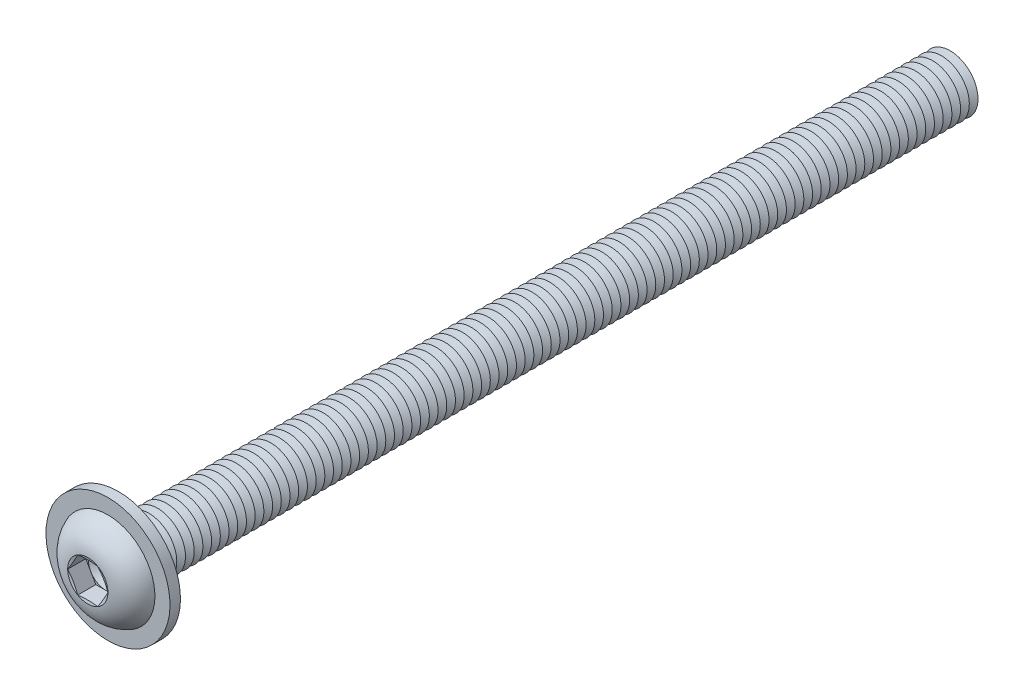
ISO-10303-21;
HEADER;
FILE_DESCRIPTION(('STEP AP214'),'2;1');
FILE_NAME('part.step','',(''),(''),'','','');
FILE_SCHEMA(('AUTOMOTIVE_DESIGN { 1 0 10303 214 1 1 1 1 }'));
ENDSEC;
DATA;
#1=APPLICATION_CONTEXT('core data for automotive mechanical design processes');
#2=APPLICATION_PROTOCOL_DEFINITION('international standard','automotive_design',2000,#1);
#3=PRODUCT_CONTEXT('',#1,'mechanical');
#4=PRODUCT('Part','Part','',(#3));
#5=PRODUCT_RELATED_PRODUCT_CATEGORY('part','',(#4));
#6=PRODUCT_DEFINITION_FORMATION('','',#4);
#7=PRODUCT_DEFINITION_CONTEXT('part definition',#1,'design');
#8=PRODUCT_DEFINITION('design','',#6,#7);
#9=PRODUCT_DEFINITION_SHAPE('','',#8);
#10=(LENGTH_UNIT() NAMED_UNIT(*) SI_UNIT(.MILLI.,.METRE.));
#11=(NAMED_UNIT(*) PLANE_ANGLE_UNIT() SI_UNIT($,.RADIAN.));
#12=(NAMED_UNIT(*) SI_UNIT($,.STERADIAN.) SOLID_ANGLE_UNIT());
#13=UNCERTAINTY_MEASURE_WITH_UNIT(LENGTH_MEASURE(1.E-05),#10,'distance_accuracy_value','');
#14=(GEOMETRIC_REPRESENTATION_CONTEXT(3) GLOBAL_UNCERTAINTY_ASSIGNED_CONTEXT((#13)) GLOBAL_UNIT_ASSIGNED_CONTEXT((#10,
#11,#12)) REPRESENTATION_CONTEXT('',''));
#15=CARTESIAN_POINT('',(0.,0.,0.));
#16=DIRECTION('',(0.,0.,1.));
#17=DIRECTION('',(1.,0.,0.));
#18=AXIS2_PLACEMENT_3D('',#15,#16,#17);
#19=CARTESIAN_POINT('',(0.,0.,-115.625));
#20=DIRECTION('',(0.,0.,1.));
#21=DIRECTION('',(0.,-1.,0.));
#22=AXIS2_PLACEMENT_3D('',#19,#20,#21);
#23=CONICAL_SURFACE('',#22,3.99999999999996,1.0471975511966);
#24=CARTESIAN_POINT('',(0.,0.,-116.25));
#25=DIRECTION('',(0.,0.,1.));
#26=DIRECTION('',(0.,-1.,0.));
#27=AXIS2_PLACEMENT_3D('',#24,#25,#26);
#28=CIRCLE('',#27,2.91746824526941);
#29=CARTESIAN_POINT('',(0.,-2.91746824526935,-116.25));
#30=VERTEX_POINT('',#29);
#31=EDGE_CURVE('E977',#30,#30,#28,.T.);
#32=ORIENTED_EDGE('',*,*,#31,.T.);
#33=EDGE_LOOP('',(#32));
#34=FACE_BOUND('',#33,.T.);
#35=CARTESIAN_POINT('',(0.,0.,-115.625));
#36=DIRECTION('',(0.,0.,1.));
#37=DIRECTION('',(0.,-1.,0.));
#38=AXIS2_PLACEMENT_3D('',#35,#36,#37);
#39=CIRCLE('',#38,3.99999999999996);
#40=CARTESIAN_POINT('',(0.,-3.9999999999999,-115.625));
#41=VERTEX_POINT('',#40);
#42=EDGE_CURVE('E973',#41,#41,#39,.T.);
#43=ORIENTED_EDGE('',*,*,#42,.F.);
#44=EDGE_LOOP('',(#43));
#45=FACE_BOUND('',#44,.T.);
#46=ADVANCED_FACE('F39',(#34,#45),#23,.T.);
#47=CARTESIAN_POINT('',(0.,0.,-116.25));
#48=DIRECTION('',(0.,0.,-1.));
#49=DIRECTION('',(0.,1.,0.));
#50=AXIS2_PLACEMENT_3D('',#47,#48,#49);
#51=CONICAL_SURFACE('',#50,2.91746824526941,1.0471975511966);
#52=CARTESIAN_POINT('',(0.,0.,-116.875));
#53=DIRECTION('',(0.,0.,1.));
#54=DIRECTION('',(0.,-1.,0.));
#55=AXIS2_PLACEMENT_3D('',#52,#53,#54);
#56=CIRCLE('',#55,3.99999999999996);
#57=CARTESIAN_POINT('',(0.,-3.9999999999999,-116.875));
#58=VERTEX_POINT('',#57);
#59=EDGE_CURVE('E981',#58,#58,#56,.T.);
#60=ORIENTED_EDGE('',*,*,#59,.T.);
#61=EDGE_LOOP('',(#60));
#62=FACE_BOUND('',#61,.T.);
#63=ORIENTED_EDGE('',*,*,#31,.F.);
#64=EDGE_LOOP('',(#63));
#65=FACE_BOUND('',#64,.T.);
#66=ADVANCED_FACE('F1098',(#62,#65),#51,.T.);
#67=CARTESIAN_POINT('',(0.,3.99999999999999,-120.));
#68=DIRECTION('',(0.,0.,-1.));
#69=DIRECTION('',(0.,1.,0.));
#70=AXIS2_PLACEMENT_3D('',#67,#68,#69);
#71=PLANE('',#70);
#72=CARTESIAN_POINT('',(0.,0.,-120.));
#73=DIRECTION('',(0.,0.,1.));
#74=DIRECTION('',(0.,-1.,0.));
#75=AXIS2_PLACEMENT_3D('',#72,#73,#74);
#76=CIRCLE('',#75,2.91746824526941);
#77=CARTESIAN_POINT('',(0.,-2.91746824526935,-120.));
#78=VERTEX_POINT('',#77);
#79=EDGE_CURVE('E1001',#78,#78,#76,.T.);
#80=ORIENTED_EDGE('',*,*,#79,.F.);
#81=EDGE_LOOP('',(#80));
#82=FACE_BOUND('',#81,.T.);
#83=ADVANCED_FACE('F1104',(#82),#71,.T.);
#84=CARTESIAN_POINT('',(0.,0.,-119.375));
#85=DIRECTION('',(0.,0.,1.));
#86=DIRECTION('',(0.,-1.,0.));
#87=AXIS2_PLACEMENT_3D('',#84,#85,#86);
#88=CONICAL_SURFACE('',#87,3.99999999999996,1.0471975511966);
#89=ORIENTED_EDGE('',*,*,#79,.T.);
#90=EDGE_LOOP('',(#89));
#91=FACE_BOUND('',#90,.T.);
#92=CARTESIAN_POINT('',(0.,0.,-119.375));
#93=DIRECTION('',(0.,0.,1.));
#94=DIRECTION('',(0.,-1.,0.));
#95=AXIS2_PLACEMENT_3D('',#92,#93,#94);
#96=CIRCLE('',#95,3.99999999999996);
#97=CARTESIAN_POINT('',(0.,-3.9999999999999,-119.375));
#98=VERTEX_POINT('',#97);
#99=EDGE_CURVE('E997',#98,#98,#96,.T.);
#100=ORIENTED_EDGE('',*,*,#99,.F.);
#101=EDGE_LOOP('',(#100));
#102=FACE_BOUND('',#101,.T.);
#103=ADVANCED_FACE('F1123',(#91,#102),#88,.T.);
#104=CARTESIAN_POINT('',(0.,0.,-118.75));
#105=DIRECTION('',(0.,0.,-1.));
#106=DIRECTION('',(0.,1.,0.));
#107=AXIS2_PLACEMENT_3D('',#104,#105,#106);
#108=CONICAL_SURFACE('',#107,2.91746824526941,1.0471975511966);
#109=ORIENTED_EDGE('',*,*,#99,.T.);
#110=EDGE_LOOP('',(#109));
#111=FACE_BOUND('',#110,.T.);
#112=CARTESIAN_POINT('',(0.,0.,-118.75));
#113=DIRECTION('',(0.,0.,1.));
#114=DIRECTION('',(0.,-1.,0.));
#115=AXIS2_PLACEMENT_3D('',#112,#113,#114);
#116=CIRCLE('',#115,2.91746824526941);
#117=CARTESIAN_POINT('',(0.,-2.91746824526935,-118.75));
#118=VERTEX_POINT('',#117);
#119=EDGE_CURVE('E993',#118,#118,#116,.T.);
#120=ORIENTED_EDGE('',*,*,#119,.F.);
#121=EDGE_LOOP('',(#120));
#122=FACE_BOUND('',#121,.T.);
#123=ADVANCED_FACE('F1120',(#111,#122),#108,.T.);
#124=CARTESIAN_POINT('',(0.,0.,-118.125));
#125=DIRECTION('',(0.,0.,1.));
#126=DIRECTION('',(0.,-1.,0.));
#127=AXIS2_PLACEMENT_3D('',#124,#125,#126);
#128=CONICAL_SURFACE('',#127,3.99999999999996,1.0471975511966);
#129=ORIENTED_EDGE('',*,*,#119,.T.);
#130=EDGE_LOOP('',(#129));
#131=FACE_BOUND('',#130,.T.);
#132=CARTESIAN_POINT('',(0.,0.,-118.125));
#133=DIRECTION('',(0.,0.,1.));
#134=DIRECTION('',(0.,-1.,0.));
#135=AXIS2_PLACEMENT_3D('',#132,#133,#134);
#136=CIRCLE('',#135,3.99999999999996);
#137=CARTESIAN_POINT('',(0.,-3.9999999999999,-118.125));
#138=VERTEX_POINT('',#137);
#139=EDGE_CURVE('E989',#138,#138,#136,.T.);
#140=ORIENTED_EDGE('',*,*,#139,.F.);
#141=EDGE_LOOP('',(#140));
#142=FACE_BOUND('',#141,.T.);
#143=ADVANCED_FACE('F1114',(#131,#142),#128,.T.);
#144=CARTESIAN_POINT('',(0.,0.,-117.5));
#145=DIRECTION('',(0.,0.,-1.));
#146=DIRECTION('',(0.,1.,0.));
#147=AXIS2_PLACEMENT_3D('',#144,#145,#146);
#148=CONICAL_SURFACE('',#147,2.91746824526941,1.0471975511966);
#149=ORIENTED_EDGE('',*,*,#139,.T.);
#150=EDGE_LOOP('',(#149));
#151=FACE_BOUND('',#150,.T.);
#152=CARTESIAN_POINT('',(0.,0.,-117.5));
#153=DIRECTION('',(0.,0.,1.));
#154=DIRECTION('',(0.,-1.,0.));
#155=AXIS2_PLACEMENT_3D('',#152,#153,#154);
#156=CIRCLE('',#155,2.91746824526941);
#157=CARTESIAN_POINT('',(0.,-2.91746824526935,-117.5));
#158=VERTEX_POINT('',#157);
#159=EDGE_CURVE('E985',#158,#158,#156,.T.);
#160=ORIENTED_EDGE('',*,*,#159,.F.);
#161=EDGE_LOOP('',(#160));
#162=FACE_BOUND('',#161,.T.);
#163=ADVANCED_FACE('F1110',(#151,#162),#148,.T.);
#164=CARTESIAN_POINT('',(0.,0.,-116.875));
#165=DIRECTION('',(0.,0.,1.));
#166=DIRECTION('',(0.,-1.,0.));
#167=AXIS2_PLACEMENT_3D('',#164,#165,#166);
#168=CONICAL_SURFACE('',#167,3.99999999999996,1.0471975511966);
#169=ORIENTED_EDGE('',*,*,#159,.T.);
#170=EDGE_LOOP('',(#169));
#171=FACE_BOUND('',#170,.T.);
#172=ORIENTED_EDGE('',*,*,#59,.F.);
#173=EDGE_LOOP('',(#172));
#174=FACE_BOUND('',#173,.T.);
#175=ADVANCED_FACE('F1113',(#171,#174),#168,.T.);
#176=CARTESIAN_POINT('',(0.,0.,-114.375));
#177=DIRECTION('',(0.,0.,1.));
#178=DIRECTION('',(0.,-1.,0.));
#179=AXIS2_PLACEMENT_3D('',#176,#177,#178);
#180=CONICAL_SURFACE('',#179,3.99999999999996,1.0471975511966);
#181=CARTESIAN_POINT('',(0.,0.,-115.));
#182=DIRECTION('',(0.,0.,1.));
#183=DIRECTION('',(0.,-1.,0.));
#184=AXIS2_PLACEMENT_3D('',#181,#182,#183);
#185=CIRCLE('',#184,2.91746824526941);
#186=CARTESIAN_POINT('',(0.,-2.91746824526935,-115.));
#187=VERTEX_POINT('',#186);
#188=EDGE_CURVE('E969',#187,#187,#185,.T.);
#189=ORIENTED_EDGE('',*,*,#188,.T.);
#190=EDGE_LOOP('',(#189));
#191=FACE_BOUND('',#190,.T.);
#192=CARTESIAN_POINT('',(0.,0.,-114.375));
#193=DIRECTION('',(0.,0.,1.));
#194=DIRECTION('',(0.,-1.,0.));
#195=AXIS2_PLACEMENT_3D('',#192,#193,#194);
#196=CIRCLE('',#195,3.99999999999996);
#197=CARTESIAN_POINT('',(0.,-3.9999999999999,-114.375));
#198=VERTEX_POINT('',#197);
#199=EDGE_CURVE('E965',#198,#198,#196,.T.);
#200=ORIENTED_EDGE('',*,*,#199,.F.);
#201=EDGE_LOOP('',(#200));
#202=FACE_BOUND('',#201,.T.);
#203=ADVANCED_FACE('F1118',(#191,#202),#180,.T.);
#204=CARTESIAN_POINT('',(0.,0.,-115.));
#205=DIRECTION('',(0.,0.,-1.));
#206=DIRECTION('',(0.,1.,0.));
#207=AXIS2_PLACEMENT_3D('',#204,#205,#206);
#208=CONICAL_SURFACE('',#207,2.91746824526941,1.0471975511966);
#209=ORIENTED_EDGE('',*,*,#42,.T.);
#210=EDGE_LOOP('',(#209));
#211=FACE_BOUND('',#210,.T.);
#212=ORIENTED_EDGE('',*,*,#188,.F.);
#213=EDGE_LOOP('',(#212));
#214=FACE_BOUND('',#213,.T.);
#215=ADVANCED_FACE('F1169',(#211,#214),#208,.T.);
#216=CARTESIAN_POINT('',(0.,0.,-113.125));
#217=DIRECTION('',(0.,0.,1.));
#218=DIRECTION('',(0.,-1.,0.));
#219=AXIS2_PLACEMENT_3D('',#216,#217,#218);
#220=CONICAL_SURFACE('',#219,3.99999999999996,1.0471975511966);
#221=CARTESIAN_POINT('',(0.,0.,-113.75));
#222=DIRECTION('',(0.,0.,1.));
#223=DIRECTION('',(0.,-1.,0.));
#224=AXIS2_PLACEMENT_3D('',#221,#222,#223);
#225=CIRCLE('',#224,2.91746824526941);
#226=CARTESIAN_POINT('',(0.,-2.91746824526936,-113.75));
#227=VERTEX_POINT('',#226);
#228=EDGE_CURVE('E961',#227,#227,#225,.T.);
#229=ORIENTED_EDGE('',*,*,#228,.T.);
#230=EDGE_LOOP('',(#229));
#231=FACE_BOUND('',#230,.T.);
#232=CARTESIAN_POINT('',(0.,0.,-113.125));
#233=DIRECTION('',(0.,0.,1.));
#234=DIRECTION('',(0.,-1.,0.));
#235=AXIS2_PLACEMENT_3D('',#232,#233,#234);
#236=CIRCLE('',#235,3.99999999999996);
#237=CARTESIAN_POINT('',(0.,-3.9999999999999,-113.125));
#238=VERTEX_POINT('',#237);
#239=EDGE_CURVE('E957',#238,#238,#236,.T.);
#240=ORIENTED_EDGE('',*,*,#239,.F.);
#241=EDGE_LOOP('',(#240));
#242=FACE_BOUND('',#241,.T.);
#243=ADVANCED_FACE('F1175',(#231,#242),#220,.T.);
#244=CARTESIAN_POINT('',(0.,0.,-113.75));
#245=DIRECTION('',(0.,0.,-1.));
#246=DIRECTION('',(0.,1.,0.));
#247=AXIS2_PLACEMENT_3D('',#244,#245,#246);
#248=CONICAL_SURFACE('',#247,2.91746824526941,1.0471975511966);
#249=ORIENTED_EDGE('',*,*,#199,.T.);
#250=EDGE_LOOP('',(#249));
#251=FACE_BOUND('',#250,.T.);
#252=ORIENTED_EDGE('',*,*,#228,.F.);
#253=EDGE_LOOP('',(#252));
#254=FACE_BOUND('',#253,.T.);
#255=ADVANCED_FACE('F1182',(#251,#254),#248,.T.);
#256=CARTESIAN_POINT('',(0.,0.,-111.875));
#257=DIRECTION('',(0.,0.,1.));
#258=DIRECTION('',(0.,-1.,0.));
#259=AXIS2_PLACEMENT_3D('',#256,#257,#258);
#260=CONICAL_SURFACE('',#259,3.99999999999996,1.0471975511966);
#261=CARTESIAN_POINT('',(0.,0.,-112.5));
#262=DIRECTION('',(0.,0.,1.));
#263=DIRECTION('',(0.,-1.,0.));
#264=AXIS2_PLACEMENT_3D('',#261,#262,#263);
#265=CIRCLE('',#264,2.91746824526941);
#266=CARTESIAN_POINT('',(0.,-2.91746824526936,-112.5));
#267=VERTEX_POINT('',#266);
#268=EDGE_CURVE('E953',#267,#267,#265,.T.);
#269=ORIENTED_EDGE('',*,*,#268,.T.);
#270=EDGE_LOOP('',(#269));
#271=FACE_BOUND('',#270,.T.);
#272=CARTESIAN_POINT('',(0.,0.,-111.875));
#273=DIRECTION('',(0.,0.,1.));
#274=DIRECTION('',(0.,-1.,0.));
#275=AXIS2_PLACEMENT_3D('',#272,#273,#274);
#276=CIRCLE('',#275,3.99999999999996);
#277=CARTESIAN_POINT('',(0.,-3.99999999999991,-111.875));
#278=VERTEX_POINT('',#277);
#279=EDGE_CURVE('E949',#278,#278,#276,.T.);
#280=ORIENTED_EDGE('',*,*,#279,.F.);
#281=EDGE_LOOP('',(#280));
#282=FACE_BOUND('',#281,.T.);
#283=ADVANCED_FACE('F1189',(#271,#282),#260,.T.);
#284=CARTESIAN_POINT('',(0.,0.,-112.5));
#285=DIRECTION('',(0.,0.,-1.));
#286=DIRECTION('',(0.,1.,0.));
#287=AXIS2_PLACEMENT_3D('',#284,#285,#286);
#288=CONICAL_SURFACE('',#287,2.91746824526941,1.0471975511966);
#289=ORIENTED_EDGE('',*,*,#239,.T.);
#290=EDGE_LOOP('',(#289));
#291=FACE_BOUND('',#290,.T.);
#292=ORIENTED_EDGE('',*,*,#268,.F.);
#293=EDGE_LOOP('',(#292));
#294=FACE_BOUND('',#293,.T.);
#295=ADVANCED_FACE('F1196',(#291,#294),#288,.T.);
#296=CARTESIAN_POINT('',(0.,0.,-110.625));
#297=DIRECTION('',(0.,0.,1.));
#298=DIRECTION('',(0.,-1.,0.));
#299=AXIS2_PLACEMENT_3D('',#296,#297,#298);
#300=CONICAL_SURFACE('',#299,3.99999999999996,1.0471975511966);
#301=CARTESIAN_POINT('',(0.,0.,-111.25));
#302=DIRECTION('',(0.,0.,1.));
#303=DIRECTION('',(0.,-1.,0.));
#304=AXIS2_PLACEMENT_3D('',#301,#302,#303);
#305=CIRCLE('',#304,2.91746824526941);
#306=CARTESIAN_POINT('',(0.,-2.91746824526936,-111.25));
#307=VERTEX_POINT('',#306);
#308=EDGE_CURVE('E945',#307,#307,#305,.T.);
#309=ORIENTED_EDGE('',*,*,#308,.T.);
#310=EDGE_LOOP('',(#309));
#311=FACE_BOUND('',#310,.T.);
#312=CARTESIAN_POINT('',(0.,0.,-110.625));
#313=DIRECTION('',(0.,0.,1.));
#314=DIRECTION('',(0.,-1.,0.));
#315=AXIS2_PLACEMENT_3D('',#312,#313,#314);
#316=CIRCLE('',#315,3.99999999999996);
#317=CARTESIAN_POINT('',(0.,-3.99999999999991,-110.625));
#318=VERTEX_POINT('',#317);
#319=EDGE_CURVE('E941',#318,#318,#316,.T.);
#320=ORIENTED_EDGE('',*,*,#319,.F.);
#321=EDGE_LOOP('',(#320));
#322=FACE_BOUND('',#321,.T.);
#323=ADVANCED_FACE('F1203',(#311,#322),#300,.T.);
#324=CARTESIAN_POINT('',(0.,0.,-111.25));
#325=DIRECTION('',(0.,0.,-1.));
#326=DIRECTION('',(0.,1.,0.));
#327=AXIS2_PLACEMENT_3D('',#324,#325,#326);
#328=CONICAL_SURFACE('',#327,2.91746824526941,1.0471975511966);
#329=ORIENTED_EDGE('',*,*,#279,.T.);
#330=EDGE_LOOP('',(#329));
#331=FACE_BOUND('',#330,.T.);
#332=ORIENTED_EDGE('',*,*,#308,.F.);
#333=EDGE_LOOP('',(#332));
#334=FACE_BOUND('',#333,.T.);
#335=ADVANCED_FACE('F1210',(#331,#334),#328,.T.);
#336=CARTESIAN_POINT('',(0.,0.,-109.375));
#337=DIRECTION('',(0.,0.,1.));
#338=DIRECTION('',(0.,-1.,0.));
#339=AXIS2_PLACEMENT_3D('',#336,#337,#338);
#340=CONICAL_SURFACE('',#339,3.99999999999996,1.0471975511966);
#341=CARTESIAN_POINT('',(0.,0.,-110.));
#342=DIRECTION('',(0.,0.,1.));
#343=DIRECTION('',(0.,-1.,0.));
#344=AXIS2_PLACEMENT_3D('',#341,#342,#343);
#345=CIRCLE('',#344,2.91746824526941);
#346=CARTESIAN_POINT('',(0.,-2.91746824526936,-110.));
#347=VERTEX_POINT('',#346);
#348=EDGE_CURVE('E937',#347,#347,#345,.T.);
#349=ORIENTED_EDGE('',*,*,#348,.T.);
#350=EDGE_LOOP('',(#349));
#351=FACE_BOUND('',#350,.T.);
#352=CARTESIAN_POINT('',(0.,0.,-109.375));
#353=DIRECTION('',(0.,0.,1.));
#354=DIRECTION('',(0.,-1.,0.));
#355=AXIS2_PLACEMENT_3D('',#352,#353,#354);
#356=CIRCLE('',#355,3.99999999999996);
#357=CARTESIAN_POINT('',(0.,-3.99999999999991,-109.375));
#358=VERTEX_POINT('',#357);
#359=EDGE_CURVE('E933',#358,#358,#356,.T.);
#360=ORIENTED_EDGE('',*,*,#359,.F.);
#361=EDGE_LOOP('',(#360));
#362=FACE_BOUND('',#361,.T.);
#363=ADVANCED_FACE('F1217',(#351,#362),#340,.T.);
#364=CARTESIAN_POINT('',(0.,0.,-110.));
#365=DIRECTION('',(0.,0.,-1.));
#366=DIRECTION('',(0.,1.,0.));
#367=AXIS2_PLACEMENT_3D('',#364,#365,#366);
#368=CONICAL_SURFACE('',#367,2.91746824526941,1.0471975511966);
#369=ORIENTED_EDGE('',*,*,#319,.T.);
#370=EDGE_LOOP('',(#369));
#371=FACE_BOUND('',#370,.T.);
#372=ORIENTED_EDGE('',*,*,#348,.F.);
#373=EDGE_LOOP('',(#372));
#374=FACE_BOUND('',#373,.T.);
#375=ADVANCED_FACE('F1224',(#371,#374),#368,.T.);
#376=CARTESIAN_POINT('',(0.,0.,-108.125));
#377=DIRECTION('',(0.,0.,1.));
#378=DIRECTION('',(0.,-1.,0.));
#379=AXIS2_PLACEMENT_3D('',#376,#377,#378);
#380=CONICAL_SURFACE('',#379,3.99999999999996,1.0471975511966);
#381=CARTESIAN_POINT('',(0.,0.,-108.75));
#382=DIRECTION('',(0.,0.,1.));
#383=DIRECTION('',(0.,-1.,0.));
#384=AXIS2_PLACEMENT_3D('',#381,#382,#383);
#385=CIRCLE('',#384,2.91746824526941);
#386=CARTESIAN_POINT('',(0.,-2.91746824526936,-108.75));
#387=VERTEX_POINT('',#386);
#388=EDGE_CURVE('E929',#387,#387,#385,.T.);
#389=ORIENTED_EDGE('',*,*,#388,.T.);
#390=EDGE_LOOP('',(#389));
#391=FACE_BOUND('',#390,.T.);
#392=CARTESIAN_POINT('',(0.,0.,-108.125));
#393=DIRECTION('',(0.,0.,1.));
#394=DIRECTION('',(0.,-1.,0.));
#395=AXIS2_PLACEMENT_3D('',#392,#393,#394);
#396=CIRCLE('',#395,3.99999999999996);
#397=CARTESIAN_POINT('',(0.,-3.99999999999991,-108.125));
#398=VERTEX_POINT('',#397);
#399=EDGE_CURVE('E925',#398,#398,#396,.T.);
#400=ORIENTED_EDGE('',*,*,#399,.F.);
#401=EDGE_LOOP('',(#400));
#402=FACE_BOUND('',#401,.T.);
#403=ADVANCED_FACE('F1231',(#391,#402),#380,.T.);
#404=CARTESIAN_POINT('',(0.,0.,-108.75));
#405=DIRECTION('',(0.,0.,-1.));
#406=DIRECTION('',(0.,1.,0.));
#407=AXIS2_PLACEMENT_3D('',#404,#405,#406);
#408=CONICAL_SURFACE('',#407,2.91746824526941,1.0471975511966);
#409=ORIENTED_EDGE('',*,*,#359,.T.);
#410=EDGE_LOOP('',(#409));
#411=FACE_BOUND('',#410,.T.);
#412=ORIENTED_EDGE('',*,*,#388,.F.);
#413=EDGE_LOOP('',(#412));
#414=FACE_BOUND('',#413,.T.);
#415=ADVANCED_FACE('F1238',(#411,#414),#408,.T.);
#416=CARTESIAN_POINT('',(0.,0.,-106.875));
#417=DIRECTION('',(0.,0.,1.));
#418=DIRECTION('',(0.,-1.,0.));
#419=AXIS2_PLACEMENT_3D('',#416,#417,#418);
#420=CONICAL_SURFACE('',#419,3.99999999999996,1.0471975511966);
#421=CARTESIAN_POINT('',(0.,0.,-107.5));
#422=DIRECTION('',(0.,0.,1.));
#423=DIRECTION('',(0.,-1.,0.));
#424=AXIS2_PLACEMENT_3D('',#421,#422,#423);
#425=CIRCLE('',#424,2.91746824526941);
#426=CARTESIAN_POINT('',(0.,-2.91746824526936,-107.5));
#427=VERTEX_POINT('',#426);
#428=EDGE_CURVE('E921',#427,#427,#425,.T.);
#429=ORIENTED_EDGE('',*,*,#428,.T.);
#430=EDGE_LOOP('',(#429));
#431=FACE_BOUND('',#430,.T.);
#432=CARTESIAN_POINT('',(0.,0.,-106.875));
#433=DIRECTION('',(0.,0.,1.));
#434=DIRECTION('',(0.,-1.,0.));
#435=AXIS2_PLACEMENT_3D('',#432,#433,#434);
#436=CIRCLE('',#435,3.99999999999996);
#437=CARTESIAN_POINT('',(0.,-3.99999999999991,-106.875));
#438=VERTEX_POINT('',#437);
#439=EDGE_CURVE('E917',#438,#438,#436,.T.);
#440=ORIENTED_EDGE('',*,*,#439,.F.);
#441=EDGE_LOOP('',(#440));
#442=FACE_BOUND('',#441,.T.);
#443=ADVANCED_FACE('F1245',(#431,#442),#420,.T.);
#444=CARTESIAN_POINT('',(0.,0.,-107.5));
#445=DIRECTION('',(0.,0.,-1.));
#446=DIRECTION('',(0.,1.,0.));
#447=AXIS2_PLACEMENT_3D('',#444,#445,#446);
#448=CONICAL_SURFACE('',#447,2.91746824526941,1.0471975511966);
#449=ORIENTED_EDGE('',*,*,#399,.T.);
#450=EDGE_LOOP('',(#449));
#451=FACE_BOUND('',#450,.T.);
#452=ORIENTED_EDGE('',*,*,#428,.F.);
#453=EDGE_LOOP('',(#452));
#454=FACE_BOUND('',#453,.T.);
#455=ADVANCED_FACE('F1252',(#451,#454),#448,.T.);
#456=CARTESIAN_POINT('',(0.,0.,-105.625));
#457=DIRECTION('',(0.,0.,1.));
#458=DIRECTION('',(0.,-1.,0.));
#459=AXIS2_PLACEMENT_3D('',#456,#457,#458);
#460=CONICAL_SURFACE('',#459,3.99999999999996,1.0471975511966);
#461=CARTESIAN_POINT('',(0.,0.,-106.25));
#462=DIRECTION('',(0.,0.,1.));
#463=DIRECTION('',(0.,-1.,0.));
#464=AXIS2_PLACEMENT_3D('',#461,#462,#463);
#465=CIRCLE('',#464,2.91746824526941);
#466=CARTESIAN_POINT('',(0.,-2.91746824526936,-106.25));
#467=VERTEX_POINT('',#466);
#468=EDGE_CURVE('E913',#467,#467,#465,.T.);
#469=ORIENTED_EDGE('',*,*,#468,.T.);
#470=EDGE_LOOP('',(#469));
#471=FACE_BOUND('',#470,.T.);
#472=CARTESIAN_POINT('',(0.,0.,-105.625));
#473=DIRECTION('',(0.,0.,1.));
#474=DIRECTION('',(0.,-1.,0.));
#475=AXIS2_PLACEMENT_3D('',#472,#473,#474);
#476=CIRCLE('',#475,3.99999999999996);
#477=CARTESIAN_POINT('',(0.,-3.99999999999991,-105.625));
#478=VERTEX_POINT('',#477);
#479=EDGE_CURVE('E909',#478,#478,#476,.T.);
#480=ORIENTED_EDGE('',*,*,#479,.F.);
#481=EDGE_LOOP('',(#480));
#482=FACE_BOUND('',#481,.T.);
#483=ADVANCED_FACE('F1259',(#471,#482),#460,.T.);
#484=CARTESIAN_POINT('',(0.,0.,-106.25));
#485=DIRECTION('',(0.,0.,-1.));
#486=DIRECTION('',(0.,1.,0.));
#487=AXIS2_PLACEMENT_3D('',#484,#485,#486);
#488=CONICAL_SURFACE('',#487,2.91746824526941,1.0471975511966);
#489=ORIENTED_EDGE('',*,*,#439,.T.);
#490=EDGE_LOOP('',(#489));
#491=FACE_BOUND('',#490,.T.);
#492=ORIENTED_EDGE('',*,*,#468,.F.);
#493=EDGE_LOOP('',(#492));
#494=FACE_BOUND('',#493,.T.);
#495=ADVANCED_FACE('F1266',(#491,#494),#488,.T.);
#496=CARTESIAN_POINT('',(0.,0.,-104.375));
#497=DIRECTION('',(0.,0.,1.));
#498=DIRECTION('',(0.,-1.,0.));
#499=AXIS2_PLACEMENT_3D('',#496,#497,#498);
#500=CONICAL_SURFACE('',#499,3.99999999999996,1.0471975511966);
#501=CARTESIAN_POINT('',(0.,0.,-105.));
#502=DIRECTION('',(0.,0.,1.));
#503=DIRECTION('',(0.,-1.,0.));
#504=AXIS2_PLACEMENT_3D('',#501,#502,#503);
#505=CIRCLE('',#504,2.91746824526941);
#506=CARTESIAN_POINT('',(0.,-2.91746824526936,-105.));
#507=VERTEX_POINT('',#506);
#508=EDGE_CURVE('E905',#507,#507,#505,.T.);
#509=ORIENTED_EDGE('',*,*,#508,.T.);
#510=EDGE_LOOP('',(#509));
#511=FACE_BOUND('',#510,.T.);
#512=CARTESIAN_POINT('',(0.,0.,-104.375));
#513=DIRECTION('',(0.,0.,1.));
#514=DIRECTION('',(0.,-1.,0.));
#515=AXIS2_PLACEMENT_3D('',#512,#513,#514);
#516=CIRCLE('',#515,3.99999999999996);
#517=CARTESIAN_POINT('',(0.,-3.99999999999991,-104.375));
#518=VERTEX_POINT('',#517);
#519=EDGE_CURVE('E901',#518,#518,#516,.T.);
#520=ORIENTED_EDGE('',*,*,#519,.F.);
#521=EDGE_LOOP('',(#520));
#522=FACE_BOUND('',#521,.T.);
#523=ADVANCED_FACE('F1273',(#511,#522),#500,.T.);
#524=CARTESIAN_POINT('',(0.,0.,-105.));
#525=DIRECTION('',(0.,0.,-1.));
#526=DIRECTION('',(0.,1.,0.));
#527=AXIS2_PLACEMENT_3D('',#524,#525,#526);
#528=CONICAL_SURFACE('',#527,2.91746824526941,1.0471975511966);
#529=ORIENTED_EDGE('',*,*,#479,.T.);
#530=EDGE_LOOP('',(#529));
#531=FACE_BOUND('',#530,.T.);
#532=ORIENTED_EDGE('',*,*,#508,.F.);
#533=EDGE_LOOP('',(#532));
#534=FACE_BOUND('',#533,.T.);
#535=ADVANCED_FACE('F1280',(#531,#534),#528,.T.);
#536=CARTESIAN_POINT('',(0.,0.,-103.125));
#537=DIRECTION('',(0.,0.,1.));
#538=DIRECTION('',(0.,-1.,0.));
#539=AXIS2_PLACEMENT_3D('',#536,#537,#538);
#540=CONICAL_SURFACE('',#539,3.99999999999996,1.0471975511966);
#541=CARTESIAN_POINT('',(0.,0.,-103.75));
#542=DIRECTION('',(0.,0.,1.));
#543=DIRECTION('',(0.,-1.,0.));
#544=AXIS2_PLACEMENT_3D('',#541,#542,#543);
#545=CIRCLE('',#544,2.91746824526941);
#546=CARTESIAN_POINT('',(0.,-2.91746824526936,-103.75));
#547=VERTEX_POINT('',#546);
#548=EDGE_CURVE('E897',#547,#547,#545,.T.);
#549=ORIENTED_EDGE('',*,*,#548,.T.);
#550=EDGE_LOOP('',(#549));
#551=FACE_BOUND('',#550,.T.);
#552=CARTESIAN_POINT('',(0.,0.,-103.125));
#553=DIRECTION('',(0.,0.,1.));
#554=DIRECTION('',(0.,-1.,0.));
#555=AXIS2_PLACEMENT_3D('',#552,#553,#554);
#556=CIRCLE('',#555,3.99999999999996);
#557=CARTESIAN_POINT('',(0.,-3.99999999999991,-103.125));
#558=VERTEX_POINT('',#557);
#559=EDGE_CURVE('E893',#558,#558,#556,.T.);
#560=ORIENTED_EDGE('',*,*,#559,.F.);
#561=EDGE_LOOP('',(#560));
#562=FACE_BOUND('',#561,.T.);
#563=ADVANCED_FACE('F1287',(#551,#562),#540,.T.);
#564=CARTESIAN_POINT('',(0.,0.,-103.75));
#565=DIRECTION('',(0.,0.,-1.));
#566=DIRECTION('',(0.,1.,0.));
#567=AXIS2_PLACEMENT_3D('',#564,#565,#566);
#568=CONICAL_SURFACE('',#567,2.91746824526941,1.0471975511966);
#569=ORIENTED_EDGE('',*,*,#519,.T.);
#570=EDGE_LOOP('',(#569));
#571=FACE_BOUND('',#570,.T.);
#572=ORIENTED_EDGE('',*,*,#548,.F.);
#573=EDGE_LOOP('',(#572));
#574=FACE_BOUND('',#573,.T.);
#575=ADVANCED_FACE('F1294',(#571,#574),#568,.T.);
#576=CARTESIAN_POINT('',(0.,0.,-101.875));
#577=DIRECTION('',(0.,0.,1.));
#578=DIRECTION('',(0.,-1.,0.));
#579=AXIS2_PLACEMENT_3D('',#576,#577,#578);
#580=CONICAL_SURFACE('',#579,3.99999999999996,1.0471975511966);
#581=CARTESIAN_POINT('',(0.,0.,-102.5));
#582=DIRECTION('',(0.,0.,1.));
#583=DIRECTION('',(0.,-1.,0.));
#584=AXIS2_PLACEMENT_3D('',#581,#582,#583);
#585=CIRCLE('',#584,2.91746824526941);
#586=CARTESIAN_POINT('',(0.,-2.91746824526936,-102.5));
#587=VERTEX_POINT('',#586);
#588=EDGE_CURVE('E889',#587,#587,#585,.T.);
#589=ORIENTED_EDGE('',*,*,#588,.T.);
#590=EDGE_LOOP('',(#589));
#591=FACE_BOUND('',#590,.T.);
#592=CARTESIAN_POINT('',(0.,0.,-101.875));
#593=DIRECTION('',(0.,0.,1.));
#594=DIRECTION('',(0.,-1.,0.));
#595=AXIS2_PLACEMENT_3D('',#592,#593,#594);
#596=CIRCLE('',#595,3.99999999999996);
#597=CARTESIAN_POINT('',(0.,-3.99999999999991,-101.875));
#598=VERTEX_POINT('',#597);
#599=EDGE_CURVE('E885',#598,#598,#596,.T.);
#600=ORIENTED_EDGE('',*,*,#599,.F.);
#601=EDGE_LOOP('',(#600));
#602=FACE_BOUND('',#601,.T.);
#603=ADVANCED_FACE('F1301',(#591,#602),#580,.T.);
#604=CARTESIAN_POINT('',(0.,0.,-102.5));
#605=DIRECTION('',(0.,0.,-1.));
#606=DIRECTION('',(0.,1.,0.));
#607=AXIS2_PLACEMENT_3D('',#604,#605,#606);
#608=CONICAL_SURFACE('',#607,2.91746824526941,1.0471975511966);
#609=ORIENTED_EDGE('',*,*,#559,.T.);
#610=EDGE_LOOP('',(#609));
#611=FACE_BOUND('',#610,.T.);
#612=ORIENTED_EDGE('',*,*,#588,.F.);
#613=EDGE_LOOP('',(#612));
#614=FACE_BOUND('',#613,.T.);
#615=ADVANCED_FACE('F1308',(#611,#614),#608,.T.);
#616=CARTESIAN_POINT('',(0.,0.,-100.625));
#617=DIRECTION('',(0.,0.,1.));
#618=DIRECTION('',(0.,-1.,0.));
#619=AXIS2_PLACEMENT_3D('',#616,#617,#618);
#620=CONICAL_SURFACE('',#619,3.99999999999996,1.0471975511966);
#621=CARTESIAN_POINT('',(0.,0.,-101.25));
#622=DIRECTION('',(0.,0.,1.));
#623=DIRECTION('',(0.,-1.,0.));
#624=AXIS2_PLACEMENT_3D('',#621,#622,#623);
#625=CIRCLE('',#624,2.91746824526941);
#626=CARTESIAN_POINT('',(0.,-2.91746824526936,-101.25));
#627=VERTEX_POINT('',#626);
#628=EDGE_CURVE('E881',#627,#627,#625,.T.);
#629=ORIENTED_EDGE('',*,*,#628,.T.);
#630=EDGE_LOOP('',(#629));
#631=FACE_BOUND('',#630,.T.);
#632=CARTESIAN_POINT('',(0.,0.,-100.625));
#633=DIRECTION('',(0.,0.,1.));
#634=DIRECTION('',(0.,-1.,0.));
#635=AXIS2_PLACEMENT_3D('',#632,#633,#634);
#636=CIRCLE('',#635,3.99999999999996);
#637=CARTESIAN_POINT('',(0.,-3.99999999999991,-100.625));
#638=VERTEX_POINT('',#637);
#639=EDGE_CURVE('E877',#638,#638,#636,.T.);
#640=ORIENTED_EDGE('',*,*,#639,.F.);
#641=EDGE_LOOP('',(#640));
#642=FACE_BOUND('',#641,.T.);
#643=ADVANCED_FACE('F1315',(#631,#642),#620,.T.);
#644=CARTESIAN_POINT('',(0.,0.,-101.25));
#645=DIRECTION('',(0.,0.,-1.));
#646=DIRECTION('',(0.,1.,0.));
#647=AXIS2_PLACEMENT_3D('',#644,#645,#646);
#648=CONICAL_SURFACE('',#647,2.91746824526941,1.0471975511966);
#649=ORIENTED_EDGE('',*,*,#599,.T.);
#650=EDGE_LOOP('',(#649));
#651=FACE_BOUND('',#650,.T.);
#652=ORIENTED_EDGE('',*,*,#628,.F.);
#653=EDGE_LOOP('',(#652));
#654=FACE_BOUND('',#653,.T.);
#655=ADVANCED_FACE('F1322',(#651,#654),#648,.T.);
#656=CARTESIAN_POINT('',(0.,0.,-99.375));
#657=DIRECTION('',(0.,0.,1.));
#658=DIRECTION('',(0.,-1.,0.));
#659=AXIS2_PLACEMENT_3D('',#656,#657,#658);
#660=CONICAL_SURFACE('',#659,3.99999999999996,1.0471975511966);
#661=CARTESIAN_POINT('',(0.,0.,-100.));
#662=DIRECTION('',(0.,0.,1.));
#663=DIRECTION('',(0.,-1.,0.));
#664=AXIS2_PLACEMENT_3D('',#661,#662,#663);
#665=CIRCLE('',#664,2.91746824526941);
#666=CARTESIAN_POINT('',(0.,-2.91746824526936,-100.));
#667=VERTEX_POINT('',#666);
#668=EDGE_CURVE('E873',#667,#667,#665,.T.);
#669=ORIENTED_EDGE('',*,*,#668,.T.);
#670=EDGE_LOOP('',(#669));
#671=FACE_BOUND('',#670,.T.);
#672=CARTESIAN_POINT('',(0.,0.,-99.375));
#673=DIRECTION('',(0.,0.,1.));
#674=DIRECTION('',(0.,-1.,0.));
#675=AXIS2_PLACEMENT_3D('',#672,#673,#674);
#676=CIRCLE('',#675,3.99999999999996);
#677=CARTESIAN_POINT('',(0.,-3.99999999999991,-99.375));
#678=VERTEX_POINT('',#677);
#679=EDGE_CURVE('E869',#678,#678,#676,.T.);
#680=ORIENTED_EDGE('',*,*,#679,.F.);
#681=EDGE_LOOP('',(#680));
#682=FACE_BOUND('',#681,.T.);
#683=ADVANCED_FACE('F1329',(#671,#682),#660,.T.);
#684=CARTESIAN_POINT('',(0.,0.,-100.));
#685=DIRECTION('',(0.,0.,-1.));
#686=DIRECTION('',(0.,1.,0.));
#687=AXIS2_PLACEMENT_3D('',#684,#685,#686);
#688=CONICAL_SURFACE('',#687,2.91746824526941,1.0471975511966);
#689=ORIENTED_EDGE('',*,*,#639,.T.);
#690=EDGE_LOOP('',(#689));
#691=FACE_BOUND('',#690,.T.);
#692=ORIENTED_EDGE('',*,*,#668,.F.);
#693=EDGE_LOOP('',(#692));
#694=FACE_BOUND('',#693,.T.);
#695=ADVANCED_FACE('F1336',(#691,#694),#688,.T.);
#696=CARTESIAN_POINT('',(0.,0.,-98.125));
#697=DIRECTION('',(0.,0.,1.));
#698=DIRECTION('',(0.,-1.,0.));
#699=AXIS2_PLACEMENT_3D('',#696,#697,#698);
#700=CONICAL_SURFACE('',#699,3.99999999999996,1.0471975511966);
#701=CARTESIAN_POINT('',(0.,0.,-98.75));
#702=DIRECTION('',(0.,0.,1.));
#703=DIRECTION('',(0.,-1.,0.));
#704=AXIS2_PLACEMENT_3D('',#701,#702,#703);
#705=CIRCLE('',#704,2.91746824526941);
#706=CARTESIAN_POINT('',(0.,-2.91746824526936,-98.75));
#707=VERTEX_POINT('',#706);
#708=EDGE_CURVE('E865',#707,#707,#705,.T.);
#709=ORIENTED_EDGE('',*,*,#708,.T.);
#710=EDGE_LOOP('',(#709));
#711=FACE_BOUND('',#710,.T.);
#712=CARTESIAN_POINT('',(0.,0.,-98.125));
#713=DIRECTION('',(0.,0.,1.));
#714=DIRECTION('',(0.,-1.,0.));
#715=AXIS2_PLACEMENT_3D('',#712,#713,#714);
#716=CIRCLE('',#715,3.99999999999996);
#717=CARTESIAN_POINT('',(0.,-3.99999999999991,-98.125));
#718=VERTEX_POINT('',#717);
#719=EDGE_CURVE('E861',#718,#718,#716,.T.);
#720=ORIENTED_EDGE('',*,*,#719,.F.);
#721=EDGE_LOOP('',(#720));
#722=FACE_BOUND('',#721,.T.);
#723=ADVANCED_FACE('F1343',(#711,#722),#700,.T.);
#724=CARTESIAN_POINT('',(0.,0.,-98.75));
#725=DIRECTION('',(0.,0.,-1.));
#726=DIRECTION('',(0.,1.,0.));
#727=AXIS2_PLACEMENT_3D('',#724,#725,#726);
#728=CONICAL_SURFACE('',#727,2.91746824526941,1.0471975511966);
#729=ORIENTED_EDGE('',*,*,#679,.T.);
#730=EDGE_LOOP('',(#729));
#731=FACE_BOUND('',#730,.T.);
#732=ORIENTED_EDGE('',*,*,#708,.F.);
#733=EDGE_LOOP('',(#732));
#734=FACE_BOUND('',#733,.T.);
#735=ADVANCED_FACE('F1350',(#731,#734),#728,.T.);
#736=CARTESIAN_POINT('',(0.,0.,-96.875));
#737=DIRECTION('',(0.,0.,1.));
#738=DIRECTION('',(0.,-1.,0.));
#739=AXIS2_PLACEMENT_3D('',#736,#737,#738);
#740=CONICAL_SURFACE('',#739,3.99999999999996,1.0471975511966);
#741=CARTESIAN_POINT('',(0.,0.,-97.5));
#742=DIRECTION('',(0.,0.,1.));
#743=DIRECTION('',(0.,-1.,0.));
#744=AXIS2_PLACEMENT_3D('',#741,#742,#743);
#745=CIRCLE('',#744,2.91746824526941);
#746=CARTESIAN_POINT('',(0.,-2.91746824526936,-97.5));
#747=VERTEX_POINT('',#746);
#748=EDGE_CURVE('E857',#747,#747,#745,.T.);
#749=ORIENTED_EDGE('',*,*,#748,.T.);
#750=EDGE_LOOP('',(#749));
#751=FACE_BOUND('',#750,.T.);
#752=CARTESIAN_POINT('',(0.,0.,-96.875));
#753=DIRECTION('',(0.,0.,1.));
#754=DIRECTION('',(0.,-1.,0.));
#755=AXIS2_PLACEMENT_3D('',#752,#753,#754);
#756=CIRCLE('',#755,3.99999999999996);
#757=CARTESIAN_POINT('',(0.,-3.99999999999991,-96.875));
#758=VERTEX_POINT('',#757);
#759=EDGE_CURVE('E853',#758,#758,#756,.T.);
#760=ORIENTED_EDGE('',*,*,#759,.F.);
#761=EDGE_LOOP('',(#760));
#762=FACE_BOUND('',#761,.T.);
#763=ADVANCED_FACE('F1357',(#751,#762),#740,.T.);
#764=CARTESIAN_POINT('',(0.,0.,-97.5));
#765=DIRECTION('',(0.,0.,-1.));
#766=DIRECTION('',(0.,1.,0.));
#767=AXIS2_PLACEMENT_3D('',#764,#765,#766);
#768=CONICAL_SURFACE('',#767,2.91746824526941,1.0471975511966);
#769=ORIENTED_EDGE('',*,*,#719,.T.);
#770=EDGE_LOOP('',(#769));
#771=FACE_BOUND('',#770,.T.);
#772=ORIENTED_EDGE('',*,*,#748,.F.);
#773=EDGE_LOOP('',(#772));
#774=FACE_BOUND('',#773,.T.);
#775=ADVANCED_FACE('F1364',(#771,#774),#768,.T.);
#776=CARTESIAN_POINT('',(0.,0.,-95.625));
#777=DIRECTION('',(0.,0.,1.));
#778=DIRECTION('',(0.,-1.,0.));
#779=AXIS2_PLACEMENT_3D('',#776,#777,#778);
#780=CONICAL_SURFACE('',#779,3.99999999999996,1.0471975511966);
#781=CARTESIAN_POINT('',(0.,0.,-96.25));
#782=DIRECTION('',(0.,0.,1.));
#783=DIRECTION('',(0.,-1.,0.));
#784=AXIS2_PLACEMENT_3D('',#781,#782,#783);
#785=CIRCLE('',#784,2.91746824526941);
#786=CARTESIAN_POINT('',(0.,-2.91746824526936,-96.25));
#787=VERTEX_POINT('',#786);
#788=EDGE_CURVE('E849',#787,#787,#785,.T.);
#789=ORIENTED_EDGE('',*,*,#788,.T.);
#790=EDGE_LOOP('',(#789));
#791=FACE_BOUND('',#790,.T.);
#792=CARTESIAN_POINT('',(0.,0.,-95.625));
#793=DIRECTION('',(0.,0.,1.));
#794=DIRECTION('',(0.,-1.,0.));
#795=AXIS2_PLACEMENT_3D('',#792,#793,#794);
#796=CIRCLE('',#795,3.99999999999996);
#797=CARTESIAN_POINT('',(0.,-3.99999999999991,-95.625));
#798=VERTEX_POINT('',#797);
#799=EDGE_CURVE('E845',#798,#798,#796,.T.);
#800=ORIENTED_EDGE('',*,*,#799,.F.);
#801=EDGE_LOOP('',(#800));
#802=FACE_BOUND('',#801,.T.);
#803=ADVANCED_FACE('F1371',(#791,#802),#780,.T.);
#804=CARTESIAN_POINT('',(0.,0.,-96.25));
#805=DIRECTION('',(0.,0.,-1.));
#806=DIRECTION('',(0.,1.,0.));
#807=AXIS2_PLACEMENT_3D('',#804,#805,#806);
#808=CONICAL_SURFACE('',#807,2.91746824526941,1.0471975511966);
#809=ORIENTED_EDGE('',*,*,#759,.T.);
#810=EDGE_LOOP('',(#809));
#811=FACE_BOUND('',#810,.T.);
#812=ORIENTED_EDGE('',*,*,#788,.F.);
#813=EDGE_LOOP('',(#812));
#814=FACE_BOUND('',#813,.T.);
#815=ADVANCED_FACE('F1378',(#811,#814),#808,.T.);
#816=CARTESIAN_POINT('',(0.,0.,-94.375));
#817=DIRECTION('',(0.,0.,1.));
#818=DIRECTION('',(0.,-1.,0.));
#819=AXIS2_PLACEMENT_3D('',#816,#817,#818);
#820=CONICAL_SURFACE('',#819,3.99999999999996,1.0471975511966);
#821=CARTESIAN_POINT('',(0.,0.,-95.));
#822=DIRECTION('',(0.,0.,1.));
#823=DIRECTION('',(0.,-1.,0.));
#824=AXIS2_PLACEMENT_3D('',#821,#822,#823);
#825=CIRCLE('',#824,2.91746824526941);
#826=CARTESIAN_POINT('',(0.,-2.91746824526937,-95.));
#827=VERTEX_POINT('',#826);
#828=EDGE_CURVE('E841',#827,#827,#825,.T.);
#829=ORIENTED_EDGE('',*,*,#828,.T.);
#830=EDGE_LOOP('',(#829));
#831=FACE_BOUND('',#830,.T.);
#832=CARTESIAN_POINT('',(0.,0.,-94.375));
#833=DIRECTION('',(0.,0.,1.));
#834=DIRECTION('',(0.,-1.,0.));
#835=AXIS2_PLACEMENT_3D('',#832,#833,#834);
#836=CIRCLE('',#835,3.99999999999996);
#837=CARTESIAN_POINT('',(0.,-3.99999999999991,-94.375));
#838=VERTEX_POINT('',#837);
#839=EDGE_CURVE('E837',#838,#838,#836,.T.);
#840=ORIENTED_EDGE('',*,*,#839,.F.);
#841=EDGE_LOOP('',(#840));
#842=FACE_BOUND('',#841,.T.);
#843=ADVANCED_FACE('F1385',(#831,#842),#820,.T.);
#844=CARTESIAN_POINT('',(0.,0.,-95.));
#845=DIRECTION('',(0.,0.,-1.));
#846=DIRECTION('',(0.,1.,0.));
#847=AXIS2_PLACEMENT_3D('',#844,#845,#846);
#848=CONICAL_SURFACE('',#847,2.91746824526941,1.0471975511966);
#849=ORIENTED_EDGE('',*,*,#799,.T.);
#850=EDGE_LOOP('',(#849));
#851=FACE_BOUND('',#850,.T.);
#852=ORIENTED_EDGE('',*,*,#828,.F.);
#853=EDGE_LOOP('',(#852));
#854=FACE_BOUND('',#853,.T.);
#855=ADVANCED_FACE('F1392',(#851,#854),#848,.T.);
#856=CARTESIAN_POINT('',(0.,0.,-93.125));
#857=DIRECTION('',(0.,0.,1.));
#858=DIRECTION('',(0.,-1.,0.));
#859=AXIS2_PLACEMENT_3D('',#856,#857,#858);
#860=CONICAL_SURFACE('',#859,3.99999999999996,1.0471975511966);
#861=CARTESIAN_POINT('',(0.,0.,-93.75));
#862=DIRECTION('',(0.,0.,1.));
#863=DIRECTION('',(0.,-1.,0.));
#864=AXIS2_PLACEMENT_3D('',#861,#862,#863);
#865=CIRCLE('',#864,2.91746824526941);
#866=CARTESIAN_POINT('',(0.,-2.91746824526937,-93.75));
#867=VERTEX_POINT('',#866);
#868=EDGE_CURVE('E833',#867,#867,#865,.T.);
#869=ORIENTED_EDGE('',*,*,#868,.T.);
#870=EDGE_LOOP('',(#869));
#871=FACE_BOUND('',#870,.T.);
#872=CARTESIAN_POINT('',(0.,0.,-93.125));
#873=DIRECTION('',(0.,0.,1.));
#874=DIRECTION('',(0.,-1.,0.));
#875=AXIS2_PLACEMENT_3D('',#872,#873,#874);
#876=CIRCLE('',#875,3.99999999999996);
#877=CARTESIAN_POINT('',(0.,-3.99999999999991,-93.125));
#878=VERTEX_POINT('',#877);
#879=EDGE_CURVE('E829',#878,#878,#876,.T.);
#880=ORIENTED_EDGE('',*,*,#879,.F.);
#881=EDGE_LOOP('',(#880));
#882=FACE_BOUND('',#881,.T.);
#883=ADVANCED_FACE('F1399',(#871,#882),#860,.T.);
#884=CARTESIAN_POINT('',(0.,0.,-93.75));
#885=DIRECTION('',(0.,0.,-1.));
#886=DIRECTION('',(0.,1.,0.));
#887=AXIS2_PLACEMENT_3D('',#884,#885,#886);
#888=CONICAL_SURFACE('',#887,2.91746824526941,1.0471975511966);
#889=ORIENTED_EDGE('',*,*,#839,.T.);
#890=EDGE_LOOP('',(#889));
#891=FACE_BOUND('',#890,.T.);
#892=ORIENTED_EDGE('',*,*,#868,.F.);
#893=EDGE_LOOP('',(#892));
#894=FACE_BOUND('',#893,.T.);
#895=ADVANCED_FACE('F1406',(#891,#894),#888,.T.);
#896=CARTESIAN_POINT('',(0.,0.,-91.875));
#897=DIRECTION('',(0.,0.,1.));
#898=DIRECTION('',(0.,-1.,0.));
#899=AXIS2_PLACEMENT_3D('',#896,#897,#898);
#900=CONICAL_SURFACE('',#899,3.99999999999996,1.0471975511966);
#901=CARTESIAN_POINT('',(0.,0.,-92.5));
#902=DIRECTION('',(0.,0.,1.));
#903=DIRECTION('',(0.,-1.,0.));
#904=AXIS2_PLACEMENT_3D('',#901,#902,#903);
#905=CIRCLE('',#904,2.91746824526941);
#906=CARTESIAN_POINT('',(0.,-2.91746824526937,-92.5));
#907=VERTEX_POINT('',#906);
#908=EDGE_CURVE('E825',#907,#907,#905,.T.);
#909=ORIENTED_EDGE('',*,*,#908,.T.);
#910=EDGE_LOOP('',(#909));
#911=FACE_BOUND('',#910,.T.);
#912=CARTESIAN_POINT('',(0.,0.,-91.875));
#913=DIRECTION('',(0.,0.,1.));
#914=DIRECTION('',(0.,-1.,0.));
#915=AXIS2_PLACEMENT_3D('',#912,#913,#914);
#916=CIRCLE('',#915,3.99999999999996);
#917=CARTESIAN_POINT('',(0.,-3.99999999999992,-91.875));
#918=VERTEX_POINT('',#917);
#919=EDGE_CURVE('E821',#918,#918,#916,.T.);
#920=ORIENTED_EDGE('',*,*,#919,.F.);
#921=EDGE_LOOP('',(#920));
#922=FACE_BOUND('',#921,.T.);
#923=ADVANCED_FACE('F1413',(#911,#922),#900,.T.);
#924=CARTESIAN_POINT('',(0.,0.,-92.5));
#925=DIRECTION('',(0.,0.,-1.));
#926=DIRECTION('',(0.,1.,0.));
#927=AXIS2_PLACEMENT_3D('',#924,#925,#926);
#928=CONICAL_SURFACE('',#927,2.91746824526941,1.0471975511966);
#929=ORIENTED_EDGE('',*,*,#879,.T.);
#930=EDGE_LOOP('',(#929));
#931=FACE_BOUND('',#930,.T.);
#932=ORIENTED_EDGE('',*,*,#908,.F.);
#933=EDGE_LOOP('',(#932));
#934=FACE_BOUND('',#933,.T.);
#935=ADVANCED_FACE('F1420',(#931,#934),#928,.T.);
#936=CARTESIAN_POINT('',(0.,0.,-90.625));
#937=DIRECTION('',(0.,0.,1.));
#938=DIRECTION('',(0.,-1.,0.));
#939=AXIS2_PLACEMENT_3D('',#936,#937,#938);
#940=CONICAL_SURFACE('',#939,3.99999999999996,1.0471975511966);
#941=CARTESIAN_POINT('',(0.,0.,-91.25));
#942=DIRECTION('',(0.,0.,1.));
#943=DIRECTION('',(0.,-1.,0.));
#944=AXIS2_PLACEMENT_3D('',#941,#942,#943);
#945=CIRCLE('',#944,2.91746824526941);
#946=CARTESIAN_POINT('',(0.,-2.91746824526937,-91.25));
#947=VERTEX_POINT('',#946);
#948=EDGE_CURVE('E817',#947,#947,#945,.T.);
#949=ORIENTED_EDGE('',*,*,#948,.T.);
#950=EDGE_LOOP('',(#949));
#951=FACE_BOUND('',#950,.T.);
#952=CARTESIAN_POINT('',(0.,0.,-90.625));
#953=DIRECTION('',(0.,0.,1.));
#954=DIRECTION('',(0.,-1.,0.));
#955=AXIS2_PLACEMENT_3D('',#952,#953,#954);
#956=CIRCLE('',#955,3.99999999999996);
#957=CARTESIAN_POINT('',(0.,-3.99999999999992,-90.625));
#958=VERTEX_POINT('',#957);
#959=EDGE_CURVE('E813',#958,#958,#956,.T.);
#960=ORIENTED_EDGE('',*,*,#959,.F.);
#961=EDGE_LOOP('',(#960));
#962=FACE_BOUND('',#961,.T.);
#963=ADVANCED_FACE('F1427',(#951,#962),#940,.T.);
#964=CARTESIAN_POINT('',(0.,0.,-91.25));
#965=DIRECTION('',(0.,0.,-1.));
#966=DIRECTION('',(0.,1.,0.));
#967=AXIS2_PLACEMENT_3D('',#964,#965,#966);
#968=CONICAL_SURFACE('',#967,2.91746824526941,1.0471975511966);
#969=ORIENTED_EDGE('',*,*,#919,.T.);
#970=EDGE_LOOP('',(#969));
#971=FACE_BOUND('',#970,.T.);
#972=ORIENTED_EDGE('',*,*,#948,.F.);
#973=EDGE_LOOP('',(#972));
#974=FACE_BOUND('',#973,.T.);
#975=ADVANCED_FACE('F1434',(#971,#974),#968,.T.);
#976=CARTESIAN_POINT('',(0.,0.,-89.375));
#977=DIRECTION('',(0.,0.,1.));
#978=DIRECTION('',(0.,-1.,0.));
#979=AXIS2_PLACEMENT_3D('',#976,#977,#978);
#980=CONICAL_SURFACE('',#979,3.99999999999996,1.0471975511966);
#981=CARTESIAN_POINT('',(0.,0.,-90.));
#982=DIRECTION('',(0.,0.,1.));
#983=DIRECTION('',(0.,-1.,0.));
#984=AXIS2_PLACEMENT_3D('',#981,#982,#983);
#985=CIRCLE('',#984,2.91746824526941);
#986=CARTESIAN_POINT('',(0.,-2.91746824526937,-90.));
#987=VERTEX_POINT('',#986);
#988=EDGE_CURVE('E809',#987,#987,#985,.T.);
#989=ORIENTED_EDGE('',*,*,#988,.T.);
#990=EDGE_LOOP('',(#989));
#991=FACE_BOUND('',#990,.T.);
#992=CARTESIAN_POINT('',(0.,0.,-89.375));
#993=DIRECTION('',(0.,0.,1.));
#994=DIRECTION('',(0.,-1.,0.));
#995=AXIS2_PLACEMENT_3D('',#992,#993,#994);
#996=CIRCLE('',#995,3.99999999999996);
#997=CARTESIAN_POINT('',(0.,-3.99999999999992,-89.375));
#998=VERTEX_POINT('',#997);
#999=EDGE_CURVE('E805',#998,#998,#996,.T.);
#1000=ORIENTED_EDGE('',*,*,#999,.F.);
#1001=EDGE_LOOP('',(#1000));
#1002=FACE_BOUND('',#1001,.T.);
#1003=ADVANCED_FACE('F1441',(#991,#1002),#980,.T.);
#1004=CARTESIAN_POINT('',(0.,0.,-90.));
#1005=DIRECTION('',(0.,0.,-1.));
#1006=DIRECTION('',(0.,1.,0.));
#1007=AXIS2_PLACEMENT_3D('',#1004,#1005,#1006);
#1008=CONICAL_SURFACE('',#1007,2.91746824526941,1.0471975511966);
#1009=ORIENTED_EDGE('',*,*,#959,.T.);
#1010=EDGE_LOOP('',(#1009));
#1011=FACE_BOUND('',#1010,.T.);
#1012=ORIENTED_EDGE('',*,*,#988,.F.);
#1013=EDGE_LOOP('',(#1012));
#1014=FACE_BOUND('',#1013,.T.);
#1015=ADVANCED_FACE('F1448',(#1011,#1014),#1008,.T.);
#1016=CARTESIAN_POINT('',(0.,0.,-88.125));
#1017=DIRECTION('',(0.,0.,1.));
#1018=DIRECTION('',(0.,-1.,0.));
#1019=AXIS2_PLACEMENT_3D('',#1016,#1017,#1018);
#1020=CONICAL_SURFACE('',#1019,3.99999999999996,1.0471975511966);
#1021=CARTESIAN_POINT('',(0.,0.,-88.75));
#1022=DIRECTION('',(0.,0.,1.));
#1023=DIRECTION('',(0.,-1.,0.));
#1024=AXIS2_PLACEMENT_3D('',#1021,#1022,#1023);
#1025=CIRCLE('',#1024,2.91746824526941);
#1026=CARTESIAN_POINT('',(0.,-2.91746824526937,-88.75));
#1027=VERTEX_POINT('',#1026);
#1028=EDGE_CURVE('E801',#1027,#1027,#1025,.T.);
#1029=ORIENTED_EDGE('',*,*,#1028,.T.);
#1030=EDGE_LOOP('',(#1029));
#1031=FACE_BOUND('',#1030,.T.);
#1032=CARTESIAN_POINT('',(0.,0.,-88.125));
#1033=DIRECTION('',(0.,0.,1.));
#1034=DIRECTION('',(0.,-1.,0.));
#1035=AXIS2_PLACEMENT_3D('',#1032,#1033,#1034);
#1036=CIRCLE('',#1035,3.99999999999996);
#1037=CARTESIAN_POINT('',(0.,-3.99999999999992,-88.125));
#1038=VERTEX_POINT('',#1037);
#1039=EDGE_CURVE('E797',#1038,#1038,#1036,.T.);
#1040=ORIENTED_EDGE('',*,*,#1039,.F.);
#1041=EDGE_LOOP('',(#1040));
#1042=FACE_BOUND('',#1041,.T.);
#1043=ADVANCED_FACE('F1455',(#1031,#1042),#1020,.T.);
#1044=CARTESIAN_POINT('',(0.,0.,-88.75));
#1045=DIRECTION('',(0.,0.,-1.));
#1046=DIRECTION('',(0.,1.,0.));
#1047=AXIS2_PLACEMENT_3D('',#1044,#1045,#1046);
#1048=CONICAL_SURFACE('',#1047,2.91746824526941,1.0471975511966);
#1049=ORIENTED_EDGE('',*,*,#999,.T.);
#1050=EDGE_LOOP('',(#1049));
#1051=FACE_BOUND('',#1050,.T.);
#1052=ORIENTED_EDGE('',*,*,#1028,.F.);
#1053=EDGE_LOOP('',(#1052));
#1054=FACE_BOUND('',#1053,.T.);
#1055=ADVANCED_FACE('F1462',(#1051,#1054),#1048,.T.);
#1056=CARTESIAN_POINT('',(0.,0.,-86.875));
#1057=DIRECTION('',(0.,0.,1.));
#1058=DIRECTION('',(0.,-1.,0.));
#1059=AXIS2_PLACEMENT_3D('',#1056,#1057,#1058);
#1060=CONICAL_SURFACE('',#1059,3.99999999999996,1.0471975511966);
#1061=CARTESIAN_POINT('',(0.,0.,-87.5));
#1062=DIRECTION('',(0.,0.,1.));
#1063=DIRECTION('',(0.,-1.,0.));
#1064=AXIS2_PLACEMENT_3D('',#1061,#1062,#1063);
#1065=CIRCLE('',#1064,2.91746824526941);
#1066=CARTESIAN_POINT('',(0.,-2.91746824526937,-87.5));
#1067=VERTEX_POINT('',#1066);
#1068=EDGE_CURVE('E793',#1067,#1067,#1065,.T.);
#1069=ORIENTED_EDGE('',*,*,#1068,.T.);
#1070=EDGE_LOOP('',(#1069));
#1071=FACE_BOUND('',#1070,.T.);
#1072=CARTESIAN_POINT('',(0.,0.,-86.875));
#1073=DIRECTION('',(0.,0.,1.));
#1074=DIRECTION('',(0.,-1.,0.));
#1075=AXIS2_PLACEMENT_3D('',#1072,#1073,#1074);
#1076=CIRCLE('',#1075,3.99999999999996);
#1077=CARTESIAN_POINT('',(0.,-3.99999999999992,-86.875));
#1078=VERTEX_POINT('',#1077);
#1079=EDGE_CURVE('E789',#1078,#1078,#1076,.T.);
#1080=ORIENTED_EDGE('',*,*,#1079,.F.);
#1081=EDGE_LOOP('',(#1080));
#1082=FACE_BOUND('',#1081,.T.);
#1083=ADVANCED_FACE('F1469',(#1071,#1082),#1060,.T.);
#1084=CARTESIAN_POINT('',(0.,0.,-87.5));
#1085=DIRECTION('',(0.,0.,-1.));
#1086=DIRECTION('',(0.,1.,0.));
#1087=AXIS2_PLACEMENT_3D('',#1084,#1085,#1086);
#1088=CONICAL_SURFACE('',#1087,2.91746824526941,1.0471975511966);
#1089=ORIENTED_EDGE('',*,*,#1039,.T.);
#1090=EDGE_LOOP('',(#1089));
#1091=FACE_BOUND('',#1090,.T.);
#1092=ORIENTED_EDGE('',*,*,#1068,.F.);
#1093=EDGE_LOOP('',(#1092));
#1094=FACE_BOUND('',#1093,.T.);
#1095=ADVANCED_FACE('F1476',(#1091,#1094),#1088,.T.);
#1096=CARTESIAN_POINT('',(0.,0.,-85.625));
#1097=DIRECTION('',(0.,0.,1.));
#1098=DIRECTION('',(0.,-1.,0.));
#1099=AXIS2_PLACEMENT_3D('',#1096,#1097,#1098);
#1100=CONICAL_SURFACE('',#1099,3.99999999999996,1.0471975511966);
#1101=CARTESIAN_POINT('',(0.,0.,-86.25));
#1102=DIRECTION('',(0.,0.,1.));
#1103=DIRECTION('',(0.,-1.,0.));
#1104=AXIS2_PLACEMENT_3D('',#1101,#1102,#1103);
#1105=CIRCLE('',#1104,2.91746824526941);
#1106=CARTESIAN_POINT('',(0.,-2.91746824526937,-86.25));
#1107=VERTEX_POINT('',#1106);
#1108=EDGE_CURVE('E785',#1107,#1107,#1105,.T.);
#1109=ORIENTED_EDGE('',*,*,#1108,.T.);
#1110=EDGE_LOOP('',(#1109));
#1111=FACE_BOUND('',#1110,.T.);
#1112=CARTESIAN_POINT('',(0.,0.,-85.625));
#1113=DIRECTION('',(0.,0.,1.));
#1114=DIRECTION('',(0.,-1.,0.));
#1115=AXIS2_PLACEMENT_3D('',#1112,#1113,#1114);
#1116=CIRCLE('',#1115,3.99999999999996);
#1117=CARTESIAN_POINT('',(0.,-3.99999999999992,-85.625));
#1118=VERTEX_POINT('',#1117);
#1119=EDGE_CURVE('E781',#1118,#1118,#1116,.T.);
#1120=ORIENTED_EDGE('',*,*,#1119,.F.);
#1121=EDGE_LOOP('',(#1120));
#1122=FACE_BOUND('',#1121,.T.);
#1123=ADVANCED_FACE('F1483',(#1111,#1122),#1100,.T.);
#1124=CARTESIAN_POINT('',(0.,0.,-86.25));
#1125=DIRECTION('',(0.,0.,-1.));
#1126=DIRECTION('',(0.,1.,0.));
#1127=AXIS2_PLACEMENT_3D('',#1124,#1125,#1126);
#1128=CONICAL_SURFACE('',#1127,2.91746824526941,1.0471975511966);
#1129=ORIENTED_EDGE('',*,*,#1079,.T.);
#1130=EDGE_LOOP('',(#1129));
#1131=FACE_BOUND('',#1130,.T.);
#1132=ORIENTED_EDGE('',*,*,#1108,.F.);
#1133=EDGE_LOOP('',(#1132));
#1134=FACE_BOUND('',#1133,.T.);
#1135=ADVANCED_FACE('F1490',(#1131,#1134),#1128,.T.);
#1136=CARTESIAN_POINT('',(0.,0.,-84.375));
#1137=DIRECTION('',(0.,0.,1.));
#1138=DIRECTION('',(0.,-1.,0.));
#1139=AXIS2_PLACEMENT_3D('',#1136,#1137,#1138);
#1140=CONICAL_SURFACE('',#1139,3.99999999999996,1.0471975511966);
#1141=CARTESIAN_POINT('',(0.,0.,-85.));
#1142=DIRECTION('',(0.,0.,1.));
#1143=DIRECTION('',(0.,-1.,0.));
#1144=AXIS2_PLACEMENT_3D('',#1141,#1142,#1143);
#1145=CIRCLE('',#1144,2.91746824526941);
#1146=CARTESIAN_POINT('',(0.,-2.91746824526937,-85.));
#1147=VERTEX_POINT('',#1146);
#1148=EDGE_CURVE('E777',#1147,#1147,#1145,.T.);
#1149=ORIENTED_EDGE('',*,*,#1148,.T.);
#1150=EDGE_LOOP('',(#1149));
#1151=FACE_BOUND('',#1150,.T.);
#1152=CARTESIAN_POINT('',(0.,0.,-84.375));
#1153=DIRECTION('',(0.,0.,1.));
#1154=DIRECTION('',(0.,-1.,0.));
#1155=AXIS2_PLACEMENT_3D('',#1152,#1153,#1154);
#1156=CIRCLE('',#1155,3.99999999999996);
#1157=CARTESIAN_POINT('',(0.,-3.99999999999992,-84.375));
#1158=VERTEX_POINT('',#1157);
#1159=EDGE_CURVE('E773',#1158,#1158,#1156,.T.);
#1160=ORIENTED_EDGE('',*,*,#1159,.F.);
#1161=EDGE_LOOP('',(#1160));
#1162=FACE_BOUND('',#1161,.T.);
#1163=ADVANCED_FACE('F1497',(#1151,#1162),#1140,.T.);
#1164=CARTESIAN_POINT('',(0.,0.,-85.));
#1165=DIRECTION('',(0.,0.,-1.));
#1166=DIRECTION('',(0.,1.,0.));
#1167=AXIS2_PLACEMENT_3D('',#1164,#1165,#1166);
#1168=CONICAL_SURFACE('',#1167,2.91746824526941,1.0471975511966);
#1169=ORIENTED_EDGE('',*,*,#1119,.T.);
#1170=EDGE_LOOP('',(#1169));
#1171=FACE_BOUND('',#1170,.T.);
#1172=ORIENTED_EDGE('',*,*,#1148,.F.);
#1173=EDGE_LOOP('',(#1172));
#1174=FACE_BOUND('',#1173,.T.);
#1175=ADVANCED_FACE('F1504',(#1171,#1174),#1168,.T.);
#1176=CARTESIAN_POINT('',(0.,0.,-83.125));
#1177=DIRECTION('',(0.,0.,1.));
#1178=DIRECTION('',(0.,-1.,0.));
#1179=AXIS2_PLACEMENT_3D('',#1176,#1177,#1178);
#1180=CONICAL_SURFACE('',#1179,3.99999999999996,1.0471975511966);
#1181=CARTESIAN_POINT('',(0.,0.,-83.75));
#1182=DIRECTION('',(0.,0.,1.));
#1183=DIRECTION('',(0.,-1.,0.));
#1184=AXIS2_PLACEMENT_3D('',#1181,#1182,#1183);
#1185=CIRCLE('',#1184,2.91746824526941);
#1186=CARTESIAN_POINT('',(0.,-2.91746824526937,-83.75));
#1187=VERTEX_POINT('',#1186);
#1188=EDGE_CURVE('E769',#1187,#1187,#1185,.T.);
#1189=ORIENTED_EDGE('',*,*,#1188,.T.);
#1190=EDGE_LOOP('',(#1189));
#1191=FACE_BOUND('',#1190,.T.);
#1192=CARTESIAN_POINT('',(0.,0.,-83.125));
#1193=DIRECTION('',(0.,0.,1.));
#1194=DIRECTION('',(0.,-1.,0.));
#1195=AXIS2_PLACEMENT_3D('',#1192,#1193,#1194);
#1196=CIRCLE('',#1195,3.99999999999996);
#1197=CARTESIAN_POINT('',(0.,-3.99999999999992,-83.125));
#1198=VERTEX_POINT('',#1197);
#1199=EDGE_CURVE('E765',#1198,#1198,#1196,.T.);
#1200=ORIENTED_EDGE('',*,*,#1199,.F.);
#1201=EDGE_LOOP('',(#1200));
#1202=FACE_BOUND('',#1201,.T.);
#1203=ADVANCED_FACE('F1511',(#1191,#1202),#1180,.T.);
#1204=CARTESIAN_POINT('',(0.,0.,-83.75));
#1205=DIRECTION('',(0.,0.,-1.));
#1206=DIRECTION('',(0.,1.,0.));
#1207=AXIS2_PLACEMENT_3D('',#1204,#1205,#1206);
#1208=CONICAL_SURFACE('',#1207,2.91746824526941,1.0471975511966);
#1209=ORIENTED_EDGE('',*,*,#1159,.T.);
#1210=EDGE_LOOP('',(#1209));
#1211=FACE_BOUND('',#1210,.T.);
#1212=ORIENTED_EDGE('',*,*,#1188,.F.);
#1213=EDGE_LOOP('',(#1212));
#1214=FACE_BOUND('',#1213,.T.);
#1215=ADVANCED_FACE('F1518',(#1211,#1214),#1208,.T.);
#1216=CARTESIAN_POINT('',(0.,0.,-81.875));
#1217=DIRECTION('',(0.,0.,1.));
#1218=DIRECTION('',(0.,-1.,0.));
#1219=AXIS2_PLACEMENT_3D('',#1216,#1217,#1218);
#1220=CONICAL_SURFACE('',#1219,3.99999999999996,1.0471975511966);
#1221=CARTESIAN_POINT('',(0.,0.,-82.5));
#1222=DIRECTION('',(0.,0.,1.));
#1223=DIRECTION('',(0.,-1.,0.));
#1224=AXIS2_PLACEMENT_3D('',#1221,#1222,#1223);
#1225=CIRCLE('',#1224,2.91746824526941);
#1226=CARTESIAN_POINT('',(0.,-2.91746824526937,-82.5));
#1227=VERTEX_POINT('',#1226);
#1228=EDGE_CURVE('E761',#1227,#1227,#1225,.T.);
#1229=ORIENTED_EDGE('',*,*,#1228,.T.);
#1230=EDGE_LOOP('',(#1229));
#1231=FACE_BOUND('',#1230,.T.);
#1232=CARTESIAN_POINT('',(0.,0.,-81.875));
#1233=DIRECTION('',(0.,0.,1.));
#1234=DIRECTION('',(0.,-1.,0.));
#1235=AXIS2_PLACEMENT_3D('',#1232,#1233,#1234);
#1236=CIRCLE('',#1235,3.99999999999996);
#1237=CARTESIAN_POINT('',(0.,-3.99999999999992,-81.875));
#1238=VERTEX_POINT('',#1237);
#1239=EDGE_CURVE('E757',#1238,#1238,#1236,.T.);
#1240=ORIENTED_EDGE('',*,*,#1239,.F.);
#1241=EDGE_LOOP('',(#1240));
#1242=FACE_BOUND('',#1241,.T.);
#1243=ADVANCED_FACE('F1525',(#1231,#1242),#1220,.T.);
#1244=CARTESIAN_POINT('',(0.,0.,-82.5));
#1245=DIRECTION('',(0.,0.,-1.));
#1246=DIRECTION('',(0.,1.,0.));
#1247=AXIS2_PLACEMENT_3D('',#1244,#1245,#1246);
#1248=CONICAL_SURFACE('',#1247,2.91746824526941,1.0471975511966);
#1249=ORIENTED_EDGE('',*,*,#1199,.T.);
#1250=EDGE_LOOP('',(#1249));
#1251=FACE_BOUND('',#1250,.T.);
#1252=ORIENTED_EDGE('',*,*,#1228,.F.);
#1253=EDGE_LOOP('',(#1252));
#1254=FACE_BOUND('',#1253,.T.);
#1255=ADVANCED_FACE('F1532',(#1251,#1254),#1248,.T.);
#1256=CARTESIAN_POINT('',(0.,0.,-80.625));
#1257=DIRECTION('',(0.,0.,1.));
#1258=DIRECTION('',(0.,-1.,0.));
#1259=AXIS2_PLACEMENT_3D('',#1256,#1257,#1258);
#1260=CONICAL_SURFACE('',#1259,3.99999999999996,1.0471975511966);
#1261=CARTESIAN_POINT('',(0.,0.,-81.25));
#1262=DIRECTION('',(0.,0.,1.));
#1263=DIRECTION('',(0.,-1.,0.));
#1264=AXIS2_PLACEMENT_3D('',#1261,#1262,#1263);
#1265=CIRCLE('',#1264,2.91746824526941);
#1266=CARTESIAN_POINT('',(0.,-2.91746824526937,-81.25));
#1267=VERTEX_POINT('',#1266);
#1268=EDGE_CURVE('E753',#1267,#1267,#1265,.T.);
#1269=ORIENTED_EDGE('',*,*,#1268,.T.);
#1270=EDGE_LOOP('',(#1269));
#1271=FACE_BOUND('',#1270,.T.);
#1272=CARTESIAN_POINT('',(0.,0.,-80.625));
#1273=DIRECTION('',(0.,0.,1.));
#1274=DIRECTION('',(0.,-1.,0.));
#1275=AXIS2_PLACEMENT_3D('',#1272,#1273,#1274);
#1276=CIRCLE('',#1275,3.99999999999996);
#1277=CARTESIAN_POINT('',(0.,-3.99999999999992,-80.625));
#1278=VERTEX_POINT('',#1277);
#1279=EDGE_CURVE('E749',#1278,#1278,#1276,.T.);
#1280=ORIENTED_EDGE('',*,*,#1279,.F.);
#1281=EDGE_LOOP('',(#1280));
#1282=FACE_BOUND('',#1281,.T.);
#1283=ADVANCED_FACE('F1539',(#1271,#1282),#1260,.T.);
#1284=CARTESIAN_POINT('',(0.,0.,-81.25));
#1285=DIRECTION('',(0.,0.,-1.));
#1286=DIRECTION('',(0.,1.,0.));
#1287=AXIS2_PLACEMENT_3D('',#1284,#1285,#1286);
#1288=CONICAL_SURFACE('',#1287,2.91746824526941,1.0471975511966);
#1289=ORIENTED_EDGE('',*,*,#1239,.T.);
#1290=EDGE_LOOP('',(#1289));
#1291=FACE_BOUND('',#1290,.T.);
#1292=ORIENTED_EDGE('',*,*,#1268,.F.);
#1293=EDGE_LOOP('',(#1292));
#1294=FACE_BOUND('',#1293,.T.);
#1295=ADVANCED_FACE('F1546',(#1291,#1294),#1288,.T.);
#1296=CARTESIAN_POINT('',(0.,0.,-79.375));
#1297=DIRECTION('',(0.,0.,1.));
#1298=DIRECTION('',(0.,-1.,0.));
#1299=AXIS2_PLACEMENT_3D('',#1296,#1297,#1298);
#1300=CONICAL_SURFACE('',#1299,3.99999999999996,1.0471975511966);
#1301=CARTESIAN_POINT('',(0.,0.,-80.));
#1302=DIRECTION('',(0.,0.,1.));
#1303=DIRECTION('',(0.,-1.,0.));
#1304=AXIS2_PLACEMENT_3D('',#1301,#1302,#1303);
#1305=CIRCLE('',#1304,2.91746824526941);
#1306=CARTESIAN_POINT('',(0.,-2.91746824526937,-80.));
#1307=VERTEX_POINT('',#1306);
#1308=EDGE_CURVE('E745',#1307,#1307,#1305,.T.);
#1309=ORIENTED_EDGE('',*,*,#1308,.T.);
#1310=EDGE_LOOP('',(#1309));
#1311=FACE_BOUND('',#1310,.T.);
#1312=CARTESIAN_POINT('',(0.,0.,-79.375));
#1313=DIRECTION('',(0.,0.,1.));
#1314=DIRECTION('',(0.,-1.,0.));
#1315=AXIS2_PLACEMENT_3D('',#1312,#1313,#1314);
#1316=CIRCLE('',#1315,3.99999999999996);
#1317=CARTESIAN_POINT('',(0.,-3.99999999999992,-79.375));
#1318=VERTEX_POINT('',#1317);
#1319=EDGE_CURVE('E741',#1318,#1318,#1316,.T.);
#1320=ORIENTED_EDGE('',*,*,#1319,.F.);
#1321=EDGE_LOOP('',(#1320));
#1322=FACE_BOUND('',#1321,.T.);
#1323=ADVANCED_FACE('F1553',(#1311,#1322),#1300,.T.);
#1324=CARTESIAN_POINT('',(0.,0.,-80.));
#1325=DIRECTION('',(0.,0.,-1.));
#1326=DIRECTION('',(0.,1.,0.));
#1327=AXIS2_PLACEMENT_3D('',#1324,#1325,#1326);
#1328=CONICAL_SURFACE('',#1327,2.91746824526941,1.0471975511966);
#1329=ORIENTED_EDGE('',*,*,#1279,.T.);
#1330=EDGE_LOOP('',(#1329));
#1331=FACE_BOUND('',#1330,.T.);
#1332=ORIENTED_EDGE('',*,*,#1308,.F.);
#1333=EDGE_LOOP('',(#1332));
#1334=FACE_BOUND('',#1333,.T.);
#1335=ADVANCED_FACE('F1560',(#1331,#1334),#1328,.T.);
#1336=CARTESIAN_POINT('',(0.,0.,-78.125));
#1337=DIRECTION('',(0.,0.,1.));
#1338=DIRECTION('',(0.,-1.,0.));
#1339=AXIS2_PLACEMENT_3D('',#1336,#1337,#1338);
#1340=CONICAL_SURFACE('',#1339,3.99999999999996,1.0471975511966);
#1341=CARTESIAN_POINT('',(0.,0.,-78.75));
#1342=DIRECTION('',(0.,0.,1.));
#1343=DIRECTION('',(0.,-1.,0.));
#1344=AXIS2_PLACEMENT_3D('',#1341,#1342,#1343);
#1345=CIRCLE('',#1344,2.91746824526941);
#1346=CARTESIAN_POINT('',(0.,-2.91746824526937,-78.75));
#1347=VERTEX_POINT('',#1346);
#1348=EDGE_CURVE('E737',#1347,#1347,#1345,.T.);
#1349=ORIENTED_EDGE('',*,*,#1348,.T.);
#1350=EDGE_LOOP('',(#1349));
#1351=FACE_BOUND('',#1350,.T.);
#1352=CARTESIAN_POINT('',(0.,0.,-78.125));
#1353=DIRECTION('',(0.,0.,1.));
#1354=DIRECTION('',(0.,-1.,0.));
#1355=AXIS2_PLACEMENT_3D('',#1352,#1353,#1354);
#1356=CIRCLE('',#1355,3.99999999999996);
#1357=CARTESIAN_POINT('',(0.,-3.99999999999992,-78.125));
#1358=VERTEX_POINT('',#1357);
#1359=EDGE_CURVE('E733',#1358,#1358,#1356,.T.);
#1360=ORIENTED_EDGE('',*,*,#1359,.F.);
#1361=EDGE_LOOP('',(#1360));
#1362=FACE_BOUND('',#1361,.T.);
#1363=ADVANCED_FACE('F1567',(#1351,#1362),#1340,.T.);
#1364=CARTESIAN_POINT('',(0.,0.,-78.75));
#1365=DIRECTION('',(0.,0.,-1.));
#1366=DIRECTION('',(0.,1.,0.));
#1367=AXIS2_PLACEMENT_3D('',#1364,#1365,#1366);
#1368=CONICAL_SURFACE('',#1367,2.91746824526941,1.0471975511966);
#1369=ORIENTED_EDGE('',*,*,#1319,.T.);
#1370=EDGE_LOOP('',(#1369));
#1371=FACE_BOUND('',#1370,.T.);
#1372=ORIENTED_EDGE('',*,*,#1348,.F.);
#1373=EDGE_LOOP('',(#1372));
#1374=FACE_BOUND('',#1373,.T.);
#1375=ADVANCED_FACE('F1574',(#1371,#1374),#1368,.T.);
#1376=CARTESIAN_POINT('',(0.,0.,-76.875));
#1377=DIRECTION('',(0.,0.,1.));
#1378=DIRECTION('',(0.,-1.,0.));
#1379=AXIS2_PLACEMENT_3D('',#1376,#1377,#1378);
#1380=CONICAL_SURFACE('',#1379,3.99999999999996,1.0471975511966);
#1381=CARTESIAN_POINT('',(0.,0.,-77.5));
#1382=DIRECTION('',(0.,0.,1.));
#1383=DIRECTION('',(0.,-1.,0.));
#1384=AXIS2_PLACEMENT_3D('',#1381,#1382,#1383);
#1385=CIRCLE('',#1384,2.91746824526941);
#1386=CARTESIAN_POINT('',(0.,-2.91746824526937,-77.5));
#1387=VERTEX_POINT('',#1386);
#1388=EDGE_CURVE('E729',#1387,#1387,#1385,.T.);
#1389=ORIENTED_EDGE('',*,*,#1388,.T.);
#1390=EDGE_LOOP('',(#1389));
#1391=FACE_BOUND('',#1390,.T.);
#1392=CARTESIAN_POINT('',(0.,0.,-76.875));
#1393=DIRECTION('',(0.,0.,1.));
#1394=DIRECTION('',(0.,-1.,0.));
#1395=AXIS2_PLACEMENT_3D('',#1392,#1393,#1394);
#1396=CIRCLE('',#1395,3.99999999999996);
#1397=CARTESIAN_POINT('',(0.,-3.99999999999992,-76.875));
#1398=VERTEX_POINT('',#1397);
#1399=EDGE_CURVE('E725',#1398,#1398,#1396,.T.);
#1400=ORIENTED_EDGE('',*,*,#1399,.F.);
#1401=EDGE_LOOP('',(#1400));
#1402=FACE_BOUND('',#1401,.T.);
#1403=ADVANCED_FACE('F1581',(#1391,#1402),#1380,.T.);
#1404=CARTESIAN_POINT('',(0.,0.,-77.5));
#1405=DIRECTION('',(0.,0.,-1.));
#1406=DIRECTION('',(0.,1.,0.));
#1407=AXIS2_PLACEMENT_3D('',#1404,#1405,#1406);
#1408=CONICAL_SURFACE('',#1407,2.91746824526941,1.0471975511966);
#1409=ORIENTED_EDGE('',*,*,#1359,.T.);
#1410=EDGE_LOOP('',(#1409));
#1411=FACE_BOUND('',#1410,.T.);
#1412=ORIENTED_EDGE('',*,*,#1388,.F.);
#1413=EDGE_LOOP('',(#1412));
#1414=FACE_BOUND('',#1413,.T.);
#1415=ADVANCED_FACE('F1588',(#1411,#1414),#1408,.T.);
#1416=CARTESIAN_POINT('',(0.,0.,-75.625));
#1417=DIRECTION('',(0.,0.,1.));
#1418=DIRECTION('',(0.,-1.,0.));
#1419=AXIS2_PLACEMENT_3D('',#1416,#1417,#1418);
#1420=CONICAL_SURFACE('',#1419,3.99999999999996,1.0471975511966);
#1421=CARTESIAN_POINT('',(0.,0.,-76.25));
#1422=DIRECTION('',(0.,0.,1.));
#1423=DIRECTION('',(0.,-1.,0.));
#1424=AXIS2_PLACEMENT_3D('',#1421,#1422,#1423);
#1425=CIRCLE('',#1424,2.91746824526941);
#1426=CARTESIAN_POINT('',(0.,-2.91746824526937,-76.25));
#1427=VERTEX_POINT('',#1426);
#1428=EDGE_CURVE('E721',#1427,#1427,#1425,.T.);
#1429=ORIENTED_EDGE('',*,*,#1428,.T.);
#1430=EDGE_LOOP('',(#1429));
#1431=FACE_BOUND('',#1430,.T.);
#1432=CARTESIAN_POINT('',(0.,0.,-75.625));
#1433=DIRECTION('',(0.,0.,1.));
#1434=DIRECTION('',(0.,-1.,0.));
#1435=AXIS2_PLACEMENT_3D('',#1432,#1433,#1434);
#1436=CIRCLE('',#1435,3.99999999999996);
#1437=CARTESIAN_POINT('',(0.,-3.99999999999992,-75.625));
#1438=VERTEX_POINT('',#1437);
#1439=EDGE_CURVE('E717',#1438,#1438,#1436,.T.);
#1440=ORIENTED_EDGE('',*,*,#1439,.F.);
#1441=EDGE_LOOP('',(#1440));
#1442=FACE_BOUND('',#1441,.T.);
#1443=ADVANCED_FACE('F1595',(#1431,#1442),#1420,.T.);
#1444=CARTESIAN_POINT('',(0.,0.,-76.25));
#1445=DIRECTION('',(0.,0.,-1.));
#1446=DIRECTION('',(0.,1.,0.));
#1447=AXIS2_PLACEMENT_3D('',#1444,#1445,#1446);
#1448=CONICAL_SURFACE('',#1447,2.91746824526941,1.0471975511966);
#1449=ORIENTED_EDGE('',*,*,#1399,.T.);
#1450=EDGE_LOOP('',(#1449));
#1451=FACE_BOUND('',#1450,.T.);
#1452=ORIENTED_EDGE('',*,*,#1428,.F.);
#1453=EDGE_LOOP('',(#1452));
#1454=FACE_BOUND('',#1453,.T.);
#1455=ADVANCED_FACE('F1602',(#1451,#1454),#1448,.T.);
#1456=CARTESIAN_POINT('',(0.,0.,-74.375));
#1457=DIRECTION('',(0.,0.,1.));
#1458=DIRECTION('',(0.,-1.,0.));
#1459=AXIS2_PLACEMENT_3D('',#1456,#1457,#1458);
#1460=CONICAL_SURFACE('',#1459,3.99999999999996,1.0471975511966);
#1461=CARTESIAN_POINT('',(0.,0.,-75.));
#1462=DIRECTION('',(0.,0.,1.));
#1463=DIRECTION('',(0.,-1.,0.));
#1464=AXIS2_PLACEMENT_3D('',#1461,#1462,#1463);
#1465=CIRCLE('',#1464,2.91746824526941);
#1466=CARTESIAN_POINT('',(0.,-2.91746824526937,-75.));
#1467=VERTEX_POINT('',#1466);
#1468=EDGE_CURVE('E713',#1467,#1467,#1465,.T.);
#1469=ORIENTED_EDGE('',*,*,#1468,.T.);
#1470=EDGE_LOOP('',(#1469));
#1471=FACE_BOUND('',#1470,.T.);
#1472=CARTESIAN_POINT('',(0.,0.,-74.375));
#1473=DIRECTION('',(0.,0.,1.));
#1474=DIRECTION('',(0.,-1.,0.));
#1475=AXIS2_PLACEMENT_3D('',#1472,#1473,#1474);
#1476=CIRCLE('',#1475,3.99999999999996);
#1477=CARTESIAN_POINT('',(0.,-3.99999999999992,-74.375));
#1478=VERTEX_POINT('',#1477);
#1479=EDGE_CURVE('E709',#1478,#1478,#1476,.T.);
#1480=ORIENTED_EDGE('',*,*,#1479,.F.);
#1481=EDGE_LOOP('',(#1480));
#1482=FACE_BOUND('',#1481,.T.);
#1483=ADVANCED_FACE('F1609',(#1471,#1482),#1460,.T.);
#1484=CARTESIAN_POINT('',(0.,0.,-75.));
#1485=DIRECTION('',(0.,0.,-1.));
#1486=DIRECTION('',(0.,1.,0.));
#1487=AXIS2_PLACEMENT_3D('',#1484,#1485,#1486);
#1488=CONICAL_SURFACE('',#1487,2.91746824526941,1.0471975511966);
#1489=ORIENTED_EDGE('',*,*,#1439,.T.);
#1490=EDGE_LOOP('',(#1489));
#1491=FACE_BOUND('',#1490,.T.);
#1492=ORIENTED_EDGE('',*,*,#1468,.F.);
#1493=EDGE_LOOP('',(#1492));
#1494=FACE_BOUND('',#1493,.T.);
#1495=ADVANCED_FACE('F1616',(#1491,#1494),#1488,.T.);
#1496=CARTESIAN_POINT('',(0.,0.,-73.125));
#1497=DIRECTION('',(0.,0.,1.));
#1498=DIRECTION('',(0.,-1.,0.));
#1499=AXIS2_PLACEMENT_3D('',#1496,#1497,#1498);
#1500=CONICAL_SURFACE('',#1499,3.99999999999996,1.0471975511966);
#1501=CARTESIAN_POINT('',(0.,0.,-73.75));
#1502=DIRECTION('',(0.,0.,1.));
#1503=DIRECTION('',(0.,-1.,0.));
#1504=AXIS2_PLACEMENT_3D('',#1501,#1502,#1503);
#1505=CIRCLE('',#1504,2.91746824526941);
#1506=CARTESIAN_POINT('',(0.,-2.91746824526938,-73.75));
#1507=VERTEX_POINT('',#1506);
#1508=EDGE_CURVE('E705',#1507,#1507,#1505,.T.);
#1509=ORIENTED_EDGE('',*,*,#1508,.T.);
#1510=EDGE_LOOP('',(#1509));
#1511=FACE_BOUND('',#1510,.T.);
#1512=CARTESIAN_POINT('',(0.,0.,-73.125));
#1513=DIRECTION('',(0.,0.,1.));
#1514=DIRECTION('',(0.,-1.,0.));
#1515=AXIS2_PLACEMENT_3D('',#1512,#1513,#1514);
#1516=CIRCLE('',#1515,3.99999999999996);
#1517=CARTESIAN_POINT('',(0.,-3.99999999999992,-73.125));
#1518=VERTEX_POINT('',#1517);
#1519=EDGE_CURVE('E701',#1518,#1518,#1516,.T.);
#1520=ORIENTED_EDGE('',*,*,#1519,.F.);
#1521=EDGE_LOOP('',(#1520));
#1522=FACE_BOUND('',#1521,.T.);
#1523=ADVANCED_FACE('F1623',(#1511,#1522),#1500,.T.);
#1524=CARTESIAN_POINT('',(0.,0.,-73.75));
#1525=DIRECTION('',(0.,0.,-1.));
#1526=DIRECTION('',(0.,1.,0.));
#1527=AXIS2_PLACEMENT_3D('',#1524,#1525,#1526);
#1528=CONICAL_SURFACE('',#1527,2.91746824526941,1.0471975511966);
#1529=ORIENTED_EDGE('',*,*,#1479,.T.);
#1530=EDGE_LOOP('',(#1529));
#1531=FACE_BOUND('',#1530,.T.);
#1532=ORIENTED_EDGE('',*,*,#1508,.F.);
#1533=EDGE_LOOP('',(#1532));
#1534=FACE_BOUND('',#1533,.T.);
#1535=ADVANCED_FACE('F1630',(#1531,#1534),#1528,.T.);
#1536=CARTESIAN_POINT('',(0.,0.,-71.875));
#1537=DIRECTION('',(0.,0.,1.));
#1538=DIRECTION('',(0.,-1.,0.));
#1539=AXIS2_PLACEMENT_3D('',#1536,#1537,#1538);
#1540=CONICAL_SURFACE('',#1539,3.99999999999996,1.0471975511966);
#1541=CARTESIAN_POINT('',(0.,0.,-72.5));
#1542=DIRECTION('',(0.,0.,1.));
#1543=DIRECTION('',(0.,-1.,0.));
#1544=AXIS2_PLACEMENT_3D('',#1541,#1542,#1543);
#1545=CIRCLE('',#1544,2.91746824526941);
#1546=CARTESIAN_POINT('',(0.,-2.91746824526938,-72.5));
#1547=VERTEX_POINT('',#1546);
#1548=EDGE_CURVE('E697',#1547,#1547,#1545,.T.);
#1549=ORIENTED_EDGE('',*,*,#1548,.T.);
#1550=EDGE_LOOP('',(#1549));
#1551=FACE_BOUND('',#1550,.T.);
#1552=CARTESIAN_POINT('',(0.,0.,-71.875));
#1553=DIRECTION('',(0.,0.,1.));
#1554=DIRECTION('',(0.,-1.,0.));
#1555=AXIS2_PLACEMENT_3D('',#1552,#1553,#1554);
#1556=CIRCLE('',#1555,3.99999999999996);
#1557=CARTESIAN_POINT('',(0.,-3.99999999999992,-71.875));
#1558=VERTEX_POINT('',#1557);
#1559=EDGE_CURVE('E693',#1558,#1558,#1556,.T.);
#1560=ORIENTED_EDGE('',*,*,#1559,.F.);
#1561=EDGE_LOOP('',(#1560));
#1562=FACE_BOUND('',#1561,.T.);
#1563=ADVANCED_FACE('F1637',(#1551,#1562),#1540,.T.);
#1564=CARTESIAN_POINT('',(0.,0.,-72.5));
#1565=DIRECTION('',(0.,0.,-1.));
#1566=DIRECTION('',(0.,1.,0.));
#1567=AXIS2_PLACEMENT_3D('',#1564,#1565,#1566);
#1568=CONICAL_SURFACE('',#1567,2.91746824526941,1.0471975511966);
#1569=ORIENTED_EDGE('',*,*,#1519,.T.);
#1570=EDGE_LOOP('',(#1569));
#1571=FACE_BOUND('',#1570,.T.);
#1572=ORIENTED_EDGE('',*,*,#1548,.F.);
#1573=EDGE_LOOP('',(#1572));
#1574=FACE_BOUND('',#1573,.T.);
#1575=ADVANCED_FACE('F1644',(#1571,#1574),#1568,.T.);
#1576=CARTESIAN_POINT('',(0.,0.,-70.625));
#1577=DIRECTION('',(0.,0.,1.));
#1578=DIRECTION('',(0.,-1.,0.));
#1579=AXIS2_PLACEMENT_3D('',#1576,#1577,#1578);
#1580=CONICAL_SURFACE('',#1579,3.99999999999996,1.0471975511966);
#1581=CARTESIAN_POINT('',(0.,0.,-71.25));
#1582=DIRECTION('',(0.,0.,1.));
#1583=DIRECTION('',(0.,-1.,0.));
#1584=AXIS2_PLACEMENT_3D('',#1581,#1582,#1583);
#1585=CIRCLE('',#1584,2.91746824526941);
#1586=CARTESIAN_POINT('',(0.,-2.91746824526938,-71.25));
#1587=VERTEX_POINT('',#1586);
#1588=EDGE_CURVE('E689',#1587,#1587,#1585,.T.);
#1589=ORIENTED_EDGE('',*,*,#1588,.T.);
#1590=EDGE_LOOP('',(#1589));
#1591=FACE_BOUND('',#1590,.T.);
#1592=CARTESIAN_POINT('',(0.,0.,-70.625));
#1593=DIRECTION('',(0.,0.,1.));
#1594=DIRECTION('',(0.,-1.,0.));
#1595=AXIS2_PLACEMENT_3D('',#1592,#1593,#1594);
#1596=CIRCLE('',#1595,3.99999999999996);
#1597=CARTESIAN_POINT('',(0.,-3.99999999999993,-70.625));
#1598=VERTEX_POINT('',#1597);
#1599=EDGE_CURVE('E685',#1598,#1598,#1596,.T.);
#1600=ORIENTED_EDGE('',*,*,#1599,.F.);
#1601=EDGE_LOOP('',(#1600));
#1602=FACE_BOUND('',#1601,.T.);
#1603=ADVANCED_FACE('F1651',(#1591,#1602),#1580,.T.);
#1604=CARTESIAN_POINT('',(0.,0.,-71.25));
#1605=DIRECTION('',(0.,0.,-1.));
#1606=DIRECTION('',(0.,1.,0.));
#1607=AXIS2_PLACEMENT_3D('',#1604,#1605,#1606);
#1608=CONICAL_SURFACE('',#1607,2.91746824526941,1.0471975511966);
#1609=ORIENTED_EDGE('',*,*,#1559,.T.);
#1610=EDGE_LOOP('',(#1609));
#1611=FACE_BOUND('',#1610,.T.);
#1612=ORIENTED_EDGE('',*,*,#1588,.F.);
#1613=EDGE_LOOP('',(#1612));
#1614=FACE_BOUND('',#1613,.T.);
#1615=ADVANCED_FACE('F1658',(#1611,#1614),#1608,.T.);
#1616=CARTESIAN_POINT('',(0.,0.,-69.375));
#1617=DIRECTION('',(0.,0.,1.));
#1618=DIRECTION('',(0.,-1.,0.));
#1619=AXIS2_PLACEMENT_3D('',#1616,#1617,#1618);
#1620=CONICAL_SURFACE('',#1619,3.99999999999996,1.0471975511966);
#1621=CARTESIAN_POINT('',(0.,0.,-70.));
#1622=DIRECTION('',(0.,0.,1.));
#1623=DIRECTION('',(0.,-1.,0.));
#1624=AXIS2_PLACEMENT_3D('',#1621,#1622,#1623);
#1625=CIRCLE('',#1624,2.91746824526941);
#1626=CARTESIAN_POINT('',(0.,-2.91746824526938,-70.));
#1627=VERTEX_POINT('',#1626);
#1628=EDGE_CURVE('E681',#1627,#1627,#1625,.T.);
#1629=ORIENTED_EDGE('',*,*,#1628,.T.);
#1630=EDGE_LOOP('',(#1629));
#1631=FACE_BOUND('',#1630,.T.);
#1632=CARTESIAN_POINT('',(0.,0.,-69.375));
#1633=DIRECTION('',(0.,0.,1.));
#1634=DIRECTION('',(0.,-1.,0.));
#1635=AXIS2_PLACEMENT_3D('',#1632,#1633,#1634);
#1636=CIRCLE('',#1635,3.99999999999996);
#1637=CARTESIAN_POINT('',(0.,-3.99999999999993,-69.375));
#1638=VERTEX_POINT('',#1637);
#1639=EDGE_CURVE('E677',#1638,#1638,#1636,.T.);
#1640=ORIENTED_EDGE('',*,*,#1639,.F.);
#1641=EDGE_LOOP('',(#1640));
#1642=FACE_BOUND('',#1641,.T.);
#1643=ADVANCED_FACE('F1665',(#1631,#1642),#1620,.T.);
#1644=CARTESIAN_POINT('',(0.,0.,-70.));
#1645=DIRECTION('',(0.,0.,-1.));
#1646=DIRECTION('',(0.,1.,0.));
#1647=AXIS2_PLACEMENT_3D('',#1644,#1645,#1646);
#1648=CONICAL_SURFACE('',#1647,2.91746824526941,1.0471975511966);
#1649=ORIENTED_EDGE('',*,*,#1599,.T.);
#1650=EDGE_LOOP('',(#1649));
#1651=FACE_BOUND('',#1650,.T.);
#1652=ORIENTED_EDGE('',*,*,#1628,.F.);
#1653=EDGE_LOOP('',(#1652));
#1654=FACE_BOUND('',#1653,.T.);
#1655=ADVANCED_FACE('F1672',(#1651,#1654),#1648,.T.);
#1656=CARTESIAN_POINT('',(0.,0.,-68.125));
#1657=DIRECTION('',(0.,0.,1.));
#1658=DIRECTION('',(0.,-1.,0.));
#1659=AXIS2_PLACEMENT_3D('',#1656,#1657,#1658);
#1660=CONICAL_SURFACE('',#1659,3.99999999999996,1.0471975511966);
#1661=CARTESIAN_POINT('',(0.,0.,-68.75));
#1662=DIRECTION('',(0.,0.,1.));
#1663=DIRECTION('',(0.,-1.,0.));
#1664=AXIS2_PLACEMENT_3D('',#1661,#1662,#1663);
#1665=CIRCLE('',#1664,2.91746824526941);
#1666=CARTESIAN_POINT('',(0.,-2.91746824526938,-68.75));
#1667=VERTEX_POINT('',#1666);
#1668=EDGE_CURVE('E673',#1667,#1667,#1665,.T.);
#1669=ORIENTED_EDGE('',*,*,#1668,.T.);
#1670=EDGE_LOOP('',(#1669));
#1671=FACE_BOUND('',#1670,.T.);
#1672=CARTESIAN_POINT('',(0.,0.,-68.125));
#1673=DIRECTION('',(0.,0.,1.));
#1674=DIRECTION('',(0.,-1.,0.));
#1675=AXIS2_PLACEMENT_3D('',#1672,#1673,#1674);
#1676=CIRCLE('',#1675,3.99999999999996);
#1677=CARTESIAN_POINT('',(0.,-3.99999999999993,-68.125));
#1678=VERTEX_POINT('',#1677);
#1679=EDGE_CURVE('E669',#1678,#1678,#1676,.T.);
#1680=ORIENTED_EDGE('',*,*,#1679,.F.);
#1681=EDGE_LOOP('',(#1680));
#1682=FACE_BOUND('',#1681,.T.);
#1683=ADVANCED_FACE('F1679',(#1671,#1682),#1660,.T.);
#1684=CARTESIAN_POINT('',(0.,0.,-68.75));
#1685=DIRECTION('',(0.,0.,-1.));
#1686=DIRECTION('',(0.,1.,0.));
#1687=AXIS2_PLACEMENT_3D('',#1684,#1685,#1686);
#1688=CONICAL_SURFACE('',#1687,2.91746824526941,1.0471975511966);
#1689=ORIENTED_EDGE('',*,*,#1639,.T.);
#1690=EDGE_LOOP('',(#1689));
#1691=FACE_BOUND('',#1690,.T.);
#1692=ORIENTED_EDGE('',*,*,#1668,.F.);
#1693=EDGE_LOOP('',(#1692));
#1694=FACE_BOUND('',#1693,.T.);
#1695=ADVANCED_FACE('F1686',(#1691,#1694),#1688,.T.);
#1696=CARTESIAN_POINT('',(0.,0.,-66.875));
#1697=DIRECTION('',(0.,0.,1.));
#1698=DIRECTION('',(0.,-1.,0.));
#1699=AXIS2_PLACEMENT_3D('',#1696,#1697,#1698);
#1700=CONICAL_SURFACE('',#1699,3.99999999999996,1.0471975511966);
#1701=CARTESIAN_POINT('',(0.,0.,-67.5));
#1702=DIRECTION('',(0.,0.,1.));
#1703=DIRECTION('',(0.,-1.,0.));
#1704=AXIS2_PLACEMENT_3D('',#1701,#1702,#1703);
#1705=CIRCLE('',#1704,2.91746824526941);
#1706=CARTESIAN_POINT('',(0.,-2.91746824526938,-67.5));
#1707=VERTEX_POINT('',#1706);
#1708=EDGE_CURVE('E665',#1707,#1707,#1705,.T.);
#1709=ORIENTED_EDGE('',*,*,#1708,.T.);
#1710=EDGE_LOOP('',(#1709));
#1711=FACE_BOUND('',#1710,.T.);
#1712=CARTESIAN_POINT('',(0.,0.,-66.875));
#1713=DIRECTION('',(0.,0.,1.));
#1714=DIRECTION('',(0.,-1.,0.));
#1715=AXIS2_PLACEMENT_3D('',#1712,#1713,#1714);
#1716=CIRCLE('',#1715,3.99999999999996);
#1717=CARTESIAN_POINT('',(0.,-3.99999999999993,-66.875));
#1718=VERTEX_POINT('',#1717);
#1719=EDGE_CURVE('E661',#1718,#1718,#1716,.T.);
#1720=ORIENTED_EDGE('',*,*,#1719,.F.);
#1721=EDGE_LOOP('',(#1720));
#1722=FACE_BOUND('',#1721,.T.);
#1723=ADVANCED_FACE('F1693',(#1711,#1722),#1700,.T.);
#1724=CARTESIAN_POINT('',(0.,0.,-67.5));
#1725=DIRECTION('',(0.,0.,-1.));
#1726=DIRECTION('',(0.,1.,0.));
#1727=AXIS2_PLACEMENT_3D('',#1724,#1725,#1726);
#1728=CONICAL_SURFACE('',#1727,2.91746824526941,1.0471975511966);
#1729=ORIENTED_EDGE('',*,*,#1679,.T.);
#1730=EDGE_LOOP('',(#1729));
#1731=FACE_BOUND('',#1730,.T.);
#1732=ORIENTED_EDGE('',*,*,#1708,.F.);
#1733=EDGE_LOOP('',(#1732));
#1734=FACE_BOUND('',#1733,.T.);
#1735=ADVANCED_FACE('F1700',(#1731,#1734),#1728,.T.);
#1736=CARTESIAN_POINT('',(0.,0.,-65.625));
#1737=DIRECTION('',(0.,0.,1.));
#1738=DIRECTION('',(0.,-1.,0.));
#1739=AXIS2_PLACEMENT_3D('',#1736,#1737,#1738);
#1740=CONICAL_SURFACE('',#1739,3.99999999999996,1.0471975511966);
#1741=CARTESIAN_POINT('',(0.,0.,-66.25));
#1742=DIRECTION('',(0.,0.,1.));
#1743=DIRECTION('',(0.,-1.,0.));
#1744=AXIS2_PLACEMENT_3D('',#1741,#1742,#1743);
#1745=CIRCLE('',#1744,2.91746824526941);
#1746=CARTESIAN_POINT('',(0.,-2.91746824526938,-66.25));
#1747=VERTEX_POINT('',#1746);
#1748=EDGE_CURVE('E657',#1747,#1747,#1745,.T.);
#1749=ORIENTED_EDGE('',*,*,#1748,.T.);
#1750=EDGE_LOOP('',(#1749));
#1751=FACE_BOUND('',#1750,.T.);
#1752=CARTESIAN_POINT('',(0.,0.,-65.625));
#1753=DIRECTION('',(0.,0.,1.));
#1754=DIRECTION('',(0.,-1.,0.));
#1755=AXIS2_PLACEMENT_3D('',#1752,#1753,#1754);
#1756=CIRCLE('',#1755,3.99999999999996);
#1757=CARTESIAN_POINT('',(0.,-3.99999999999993,-65.625));
#1758=VERTEX_POINT('',#1757);
#1759=EDGE_CURVE('E653',#1758,#1758,#1756,.T.);
#1760=ORIENTED_EDGE('',*,*,#1759,.F.);
#1761=EDGE_LOOP('',(#1760));
#1762=FACE_BOUND('',#1761,.T.);
#1763=ADVANCED_FACE('F1707',(#1751,#1762),#1740,.T.);
#1764=CARTESIAN_POINT('',(0.,0.,-66.25));
#1765=DIRECTION('',(0.,0.,-1.));
#1766=DIRECTION('',(0.,1.,0.));
#1767=AXIS2_PLACEMENT_3D('',#1764,#1765,#1766);
#1768=CONICAL_SURFACE('',#1767,2.91746824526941,1.0471975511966);
#1769=ORIENTED_EDGE('',*,*,#1719,.T.);
#1770=EDGE_LOOP('',(#1769));
#1771=FACE_BOUND('',#1770,.T.);
#1772=ORIENTED_EDGE('',*,*,#1748,.F.);
#1773=EDGE_LOOP('',(#1772));
#1774=FACE_BOUND('',#1773,.T.);
#1775=ADVANCED_FACE('F1714',(#1771,#1774),#1768,.T.);
#1776=CARTESIAN_POINT('',(0.,0.,-64.375));
#1777=DIRECTION('',(0.,0.,1.));
#1778=DIRECTION('',(0.,-1.,0.));
#1779=AXIS2_PLACEMENT_3D('',#1776,#1777,#1778);
#1780=CONICAL_SURFACE('',#1779,3.99999999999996,1.0471975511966);
#1781=CARTESIAN_POINT('',(0.,0.,-65.));
#1782=DIRECTION('',(0.,0.,1.));
#1783=DIRECTION('',(0.,-1.,0.));
#1784=AXIS2_PLACEMENT_3D('',#1781,#1782,#1783);
#1785=CIRCLE('',#1784,2.91746824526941);
#1786=CARTESIAN_POINT('',(0.,-2.91746824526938,-65.));
#1787=VERTEX_POINT('',#1786);
#1788=EDGE_CURVE('E649',#1787,#1787,#1785,.T.);
#1789=ORIENTED_EDGE('',*,*,#1788,.T.);
#1790=EDGE_LOOP('',(#1789));
#1791=FACE_BOUND('',#1790,.T.);
#1792=CARTESIAN_POINT('',(0.,0.,-64.375));
#1793=DIRECTION('',(0.,0.,1.));
#1794=DIRECTION('',(0.,-1.,0.));
#1795=AXIS2_PLACEMENT_3D('',#1792,#1793,#1794);
#1796=CIRCLE('',#1795,3.99999999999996);
#1797=CARTESIAN_POINT('',(0.,-3.99999999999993,-64.375));
#1798=VERTEX_POINT('',#1797);
#1799=EDGE_CURVE('E645',#1798,#1798,#1796,.T.);
#1800=ORIENTED_EDGE('',*,*,#1799,.F.);
#1801=EDGE_LOOP('',(#1800));
#1802=FACE_BOUND('',#1801,.T.);
#1803=ADVANCED_FACE('F1721',(#1791,#1802),#1780,.T.);
#1804=CARTESIAN_POINT('',(0.,0.,-65.));
#1805=DIRECTION('',(0.,0.,-1.));
#1806=DIRECTION('',(0.,1.,0.));
#1807=AXIS2_PLACEMENT_3D('',#1804,#1805,#1806);
#1808=CONICAL_SURFACE('',#1807,2.91746824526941,1.0471975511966);
#1809=ORIENTED_EDGE('',*,*,#1759,.T.);
#1810=EDGE_LOOP('',(#1809));
#1811=FACE_BOUND('',#1810,.T.);
#1812=ORIENTED_EDGE('',*,*,#1788,.F.);
#1813=EDGE_LOOP('',(#1812));
#1814=FACE_BOUND('',#1813,.T.);
#1815=ADVANCED_FACE('F1728',(#1811,#1814),#1808,.T.);
#1816=CARTESIAN_POINT('',(0.,0.,-63.125));
#1817=DIRECTION('',(0.,0.,1.));
#1818=DIRECTION('',(0.,-1.,0.));
#1819=AXIS2_PLACEMENT_3D('',#1816,#1817,#1818);
#1820=CONICAL_SURFACE('',#1819,3.99999999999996,1.0471975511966);
#1821=CARTESIAN_POINT('',(0.,0.,-63.75));
#1822=DIRECTION('',(0.,0.,1.));
#1823=DIRECTION('',(0.,-1.,0.));
#1824=AXIS2_PLACEMENT_3D('',#1821,#1822,#1823);
#1825=CIRCLE('',#1824,2.91746824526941);
#1826=CARTESIAN_POINT('',(0.,-2.91746824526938,-63.75));
#1827=VERTEX_POINT('',#1826);
#1828=EDGE_CURVE('E641',#1827,#1827,#1825,.T.);
#1829=ORIENTED_EDGE('',*,*,#1828,.T.);
#1830=EDGE_LOOP('',(#1829));
#1831=FACE_BOUND('',#1830,.T.);
#1832=CARTESIAN_POINT('',(0.,0.,-63.125));
#1833=DIRECTION('',(0.,0.,1.));
#1834=DIRECTION('',(0.,-1.,0.));
#1835=AXIS2_PLACEMENT_3D('',#1832,#1833,#1834);
#1836=CIRCLE('',#1835,3.99999999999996);
#1837=CARTESIAN_POINT('',(0.,-3.99999999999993,-63.125));
#1838=VERTEX_POINT('',#1837);
#1839=EDGE_CURVE('E637',#1838,#1838,#1836,.T.);
#1840=ORIENTED_EDGE('',*,*,#1839,.F.);
#1841=EDGE_LOOP('',(#1840));
#1842=FACE_BOUND('',#1841,.T.);
#1843=ADVANCED_FACE('F1735',(#1831,#1842),#1820,.T.);
#1844=CARTESIAN_POINT('',(0.,0.,-63.75));
#1845=DIRECTION('',(0.,0.,-1.));
#1846=DIRECTION('',(0.,1.,0.));
#1847=AXIS2_PLACEMENT_3D('',#1844,#1845,#1846);
#1848=CONICAL_SURFACE('',#1847,2.91746824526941,1.0471975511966);
#1849=ORIENTED_EDGE('',*,*,#1799,.T.);
#1850=EDGE_LOOP('',(#1849));
#1851=FACE_BOUND('',#1850,.T.);
#1852=ORIENTED_EDGE('',*,*,#1828,.F.);
#1853=EDGE_LOOP('',(#1852));
#1854=FACE_BOUND('',#1853,.T.);
#1855=ADVANCED_FACE('F1742',(#1851,#1854),#1848,.T.);
#1856=CARTESIAN_POINT('',(0.,0.,-61.875));
#1857=DIRECTION('',(0.,0.,1.));
#1858=DIRECTION('',(0.,-1.,0.));
#1859=AXIS2_PLACEMENT_3D('',#1856,#1857,#1858);
#1860=CONICAL_SURFACE('',#1859,3.99999999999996,1.0471975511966);
#1861=CARTESIAN_POINT('',(0.,0.,-62.5));
#1862=DIRECTION('',(0.,0.,1.));
#1863=DIRECTION('',(0.,-1.,0.));
#1864=AXIS2_PLACEMENT_3D('',#1861,#1862,#1863);
#1865=CIRCLE('',#1864,2.91746824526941);
#1866=CARTESIAN_POINT('',(0.,-2.91746824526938,-62.5));
#1867=VERTEX_POINT('',#1866);
#1868=EDGE_CURVE('E633',#1867,#1867,#1865,.T.);
#1869=ORIENTED_EDGE('',*,*,#1868,.T.);
#1870=EDGE_LOOP('',(#1869));
#1871=FACE_BOUND('',#1870,.T.);
#1872=CARTESIAN_POINT('',(0.,0.,-61.875));
#1873=DIRECTION('',(0.,0.,1.));
#1874=DIRECTION('',(0.,-1.,0.));
#1875=AXIS2_PLACEMENT_3D('',#1872,#1873,#1874);
#1876=CIRCLE('',#1875,3.99999999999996);
#1877=CARTESIAN_POINT('',(0.,-3.99999999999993,-61.875));
#1878=VERTEX_POINT('',#1877);
#1879=EDGE_CURVE('E629',#1878,#1878,#1876,.T.);
#1880=ORIENTED_EDGE('',*,*,#1879,.F.);
#1881=EDGE_LOOP('',(#1880));
#1882=FACE_BOUND('',#1881,.T.);
#1883=ADVANCED_FACE('F1749',(#1871,#1882),#1860,.T.);
#1884=CARTESIAN_POINT('',(0.,0.,-62.5));
#1885=DIRECTION('',(0.,0.,-1.));
#1886=DIRECTION('',(0.,1.,0.));
#1887=AXIS2_PLACEMENT_3D('',#1884,#1885,#1886);
#1888=CONICAL_SURFACE('',#1887,2.91746824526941,1.0471975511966);
#1889=ORIENTED_EDGE('',*,*,#1839,.T.);
#1890=EDGE_LOOP('',(#1889));
#1891=FACE_BOUND('',#1890,.T.);
#1892=ORIENTED_EDGE('',*,*,#1868,.F.);
#1893=EDGE_LOOP('',(#1892));
#1894=FACE_BOUND('',#1893,.T.);
#1895=ADVANCED_FACE('F1756',(#1891,#1894),#1888,.T.);
#1896=CARTESIAN_POINT('',(0.,0.,-60.625));
#1897=DIRECTION('',(0.,0.,1.));
#1898=DIRECTION('',(0.,-1.,0.));
#1899=AXIS2_PLACEMENT_3D('',#1896,#1897,#1898);
#1900=CONICAL_SURFACE('',#1899,3.99999999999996,1.0471975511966);
#1901=CARTESIAN_POINT('',(0.,0.,-61.25));
#1902=DIRECTION('',(0.,0.,1.));
#1903=DIRECTION('',(0.,-1.,0.));
#1904=AXIS2_PLACEMENT_3D('',#1901,#1902,#1903);
#1905=CIRCLE('',#1904,2.91746824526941);
#1906=CARTESIAN_POINT('',(0.,-2.91746824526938,-61.25));
#1907=VERTEX_POINT('',#1906);
#1908=EDGE_CURVE('E625',#1907,#1907,#1905,.T.);
#1909=ORIENTED_EDGE('',*,*,#1908,.T.);
#1910=EDGE_LOOP('',(#1909));
#1911=FACE_BOUND('',#1910,.T.);
#1912=CARTESIAN_POINT('',(0.,0.,-60.625));
#1913=DIRECTION('',(0.,0.,1.));
#1914=DIRECTION('',(0.,-1.,0.));
#1915=AXIS2_PLACEMENT_3D('',#1912,#1913,#1914);
#1916=CIRCLE('',#1915,3.99999999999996);
#1917=CARTESIAN_POINT('',(0.,-3.99999999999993,-60.625));
#1918=VERTEX_POINT('',#1917);
#1919=EDGE_CURVE('E621',#1918,#1918,#1916,.T.);
#1920=ORIENTED_EDGE('',*,*,#1919,.F.);
#1921=EDGE_LOOP('',(#1920));
#1922=FACE_BOUND('',#1921,.T.);
#1923=ADVANCED_FACE('F1763',(#1911,#1922),#1900,.T.);
#1924=CARTESIAN_POINT('',(0.,0.,-61.25));
#1925=DIRECTION('',(0.,0.,-1.));
#1926=DIRECTION('',(0.,1.,0.));
#1927=AXIS2_PLACEMENT_3D('',#1924,#1925,#1926);
#1928=CONICAL_SURFACE('',#1927,2.91746824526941,1.0471975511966);
#1929=ORIENTED_EDGE('',*,*,#1879,.T.);
#1930=EDGE_LOOP('',(#1929));
#1931=FACE_BOUND('',#1930,.T.);
#1932=ORIENTED_EDGE('',*,*,#1908,.F.);
#1933=EDGE_LOOP('',(#1932));
#1934=FACE_BOUND('',#1933,.T.);
#1935=ADVANCED_FACE('F1770',(#1931,#1934),#1928,.T.);
#1936=CARTESIAN_POINT('',(0.,0.,-59.375));
#1937=DIRECTION('',(0.,0.,1.));
#1938=DIRECTION('',(0.,-1.,0.));
#1939=AXIS2_PLACEMENT_3D('',#1936,#1937,#1938);
#1940=CONICAL_SURFACE('',#1939,3.99999999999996,1.0471975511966);
#1941=CARTESIAN_POINT('',(0.,0.,-60.));
#1942=DIRECTION('',(0.,0.,1.));
#1943=DIRECTION('',(0.,-1.,0.));
#1944=AXIS2_PLACEMENT_3D('',#1941,#1942,#1943);
#1945=CIRCLE('',#1944,2.91746824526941);
#1946=CARTESIAN_POINT('',(0.,-2.91746824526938,-60.));
#1947=VERTEX_POINT('',#1946);
#1948=EDGE_CURVE('E617',#1947,#1947,#1945,.T.);
#1949=ORIENTED_EDGE('',*,*,#1948,.T.);
#1950=EDGE_LOOP('',(#1949));
#1951=FACE_BOUND('',#1950,.T.);
#1952=CARTESIAN_POINT('',(0.,0.,-59.375));
#1953=DIRECTION('',(0.,0.,1.));
#1954=DIRECTION('',(0.,-1.,0.));
#1955=AXIS2_PLACEMENT_3D('',#1952,#1953,#1954);
#1956=CIRCLE('',#1955,3.99999999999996);
#1957=CARTESIAN_POINT('',(0.,-3.99999999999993,-59.375));
#1958=VERTEX_POINT('',#1957);
#1959=EDGE_CURVE('E613',#1958,#1958,#1956,.T.);
#1960=ORIENTED_EDGE('',*,*,#1959,.F.);
#1961=EDGE_LOOP('',(#1960));
#1962=FACE_BOUND('',#1961,.T.);
#1963=ADVANCED_FACE('F1777',(#1951,#1962),#1940,.T.);
#1964=CARTESIAN_POINT('',(0.,0.,-60.));
#1965=DIRECTION('',(0.,0.,-1.));
#1966=DIRECTION('',(0.,1.,0.));
#1967=AXIS2_PLACEMENT_3D('',#1964,#1965,#1966);
#1968=CONICAL_SURFACE('',#1967,2.91746824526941,1.0471975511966);
#1969=ORIENTED_EDGE('',*,*,#1919,.T.);
#1970=EDGE_LOOP('',(#1969));
#1971=FACE_BOUND('',#1970,.T.);
#1972=ORIENTED_EDGE('',*,*,#1948,.F.);
#1973=EDGE_LOOP('',(#1972));
#1974=FACE_BOUND('',#1973,.T.);
#1975=ADVANCED_FACE('F1784',(#1971,#1974),#1968,.T.);
#1976=CARTESIAN_POINT('',(0.,0.,-58.125));
#1977=DIRECTION('',(0.,0.,1.));
#1978=DIRECTION('',(0.,-1.,0.));
#1979=AXIS2_PLACEMENT_3D('',#1976,#1977,#1978);
#1980=CONICAL_SURFACE('',#1979,3.99999999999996,1.0471975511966);
#1981=CARTESIAN_POINT('',(0.,0.,-58.75));
#1982=DIRECTION('',(0.,0.,1.));
#1983=DIRECTION('',(0.,-1.,0.));
#1984=AXIS2_PLACEMENT_3D('',#1981,#1982,#1983);
#1985=CIRCLE('',#1984,2.91746824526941);
#1986=CARTESIAN_POINT('',(0.,-2.91746824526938,-58.75));
#1987=VERTEX_POINT('',#1986);
#1988=EDGE_CURVE('E609',#1987,#1987,#1985,.T.);
#1989=ORIENTED_EDGE('',*,*,#1988,.T.);
#1990=EDGE_LOOP('',(#1989));
#1991=FACE_BOUND('',#1990,.T.);
#1992=CARTESIAN_POINT('',(0.,0.,-58.125));
#1993=DIRECTION('',(0.,0.,1.));
#1994=DIRECTION('',(0.,-1.,0.));
#1995=AXIS2_PLACEMENT_3D('',#1992,#1993,#1994);
#1996=CIRCLE('',#1995,3.99999999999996);
#1997=CARTESIAN_POINT('',(0.,-3.99999999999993,-58.125));
#1998=VERTEX_POINT('',#1997);
#1999=EDGE_CURVE('E605',#1998,#1998,#1996,.T.);
#2000=ORIENTED_EDGE('',*,*,#1999,.F.);
#2001=EDGE_LOOP('',(#2000));
#2002=FACE_BOUND('',#2001,.T.);
#2003=ADVANCED_FACE('F1791',(#1991,#2002),#1980,.T.);
#2004=CARTESIAN_POINT('',(0.,0.,-58.75));
#2005=DIRECTION('',(0.,0.,-1.));
#2006=DIRECTION('',(0.,1.,0.));
#2007=AXIS2_PLACEMENT_3D('',#2004,#2005,#2006);
#2008=CONICAL_SURFACE('',#2007,2.91746824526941,1.0471975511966);
#2009=ORIENTED_EDGE('',*,*,#1959,.T.);
#2010=EDGE_LOOP('',(#2009));
#2011=FACE_BOUND('',#2010,.T.);
#2012=ORIENTED_EDGE('',*,*,#1988,.F.);
#2013=EDGE_LOOP('',(#2012));
#2014=FACE_BOUND('',#2013,.T.);
#2015=ADVANCED_FACE('F1798',(#2011,#2014),#2008,.T.);
#2016=CARTESIAN_POINT('',(0.,0.,-56.875));
#2017=DIRECTION('',(0.,0.,1.));
#2018=DIRECTION('',(0.,-1.,0.));
#2019=AXIS2_PLACEMENT_3D('',#2016,#2017,#2018);
#2020=CONICAL_SURFACE('',#2019,3.99999999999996,1.0471975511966);
#2021=CARTESIAN_POINT('',(0.,0.,-57.5));
#2022=DIRECTION('',(0.,0.,1.));
#2023=DIRECTION('',(0.,-1.,0.));
#2024=AXIS2_PLACEMENT_3D('',#2021,#2022,#2023);
#2025=CIRCLE('',#2024,2.91746824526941);
#2026=CARTESIAN_POINT('',(0.,-2.91746824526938,-57.5));
#2027=VERTEX_POINT('',#2026);
#2028=EDGE_CURVE('E601',#2027,#2027,#2025,.T.);
#2029=ORIENTED_EDGE('',*,*,#2028,.T.);
#2030=EDGE_LOOP('',(#2029));
#2031=FACE_BOUND('',#2030,.T.);
#2032=CARTESIAN_POINT('',(0.,0.,-56.875));
#2033=DIRECTION('',(0.,0.,1.));
#2034=DIRECTION('',(0.,-1.,0.));
#2035=AXIS2_PLACEMENT_3D('',#2032,#2033,#2034);
#2036=CIRCLE('',#2035,3.99999999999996);
#2037=CARTESIAN_POINT('',(0.,-3.99999999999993,-56.875));
#2038=VERTEX_POINT('',#2037);
#2039=EDGE_CURVE('E597',#2038,#2038,#2036,.T.);
#2040=ORIENTED_EDGE('',*,*,#2039,.F.);
#2041=EDGE_LOOP('',(#2040));
#2042=FACE_BOUND('',#2041,.T.);
#2043=ADVANCED_FACE('F1805',(#2031,#2042),#2020,.T.);
#2044=CARTESIAN_POINT('',(0.,0.,-57.5));
#2045=DIRECTION('',(0.,0.,-1.));
#2046=DIRECTION('',(0.,1.,0.));
#2047=AXIS2_PLACEMENT_3D('',#2044,#2045,#2046);
#2048=CONICAL_SURFACE('',#2047,2.91746824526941,1.0471975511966);
#2049=ORIENTED_EDGE('',*,*,#1999,.T.);
#2050=EDGE_LOOP('',(#2049));
#2051=FACE_BOUND('',#2050,.T.);
#2052=ORIENTED_EDGE('',*,*,#2028,.F.);
#2053=EDGE_LOOP('',(#2052));
#2054=FACE_BOUND('',#2053,.T.);
#2055=ADVANCED_FACE('F1812',(#2051,#2054),#2048,.T.);
#2056=CARTESIAN_POINT('',(0.,0.,-55.625));
#2057=DIRECTION('',(0.,0.,1.));
#2058=DIRECTION('',(0.,-1.,0.));
#2059=AXIS2_PLACEMENT_3D('',#2056,#2057,#2058);
#2060=CONICAL_SURFACE('',#2059,3.99999999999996,1.0471975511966);
#2061=CARTESIAN_POINT('',(0.,0.,-56.25));
#2062=DIRECTION('',(0.,0.,1.));
#2063=DIRECTION('',(0.,-1.,0.));
#2064=AXIS2_PLACEMENT_3D('',#2061,#2062,#2063);
#2065=CIRCLE('',#2064,2.91746824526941);
#2066=CARTESIAN_POINT('',(0.,-2.91746824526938,-56.25));
#2067=VERTEX_POINT('',#2066);
#2068=EDGE_CURVE('E593',#2067,#2067,#2065,.T.);
#2069=ORIENTED_EDGE('',*,*,#2068,.T.);
#2070=EDGE_LOOP('',(#2069));
#2071=FACE_BOUND('',#2070,.T.);
#2072=CARTESIAN_POINT('',(0.,0.,-55.625));
#2073=DIRECTION('',(0.,0.,1.));
#2074=DIRECTION('',(0.,-1.,0.));
#2075=AXIS2_PLACEMENT_3D('',#2072,#2073,#2074);
#2076=CIRCLE('',#2075,3.99999999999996);
#2077=CARTESIAN_POINT('',(0.,-3.99999999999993,-55.625));
#2078=VERTEX_POINT('',#2077);
#2079=EDGE_CURVE('E589',#2078,#2078,#2076,.T.);
#2080=ORIENTED_EDGE('',*,*,#2079,.F.);
#2081=EDGE_LOOP('',(#2080));
#2082=FACE_BOUND('',#2081,.T.);
#2083=ADVANCED_FACE('F1819',(#2071,#2082),#2060,.T.);
#2084=CARTESIAN_POINT('',(0.,0.,-56.25));
#2085=DIRECTION('',(0.,0.,-1.));
#2086=DIRECTION('',(0.,1.,0.));
#2087=AXIS2_PLACEMENT_3D('',#2084,#2085,#2086);
#2088=CONICAL_SURFACE('',#2087,2.91746824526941,1.0471975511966);
#2089=ORIENTED_EDGE('',*,*,#2039,.T.);
#2090=EDGE_LOOP('',(#2089));
#2091=FACE_BOUND('',#2090,.T.);
#2092=ORIENTED_EDGE('',*,*,#2068,.F.);
#2093=EDGE_LOOP('',(#2092));
#2094=FACE_BOUND('',#2093,.T.);
#2095=ADVANCED_FACE('F1826',(#2091,#2094),#2088,.T.);
#2096=CARTESIAN_POINT('',(0.,0.,-54.375));
#2097=DIRECTION('',(0.,0.,1.));
#2098=DIRECTION('',(0.,-1.,0.));
#2099=AXIS2_PLACEMENT_3D('',#2096,#2097,#2098);
#2100=CONICAL_SURFACE('',#2099,3.99999999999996,1.0471975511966);
#2101=CARTESIAN_POINT('',(0.,0.,-55.));
#2102=DIRECTION('',(0.,0.,1.));
#2103=DIRECTION('',(0.,-1.,0.));
#2104=AXIS2_PLACEMENT_3D('',#2101,#2102,#2103);
#2105=CIRCLE('',#2104,2.91746824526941);
#2106=CARTESIAN_POINT('',(0.,-2.91746824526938,-55.));
#2107=VERTEX_POINT('',#2106);
#2108=EDGE_CURVE('E585',#2107,#2107,#2105,.T.);
#2109=ORIENTED_EDGE('',*,*,#2108,.T.);
#2110=EDGE_LOOP('',(#2109));
#2111=FACE_BOUND('',#2110,.T.);
#2112=CARTESIAN_POINT('',(0.,0.,-54.375));
#2113=DIRECTION('',(0.,0.,1.));
#2114=DIRECTION('',(0.,-1.,0.));
#2115=AXIS2_PLACEMENT_3D('',#2112,#2113,#2114);
#2116=CIRCLE('',#2115,3.99999999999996);
#2117=CARTESIAN_POINT('',(0.,-3.99999999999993,-54.375));
#2118=VERTEX_POINT('',#2117);
#2119=EDGE_CURVE('E581',#2118,#2118,#2116,.T.);
#2120=ORIENTED_EDGE('',*,*,#2119,.F.);
#2121=EDGE_LOOP('',(#2120));
#2122=FACE_BOUND('',#2121,.T.);
#2123=ADVANCED_FACE('F1833',(#2111,#2122),#2100,.T.);
#2124=CARTESIAN_POINT('',(0.,0.,-55.));
#2125=DIRECTION('',(0.,0.,-1.));
#2126=DIRECTION('',(0.,1.,0.));
#2127=AXIS2_PLACEMENT_3D('',#2124,#2125,#2126);
#2128=CONICAL_SURFACE('',#2127,2.91746824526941,1.0471975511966);
#2129=ORIENTED_EDGE('',*,*,#2079,.T.);
#2130=EDGE_LOOP('',(#2129));
#2131=FACE_BOUND('',#2130,.T.);
#2132=ORIENTED_EDGE('',*,*,#2108,.F.);
#2133=EDGE_LOOP('',(#2132));
#2134=FACE_BOUND('',#2133,.T.);
#2135=ADVANCED_FACE('F1840',(#2131,#2134),#2128,.T.);
#2136=CARTESIAN_POINT('',(0.,0.,-53.125));
#2137=DIRECTION('',(0.,0.,1.));
#2138=DIRECTION('',(0.,-1.,0.));
#2139=AXIS2_PLACEMENT_3D('',#2136,#2137,#2138);
#2140=CONICAL_SURFACE('',#2139,3.99999999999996,1.0471975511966);
#2141=CARTESIAN_POINT('',(0.,0.,-53.75));
#2142=DIRECTION('',(0.,0.,1.));
#2143=DIRECTION('',(0.,-1.,0.));
#2144=AXIS2_PLACEMENT_3D('',#2141,#2142,#2143);
#2145=CIRCLE('',#2144,2.91746824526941);
#2146=CARTESIAN_POINT('',(0.,-2.91746824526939,-53.75));
#2147=VERTEX_POINT('',#2146);
#2148=EDGE_CURVE('E577',#2147,#2147,#2145,.T.);
#2149=ORIENTED_EDGE('',*,*,#2148,.T.);
#2150=EDGE_LOOP('',(#2149));
#2151=FACE_BOUND('',#2150,.T.);
#2152=CARTESIAN_POINT('',(0.,0.,-53.125));
#2153=DIRECTION('',(0.,0.,1.));
#2154=DIRECTION('',(0.,-1.,0.));
#2155=AXIS2_PLACEMENT_3D('',#2152,#2153,#2154);
#2156=CIRCLE('',#2155,3.99999999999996);
#2157=CARTESIAN_POINT('',(0.,-3.99999999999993,-53.125));
#2158=VERTEX_POINT('',#2157);
#2159=EDGE_CURVE('E573',#2158,#2158,#2156,.T.);
#2160=ORIENTED_EDGE('',*,*,#2159,.F.);
#2161=EDGE_LOOP('',(#2160));
#2162=FACE_BOUND('',#2161,.T.);
#2163=ADVANCED_FACE('F1847',(#2151,#2162),#2140,.T.);
#2164=CARTESIAN_POINT('',(0.,0.,-53.75));
#2165=DIRECTION('',(0.,0.,-1.));
#2166=DIRECTION('',(0.,1.,0.));
#2167=AXIS2_PLACEMENT_3D('',#2164,#2165,#2166);
#2168=CONICAL_SURFACE('',#2167,2.91746824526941,1.0471975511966);
#2169=ORIENTED_EDGE('',*,*,#2119,.T.);
#2170=EDGE_LOOP('',(#2169));
#2171=FACE_BOUND('',#2170,.T.);
#2172=ORIENTED_EDGE('',*,*,#2148,.F.);
#2173=EDGE_LOOP('',(#2172));
#2174=FACE_BOUND('',#2173,.T.);
#2175=ADVANCED_FACE('F1854',(#2171,#2174),#2168,.T.);
#2176=CARTESIAN_POINT('',(0.,0.,-51.875));
#2177=DIRECTION('',(0.,0.,1.));
#2178=DIRECTION('',(0.,-1.,0.));
#2179=AXIS2_PLACEMENT_3D('',#2176,#2177,#2178);
#2180=CONICAL_SURFACE('',#2179,3.99999999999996,1.0471975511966);
#2181=CARTESIAN_POINT('',(0.,0.,-52.5));
#2182=DIRECTION('',(0.,0.,1.));
#2183=DIRECTION('',(0.,-1.,0.));
#2184=AXIS2_PLACEMENT_3D('',#2181,#2182,#2183);
#2185=CIRCLE('',#2184,2.91746824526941);
#2186=CARTESIAN_POINT('',(0.,-2.91746824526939,-52.5));
#2187=VERTEX_POINT('',#2186);
#2188=EDGE_CURVE('E569',#2187,#2187,#2185,.T.);
#2189=ORIENTED_EDGE('',*,*,#2188,.T.);
#2190=EDGE_LOOP('',(#2189));
#2191=FACE_BOUND('',#2190,.T.);
#2192=CARTESIAN_POINT('',(0.,0.,-51.875));
#2193=DIRECTION('',(0.,0.,1.));
#2194=DIRECTION('',(0.,-1.,0.));
#2195=AXIS2_PLACEMENT_3D('',#2192,#2193,#2194);
#2196=CIRCLE('',#2195,3.99999999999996);
#2197=CARTESIAN_POINT('',(0.,-3.99999999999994,-51.875));
#2198=VERTEX_POINT('',#2197);
#2199=EDGE_CURVE('E565',#2198,#2198,#2196,.T.);
#2200=ORIENTED_EDGE('',*,*,#2199,.F.);
#2201=EDGE_LOOP('',(#2200));
#2202=FACE_BOUND('',#2201,.T.);
#2203=ADVANCED_FACE('F1861',(#2191,#2202),#2180,.T.);
#2204=CARTESIAN_POINT('',(0.,0.,-52.5));
#2205=DIRECTION('',(0.,0.,-1.));
#2206=DIRECTION('',(0.,1.,0.));
#2207=AXIS2_PLACEMENT_3D('',#2204,#2205,#2206);
#2208=CONICAL_SURFACE('',#2207,2.91746824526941,1.0471975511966);
#2209=ORIENTED_EDGE('',*,*,#2159,.T.);
#2210=EDGE_LOOP('',(#2209));
#2211=FACE_BOUND('',#2210,.T.);
#2212=ORIENTED_EDGE('',*,*,#2188,.F.);
#2213=EDGE_LOOP('',(#2212));
#2214=FACE_BOUND('',#2213,.T.);
#2215=ADVANCED_FACE('F1868',(#2211,#2214),#2208,.T.);
#2216=CARTESIAN_POINT('',(0.,0.,-50.625));
#2217=DIRECTION('',(0.,0.,1.));
#2218=DIRECTION('',(0.,-1.,0.));
#2219=AXIS2_PLACEMENT_3D('',#2216,#2217,#2218);
#2220=CONICAL_SURFACE('',#2219,3.99999999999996,1.0471975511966);
#2221=CARTESIAN_POINT('',(0.,0.,-51.25));
#2222=DIRECTION('',(0.,0.,1.));
#2223=DIRECTION('',(0.,-1.,0.));
#2224=AXIS2_PLACEMENT_3D('',#2221,#2222,#2223);
#2225=CIRCLE('',#2224,2.91746824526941);
#2226=CARTESIAN_POINT('',(0.,-2.91746824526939,-51.25));
#2227=VERTEX_POINT('',#2226);
#2228=EDGE_CURVE('E561',#2227,#2227,#2225,.T.);
#2229=ORIENTED_EDGE('',*,*,#2228,.T.);
#2230=EDGE_LOOP('',(#2229));
#2231=FACE_BOUND('',#2230,.T.);
#2232=CARTESIAN_POINT('',(0.,0.,-50.625));
#2233=DIRECTION('',(0.,0.,1.));
#2234=DIRECTION('',(0.,-1.,0.));
#2235=AXIS2_PLACEMENT_3D('',#2232,#2233,#2234);
#2236=CIRCLE('',#2235,3.99999999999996);
#2237=CARTESIAN_POINT('',(0.,-3.99999999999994,-50.625));
#2238=VERTEX_POINT('',#2237);
#2239=EDGE_CURVE('E557',#2238,#2238,#2236,.T.);
#2240=ORIENTED_EDGE('',*,*,#2239,.F.);
#2241=EDGE_LOOP('',(#2240));
#2242=FACE_BOUND('',#2241,.T.);
#2243=ADVANCED_FACE('F1875',(#2231,#2242),#2220,.T.);
#2244=CARTESIAN_POINT('',(0.,0.,-51.25));
#2245=DIRECTION('',(0.,0.,-1.));
#2246=DIRECTION('',(0.,1.,0.));
#2247=AXIS2_PLACEMENT_3D('',#2244,#2245,#2246);
#2248=CONICAL_SURFACE('',#2247,2.91746824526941,1.0471975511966);
#2249=ORIENTED_EDGE('',*,*,#2199,.T.);
#2250=EDGE_LOOP('',(#2249));
#2251=FACE_BOUND('',#2250,.T.);
#2252=ORIENTED_EDGE('',*,*,#2228,.F.);
#2253=EDGE_LOOP('',(#2252));
#2254=FACE_BOUND('',#2253,.T.);
#2255=ADVANCED_FACE('F1882',(#2251,#2254),#2248,.T.);
#2256=CARTESIAN_POINT('',(0.,0.,-49.375));
#2257=DIRECTION('',(0.,0.,1.));
#2258=DIRECTION('',(0.,-1.,0.));
#2259=AXIS2_PLACEMENT_3D('',#2256,#2257,#2258);
#2260=CONICAL_SURFACE('',#2259,3.99999999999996,1.0471975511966);
#2261=CARTESIAN_POINT('',(0.,0.,-50.));
#2262=DIRECTION('',(0.,0.,1.));
#2263=DIRECTION('',(0.,-1.,0.));
#2264=AXIS2_PLACEMENT_3D('',#2261,#2262,#2263);
#2265=CIRCLE('',#2264,2.91746824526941);
#2266=CARTESIAN_POINT('',(0.,-2.91746824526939,-50.));
#2267=VERTEX_POINT('',#2266);
#2268=EDGE_CURVE('E553',#2267,#2267,#2265,.T.);
#2269=ORIENTED_EDGE('',*,*,#2268,.T.);
#2270=EDGE_LOOP('',(#2269));
#2271=FACE_BOUND('',#2270,.T.);
#2272=CARTESIAN_POINT('',(0.,0.,-49.375));
#2273=DIRECTION('',(0.,0.,1.));
#2274=DIRECTION('',(0.,-1.,0.));
#2275=AXIS2_PLACEMENT_3D('',#2272,#2273,#2274);
#2276=CIRCLE('',#2275,3.99999999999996);
#2277=CARTESIAN_POINT('',(0.,-3.99999999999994,-49.375));
#2278=VERTEX_POINT('',#2277);
#2279=EDGE_CURVE('E549',#2278,#2278,#2276,.T.);
#2280=ORIENTED_EDGE('',*,*,#2279,.F.);
#2281=EDGE_LOOP('',(#2280));
#2282=FACE_BOUND('',#2281,.T.);
#2283=ADVANCED_FACE('F1889',(#2271,#2282),#2260,.T.);
#2284=CARTESIAN_POINT('',(0.,0.,-50.));
#2285=DIRECTION('',(0.,0.,-1.));
#2286=DIRECTION('',(0.,1.,0.));
#2287=AXIS2_PLACEMENT_3D('',#2284,#2285,#2286);
#2288=CONICAL_SURFACE('',#2287,2.91746824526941,1.0471975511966);
#2289=ORIENTED_EDGE('',*,*,#2239,.T.);
#2290=EDGE_LOOP('',(#2289));
#2291=FACE_BOUND('',#2290,.T.);
#2292=ORIENTED_EDGE('',*,*,#2268,.F.);
#2293=EDGE_LOOP('',(#2292));
#2294=FACE_BOUND('',#2293,.T.);
#2295=ADVANCED_FACE('F1896',(#2291,#2294),#2288,.T.);
#2296=CARTESIAN_POINT('',(0.,0.,-48.125));
#2297=DIRECTION('',(0.,0.,1.));
#2298=DIRECTION('',(0.,-1.,0.));
#2299=AXIS2_PLACEMENT_3D('',#2296,#2297,#2298);
#2300=CONICAL_SURFACE('',#2299,3.99999999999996,1.0471975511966);
#2301=CARTESIAN_POINT('',(0.,0.,-48.75));
#2302=DIRECTION('',(0.,0.,1.));
#2303=DIRECTION('',(0.,-1.,0.));
#2304=AXIS2_PLACEMENT_3D('',#2301,#2302,#2303);
#2305=CIRCLE('',#2304,2.91746824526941);
#2306=CARTESIAN_POINT('',(0.,-2.91746824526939,-48.75));
#2307=VERTEX_POINT('',#2306);
#2308=EDGE_CURVE('E545',#2307,#2307,#2305,.T.);
#2309=ORIENTED_EDGE('',*,*,#2308,.T.);
#2310=EDGE_LOOP('',(#2309));
#2311=FACE_BOUND('',#2310,.T.);
#2312=CARTESIAN_POINT('',(0.,0.,-48.125));
#2313=DIRECTION('',(0.,0.,1.));
#2314=DIRECTION('',(0.,-1.,0.));
#2315=AXIS2_PLACEMENT_3D('',#2312,#2313,#2314);
#2316=CIRCLE('',#2315,3.99999999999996);
#2317=CARTESIAN_POINT('',(0.,-3.99999999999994,-48.125));
#2318=VERTEX_POINT('',#2317);
#2319=EDGE_CURVE('E541',#2318,#2318,#2316,.T.);
#2320=ORIENTED_EDGE('',*,*,#2319,.F.);
#2321=EDGE_LOOP('',(#2320));
#2322=FACE_BOUND('',#2321,.T.);
#2323=ADVANCED_FACE('F1903',(#2311,#2322),#2300,.T.);
#2324=CARTESIAN_POINT('',(0.,0.,-48.75));
#2325=DIRECTION('',(0.,0.,-1.));
#2326=DIRECTION('',(0.,1.,0.));
#2327=AXIS2_PLACEMENT_3D('',#2324,#2325,#2326);
#2328=CONICAL_SURFACE('',#2327,2.91746824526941,1.0471975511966);
#2329=ORIENTED_EDGE('',*,*,#2279,.T.);
#2330=EDGE_LOOP('',(#2329));
#2331=FACE_BOUND('',#2330,.T.);
#2332=ORIENTED_EDGE('',*,*,#2308,.F.);
#2333=EDGE_LOOP('',(#2332));
#2334=FACE_BOUND('',#2333,.T.);
#2335=ADVANCED_FACE('F1910',(#2331,#2334),#2328,.T.);
#2336=CARTESIAN_POINT('',(0.,0.,-46.875));
#2337=DIRECTION('',(0.,0.,1.));
#2338=DIRECTION('',(0.,-1.,0.));
#2339=AXIS2_PLACEMENT_3D('',#2336,#2337,#2338);
#2340=CONICAL_SURFACE('',#2339,3.99999999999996,1.0471975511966);
#2341=CARTESIAN_POINT('',(0.,0.,-47.5));
#2342=DIRECTION('',(0.,0.,1.));
#2343=DIRECTION('',(0.,-1.,0.));
#2344=AXIS2_PLACEMENT_3D('',#2341,#2342,#2343);
#2345=CIRCLE('',#2344,2.91746824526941);
#2346=CARTESIAN_POINT('',(0.,-2.91746824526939,-47.5));
#2347=VERTEX_POINT('',#2346);
#2348=EDGE_CURVE('E537',#2347,#2347,#2345,.T.);
#2349=ORIENTED_EDGE('',*,*,#2348,.T.);
#2350=EDGE_LOOP('',(#2349));
#2351=FACE_BOUND('',#2350,.T.);
#2352=CARTESIAN_POINT('',(0.,0.,-46.875));
#2353=DIRECTION('',(0.,0.,1.));
#2354=DIRECTION('',(0.,-1.,0.));
#2355=AXIS2_PLACEMENT_3D('',#2352,#2353,#2354);
#2356=CIRCLE('',#2355,3.99999999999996);
#2357=CARTESIAN_POINT('',(0.,-3.99999999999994,-46.875));
#2358=VERTEX_POINT('',#2357);
#2359=EDGE_CURVE('E533',#2358,#2358,#2356,.T.);
#2360=ORIENTED_EDGE('',*,*,#2359,.F.);
#2361=EDGE_LOOP('',(#2360));
#2362=FACE_BOUND('',#2361,.T.);
#2363=ADVANCED_FACE('F1917',(#2351,#2362),#2340,.T.);
#2364=CARTESIAN_POINT('',(0.,0.,-47.5));
#2365=DIRECTION('',(0.,0.,-1.));
#2366=DIRECTION('',(0.,1.,0.));
#2367=AXIS2_PLACEMENT_3D('',#2364,#2365,#2366);
#2368=CONICAL_SURFACE('',#2367,2.91746824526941,1.0471975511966);
#2369=ORIENTED_EDGE('',*,*,#2319,.T.);
#2370=EDGE_LOOP('',(#2369));
#2371=FACE_BOUND('',#2370,.T.);
#2372=ORIENTED_EDGE('',*,*,#2348,.F.);
#2373=EDGE_LOOP('',(#2372));
#2374=FACE_BOUND('',#2373,.T.);
#2375=ADVANCED_FACE('F1924',(#2371,#2374),#2368,.T.);
#2376=CARTESIAN_POINT('',(0.,0.,-45.625));
#2377=DIRECTION('',(0.,0.,1.));
#2378=DIRECTION('',(0.,-1.,0.));
#2379=AXIS2_PLACEMENT_3D('',#2376,#2377,#2378);
#2380=CONICAL_SURFACE('',#2379,3.99999999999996,1.0471975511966);
#2381=CARTESIAN_POINT('',(0.,0.,-46.25));
#2382=DIRECTION('',(0.,0.,1.));
#2383=DIRECTION('',(0.,-1.,0.));
#2384=AXIS2_PLACEMENT_3D('',#2381,#2382,#2383);
#2385=CIRCLE('',#2384,2.91746824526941);
#2386=CARTESIAN_POINT('',(0.,-2.91746824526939,-46.25));
#2387=VERTEX_POINT('',#2386);
#2388=EDGE_CURVE('E529',#2387,#2387,#2385,.T.);
#2389=ORIENTED_EDGE('',*,*,#2388,.T.);
#2390=EDGE_LOOP('',(#2389));
#2391=FACE_BOUND('',#2390,.T.);
#2392=CARTESIAN_POINT('',(0.,0.,-45.625));
#2393=DIRECTION('',(0.,0.,1.));
#2394=DIRECTION('',(0.,-1.,0.));
#2395=AXIS2_PLACEMENT_3D('',#2392,#2393,#2394);
#2396=CIRCLE('',#2395,3.99999999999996);
#2397=CARTESIAN_POINT('',(0.,-3.99999999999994,-45.625));
#2398=VERTEX_POINT('',#2397);
#2399=EDGE_CURVE('E525',#2398,#2398,#2396,.T.);
#2400=ORIENTED_EDGE('',*,*,#2399,.F.);
#2401=EDGE_LOOP('',(#2400));
#2402=FACE_BOUND('',#2401,.T.);
#2403=ADVANCED_FACE('F1931',(#2391,#2402),#2380,.T.);
#2404=CARTESIAN_POINT('',(0.,0.,-46.25));
#2405=DIRECTION('',(0.,0.,-1.));
#2406=DIRECTION('',(0.,1.,0.));
#2407=AXIS2_PLACEMENT_3D('',#2404,#2405,#2406);
#2408=CONICAL_SURFACE('',#2407,2.91746824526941,1.0471975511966);
#2409=ORIENTED_EDGE('',*,*,#2359,.T.);
#2410=EDGE_LOOP('',(#2409));
#2411=FACE_BOUND('',#2410,.T.);
#2412=ORIENTED_EDGE('',*,*,#2388,.F.);
#2413=EDGE_LOOP('',(#2412));
#2414=FACE_BOUND('',#2413,.T.);
#2415=ADVANCED_FACE('F1938',(#2411,#2414),#2408,.T.);
#2416=CARTESIAN_POINT('',(0.,0.,-44.375));
#2417=DIRECTION('',(0.,0.,1.));
#2418=DIRECTION('',(0.,-1.,0.));
#2419=AXIS2_PLACEMENT_3D('',#2416,#2417,#2418);
#2420=CONICAL_SURFACE('',#2419,3.99999999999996,1.0471975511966);
#2421=CARTESIAN_POINT('',(0.,0.,-45.));
#2422=DIRECTION('',(0.,0.,1.));
#2423=DIRECTION('',(0.,-1.,0.));
#2424=AXIS2_PLACEMENT_3D('',#2421,#2422,#2423);
#2425=CIRCLE('',#2424,2.91746824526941);
#2426=CARTESIAN_POINT('',(0.,-2.91746824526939,-45.));
#2427=VERTEX_POINT('',#2426);
#2428=EDGE_CURVE('E521',#2427,#2427,#2425,.T.);
#2429=ORIENTED_EDGE('',*,*,#2428,.T.);
#2430=EDGE_LOOP('',(#2429));
#2431=FACE_BOUND('',#2430,.T.);
#2432=CARTESIAN_POINT('',(0.,0.,-44.375));
#2433=DIRECTION('',(0.,0.,1.));
#2434=DIRECTION('',(0.,-1.,0.));
#2435=AXIS2_PLACEMENT_3D('',#2432,#2433,#2434);
#2436=CIRCLE('',#2435,3.99999999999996);
#2437=CARTESIAN_POINT('',(0.,-3.99999999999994,-44.375));
#2438=VERTEX_POINT('',#2437);
#2439=EDGE_CURVE('E517',#2438,#2438,#2436,.T.);
#2440=ORIENTED_EDGE('',*,*,#2439,.F.);
#2441=EDGE_LOOP('',(#2440));
#2442=FACE_BOUND('',#2441,.T.);
#2443=ADVANCED_FACE('F1945',(#2431,#2442),#2420,.T.);
#2444=CARTESIAN_POINT('',(0.,0.,-45.));
#2445=DIRECTION('',(0.,0.,-1.));
#2446=DIRECTION('',(0.,1.,0.));
#2447=AXIS2_PLACEMENT_3D('',#2444,#2445,#2446);
#2448=CONICAL_SURFACE('',#2447,2.91746824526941,1.0471975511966);
#2449=ORIENTED_EDGE('',*,*,#2399,.T.);
#2450=EDGE_LOOP('',(#2449));
#2451=FACE_BOUND('',#2450,.T.);
#2452=ORIENTED_EDGE('',*,*,#2428,.F.);
#2453=EDGE_LOOP('',(#2452));
#2454=FACE_BOUND('',#2453,.T.);
#2455=ADVANCED_FACE('F1952',(#2451,#2454),#2448,.T.);
#2456=CARTESIAN_POINT('',(0.,0.,-43.125));
#2457=DIRECTION('',(0.,0.,1.));
#2458=DIRECTION('',(0.,-1.,0.));
#2459=AXIS2_PLACEMENT_3D('',#2456,#2457,#2458);
#2460=CONICAL_SURFACE('',#2459,3.99999999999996,1.0471975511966);
#2461=CARTESIAN_POINT('',(0.,0.,-43.75));
#2462=DIRECTION('',(0.,0.,1.));
#2463=DIRECTION('',(0.,-1.,0.));
#2464=AXIS2_PLACEMENT_3D('',#2461,#2462,#2463);
#2465=CIRCLE('',#2464,2.91746824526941);
#2466=CARTESIAN_POINT('',(0.,-2.91746824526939,-43.75));
#2467=VERTEX_POINT('',#2466);
#2468=EDGE_CURVE('E513',#2467,#2467,#2465,.T.);
#2469=ORIENTED_EDGE('',*,*,#2468,.T.);
#2470=EDGE_LOOP('',(#2469));
#2471=FACE_BOUND('',#2470,.T.);
#2472=CARTESIAN_POINT('',(0.,0.,-43.125));
#2473=DIRECTION('',(0.,0.,1.));
#2474=DIRECTION('',(0.,-1.,0.));
#2475=AXIS2_PLACEMENT_3D('',#2472,#2473,#2474);
#2476=CIRCLE('',#2475,3.99999999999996);
#2477=CARTESIAN_POINT('',(0.,-3.99999999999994,-43.125));
#2478=VERTEX_POINT('',#2477);
#2479=EDGE_CURVE('E509',#2478,#2478,#2476,.T.);
#2480=ORIENTED_EDGE('',*,*,#2479,.F.);
#2481=EDGE_LOOP('',(#2480));
#2482=FACE_BOUND('',#2481,.T.);
#2483=ADVANCED_FACE('F1959',(#2471,#2482),#2460,.T.);
#2484=CARTESIAN_POINT('',(0.,0.,-43.75));
#2485=DIRECTION('',(0.,0.,-1.));
#2486=DIRECTION('',(0.,1.,0.));
#2487=AXIS2_PLACEMENT_3D('',#2484,#2485,#2486);
#2488=CONICAL_SURFACE('',#2487,2.91746824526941,1.0471975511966);
#2489=ORIENTED_EDGE('',*,*,#2439,.T.);
#2490=EDGE_LOOP('',(#2489));
#2491=FACE_BOUND('',#2490,.T.);
#2492=ORIENTED_EDGE('',*,*,#2468,.F.);
#2493=EDGE_LOOP('',(#2492));
#2494=FACE_BOUND('',#2493,.T.);
#2495=ADVANCED_FACE('F1966',(#2491,#2494),#2488,.T.);
#2496=CARTESIAN_POINT('',(0.,0.,-41.875));
#2497=DIRECTION('',(0.,0.,1.));
#2498=DIRECTION('',(0.,-1.,0.));
#2499=AXIS2_PLACEMENT_3D('',#2496,#2497,#2498);
#2500=CONICAL_SURFACE('',#2499,3.99999999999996,1.0471975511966);
#2501=CARTESIAN_POINT('',(0.,0.,-42.5));
#2502=DIRECTION('',(0.,0.,1.));
#2503=DIRECTION('',(0.,-1.,0.));
#2504=AXIS2_PLACEMENT_3D('',#2501,#2502,#2503);
#2505=CIRCLE('',#2504,2.91746824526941);
#2506=CARTESIAN_POINT('',(0.,-2.91746824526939,-42.5));
#2507=VERTEX_POINT('',#2506);
#2508=EDGE_CURVE('E505',#2507,#2507,#2505,.T.);
#2509=ORIENTED_EDGE('',*,*,#2508,.T.);
#2510=EDGE_LOOP('',(#2509));
#2511=FACE_BOUND('',#2510,.T.);
#2512=CARTESIAN_POINT('',(0.,0.,-41.875));
#2513=DIRECTION('',(0.,0.,1.));
#2514=DIRECTION('',(0.,-1.,0.));
#2515=AXIS2_PLACEMENT_3D('',#2512,#2513,#2514);
#2516=CIRCLE('',#2515,3.99999999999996);
#2517=CARTESIAN_POINT('',(0.,-3.99999999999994,-41.875));
#2518=VERTEX_POINT('',#2517);
#2519=EDGE_CURVE('E501',#2518,#2518,#2516,.T.);
#2520=ORIENTED_EDGE('',*,*,#2519,.F.);
#2521=EDGE_LOOP('',(#2520));
#2522=FACE_BOUND('',#2521,.T.);
#2523=ADVANCED_FACE('F1973',(#2511,#2522),#2500,.T.);
#2524=CARTESIAN_POINT('',(0.,0.,-42.5));
#2525=DIRECTION('',(0.,0.,-1.));
#2526=DIRECTION('',(0.,1.,0.));
#2527=AXIS2_PLACEMENT_3D('',#2524,#2525,#2526);
#2528=CONICAL_SURFACE('',#2527,2.91746824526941,1.0471975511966);
#2529=ORIENTED_EDGE('',*,*,#2479,.T.);
#2530=EDGE_LOOP('',(#2529));
#2531=FACE_BOUND('',#2530,.T.);
#2532=ORIENTED_EDGE('',*,*,#2508,.F.);
#2533=EDGE_LOOP('',(#2532));
#2534=FACE_BOUND('',#2533,.T.);
#2535=ADVANCED_FACE('F1980',(#2531,#2534),#2528,.T.);
#2536=CARTESIAN_POINT('',(0.,0.,-40.625));
#2537=DIRECTION('',(0.,0.,1.));
#2538=DIRECTION('',(0.,-1.,0.));
#2539=AXIS2_PLACEMENT_3D('',#2536,#2537,#2538);
#2540=CONICAL_SURFACE('',#2539,3.99999999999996,1.0471975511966);
#2541=CARTESIAN_POINT('',(0.,0.,-41.25));
#2542=DIRECTION('',(0.,0.,1.));
#2543=DIRECTION('',(0.,-1.,0.));
#2544=AXIS2_PLACEMENT_3D('',#2541,#2542,#2543);
#2545=CIRCLE('',#2544,2.91746824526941);
#2546=CARTESIAN_POINT('',(0.,-2.91746824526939,-41.25));
#2547=VERTEX_POINT('',#2546);
#2548=EDGE_CURVE('E497',#2547,#2547,#2545,.T.);
#2549=ORIENTED_EDGE('',*,*,#2548,.T.);
#2550=EDGE_LOOP('',(#2549));
#2551=FACE_BOUND('',#2550,.T.);
#2552=CARTESIAN_POINT('',(0.,0.,-40.625));
#2553=DIRECTION('',(0.,0.,1.));
#2554=DIRECTION('',(0.,-1.,0.));
#2555=AXIS2_PLACEMENT_3D('',#2552,#2553,#2554);
#2556=CIRCLE('',#2555,3.99999999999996);
#2557=CARTESIAN_POINT('',(0.,-3.99999999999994,-40.625));
#2558=VERTEX_POINT('',#2557);
#2559=EDGE_CURVE('E493',#2558,#2558,#2556,.T.);
#2560=ORIENTED_EDGE('',*,*,#2559,.F.);
#2561=EDGE_LOOP('',(#2560));
#2562=FACE_BOUND('',#2561,.T.);
#2563=ADVANCED_FACE('F1987',(#2551,#2562),#2540,.T.);
#2564=CARTESIAN_POINT('',(0.,0.,-41.25));
#2565=DIRECTION('',(0.,0.,-1.));
#2566=DIRECTION('',(0.,1.,0.));
#2567=AXIS2_PLACEMENT_3D('',#2564,#2565,#2566);
#2568=CONICAL_SURFACE('',#2567,2.91746824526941,1.0471975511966);
#2569=ORIENTED_EDGE('',*,*,#2519,.T.);
#2570=EDGE_LOOP('',(#2569));
#2571=FACE_BOUND('',#2570,.T.);
#2572=ORIENTED_EDGE('',*,*,#2548,.F.);
#2573=EDGE_LOOP('',(#2572));
#2574=FACE_BOUND('',#2573,.T.);
#2575=ADVANCED_FACE('F1994',(#2571,#2574),#2568,.T.);
#2576=CARTESIAN_POINT('',(0.,0.,-39.375));
#2577=DIRECTION('',(0.,0.,1.));
#2578=DIRECTION('',(0.,-1.,0.));
#2579=AXIS2_PLACEMENT_3D('',#2576,#2577,#2578);
#2580=CONICAL_SURFACE('',#2579,3.99999999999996,1.0471975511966);
#2581=CARTESIAN_POINT('',(0.,0.,-40.));
#2582=DIRECTION('',(0.,0.,1.));
#2583=DIRECTION('',(0.,-1.,0.));
#2584=AXIS2_PLACEMENT_3D('',#2581,#2582,#2583);
#2585=CIRCLE('',#2584,2.91746824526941);
#2586=CARTESIAN_POINT('',(0.,-2.91746824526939,-40.));
#2587=VERTEX_POINT('',#2586);
#2588=EDGE_CURVE('E489',#2587,#2587,#2585,.T.);
#2589=ORIENTED_EDGE('',*,*,#2588,.T.);
#2590=EDGE_LOOP('',(#2589));
#2591=FACE_BOUND('',#2590,.T.);
#2592=CARTESIAN_POINT('',(0.,0.,-39.375));
#2593=DIRECTION('',(0.,0.,1.));
#2594=DIRECTION('',(0.,-1.,0.));
#2595=AXIS2_PLACEMENT_3D('',#2592,#2593,#2594);
#2596=CIRCLE('',#2595,3.99999999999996);
#2597=CARTESIAN_POINT('',(0.,-3.99999999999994,-39.375));
#2598=VERTEX_POINT('',#2597);
#2599=EDGE_CURVE('E485',#2598,#2598,#2596,.T.);
#2600=ORIENTED_EDGE('',*,*,#2599,.F.);
#2601=EDGE_LOOP('',(#2600));
#2602=FACE_BOUND('',#2601,.T.);
#2603=ADVANCED_FACE('F2001',(#2591,#2602),#2580,.T.);
#2604=CARTESIAN_POINT('',(0.,0.,-40.));
#2605=DIRECTION('',(0.,0.,-1.));
#2606=DIRECTION('',(0.,1.,0.));
#2607=AXIS2_PLACEMENT_3D('',#2604,#2605,#2606);
#2608=CONICAL_SURFACE('',#2607,2.91746824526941,1.0471975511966);
#2609=ORIENTED_EDGE('',*,*,#2559,.T.);
#2610=EDGE_LOOP('',(#2609));
#2611=FACE_BOUND('',#2610,.T.);
#2612=ORIENTED_EDGE('',*,*,#2588,.F.);
#2613=EDGE_LOOP('',(#2612));
#2614=FACE_BOUND('',#2613,.T.);
#2615=ADVANCED_FACE('F2008',(#2611,#2614),#2608,.T.);
#2616=CARTESIAN_POINT('',(0.,0.,-38.125));
#2617=DIRECTION('',(0.,0.,1.));
#2618=DIRECTION('',(0.,-1.,0.));
#2619=AXIS2_PLACEMENT_3D('',#2616,#2617,#2618);
#2620=CONICAL_SURFACE('',#2619,3.99999999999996,1.0471975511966);
#2621=CARTESIAN_POINT('',(0.,0.,-38.75));
#2622=DIRECTION('',(0.,0.,1.));
#2623=DIRECTION('',(0.,-1.,0.));
#2624=AXIS2_PLACEMENT_3D('',#2621,#2622,#2623);
#2625=CIRCLE('',#2624,2.91746824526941);
#2626=CARTESIAN_POINT('',(0.,-2.91746824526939,-38.75));
#2627=VERTEX_POINT('',#2626);
#2628=EDGE_CURVE('E481',#2627,#2627,#2625,.T.);
#2629=ORIENTED_EDGE('',*,*,#2628,.T.);
#2630=EDGE_LOOP('',(#2629));
#2631=FACE_BOUND('',#2630,.T.);
#2632=CARTESIAN_POINT('',(0.,0.,-38.125));
#2633=DIRECTION('',(0.,0.,1.));
#2634=DIRECTION('',(0.,-1.,0.));
#2635=AXIS2_PLACEMENT_3D('',#2632,#2633,#2634);
#2636=CIRCLE('',#2635,3.99999999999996);
#2637=CARTESIAN_POINT('',(0.,-3.99999999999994,-38.125));
#2638=VERTEX_POINT('',#2637);
#2639=EDGE_CURVE('E477',#2638,#2638,#2636,.T.);
#2640=ORIENTED_EDGE('',*,*,#2639,.F.);
#2641=EDGE_LOOP('',(#2640));
#2642=FACE_BOUND('',#2641,.T.);
#2643=ADVANCED_FACE('F2015',(#2631,#2642),#2620,.T.);
#2644=CARTESIAN_POINT('',(0.,0.,-38.75));
#2645=DIRECTION('',(0.,0.,-1.));
#2646=DIRECTION('',(0.,1.,0.));
#2647=AXIS2_PLACEMENT_3D('',#2644,#2645,#2646);
#2648=CONICAL_SURFACE('',#2647,2.91746824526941,1.0471975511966);
#2649=ORIENTED_EDGE('',*,*,#2599,.T.);
#2650=EDGE_LOOP('',(#2649));
#2651=FACE_BOUND('',#2650,.T.);
#2652=ORIENTED_EDGE('',*,*,#2628,.F.);
#2653=EDGE_LOOP('',(#2652));
#2654=FACE_BOUND('',#2653,.T.);
#2655=ADVANCED_FACE('F2022',(#2651,#2654),#2648,.T.);
#2656=CARTESIAN_POINT('',(0.,0.,-36.875));
#2657=DIRECTION('',(0.,0.,1.));
#2658=DIRECTION('',(0.,-1.,0.));
#2659=AXIS2_PLACEMENT_3D('',#2656,#2657,#2658);
#2660=CONICAL_SURFACE('',#2659,3.99999999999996,1.0471975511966);
#2661=CARTESIAN_POINT('',(0.,0.,-37.5));
#2662=DIRECTION('',(0.,0.,1.));
#2663=DIRECTION('',(0.,-1.,0.));
#2664=AXIS2_PLACEMENT_3D('',#2661,#2662,#2663);
#2665=CIRCLE('',#2664,2.91746824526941);
#2666=CARTESIAN_POINT('',(0.,-2.91746824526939,-37.5));
#2667=VERTEX_POINT('',#2666);
#2668=EDGE_CURVE('E473',#2667,#2667,#2665,.T.);
#2669=ORIENTED_EDGE('',*,*,#2668,.T.);
#2670=EDGE_LOOP('',(#2669));
#2671=FACE_BOUND('',#2670,.T.);
#2672=CARTESIAN_POINT('',(0.,0.,-36.875));
#2673=DIRECTION('',(0.,0.,1.));
#2674=DIRECTION('',(0.,-1.,0.));
#2675=AXIS2_PLACEMENT_3D('',#2672,#2673,#2674);
#2676=CIRCLE('',#2675,3.99999999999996);
#2677=CARTESIAN_POINT('',(0.,-3.99999999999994,-36.875));
#2678=VERTEX_POINT('',#2677);
#2679=EDGE_CURVE('E469',#2678,#2678,#2676,.T.);
#2680=ORIENTED_EDGE('',*,*,#2679,.F.);
#2681=EDGE_LOOP('',(#2680));
#2682=FACE_BOUND('',#2681,.T.);
#2683=ADVANCED_FACE('F2029',(#2671,#2682),#2660,.T.);
#2684=CARTESIAN_POINT('',(0.,0.,-37.5));
#2685=DIRECTION('',(0.,0.,-1.));
#2686=DIRECTION('',(0.,1.,0.));
#2687=AXIS2_PLACEMENT_3D('',#2684,#2685,#2686);
#2688=CONICAL_SURFACE('',#2687,2.91746824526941,1.0471975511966);
#2689=ORIENTED_EDGE('',*,*,#2639,.T.);
#2690=EDGE_LOOP('',(#2689));
#2691=FACE_BOUND('',#2690,.T.);
#2692=ORIENTED_EDGE('',*,*,#2668,.F.);
#2693=EDGE_LOOP('',(#2692));
#2694=FACE_BOUND('',#2693,.T.);
#2695=ADVANCED_FACE('F2036',(#2691,#2694),#2688,.T.);
#2696=CARTESIAN_POINT('',(0.,0.,-35.625));
#2697=DIRECTION('',(0.,0.,1.));
#2698=DIRECTION('',(0.,-1.,0.));
#2699=AXIS2_PLACEMENT_3D('',#2696,#2697,#2698);
#2700=CONICAL_SURFACE('',#2699,3.99999999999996,1.0471975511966);
#2701=CARTESIAN_POINT('',(0.,0.,-36.25));
#2702=DIRECTION('',(0.,0.,1.));
#2703=DIRECTION('',(0.,-1.,0.));
#2704=AXIS2_PLACEMENT_3D('',#2701,#2702,#2703);
#2705=CIRCLE('',#2704,2.91746824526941);
#2706=CARTESIAN_POINT('',(0.,-2.91746824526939,-36.25));
#2707=VERTEX_POINT('',#2706);
#2708=EDGE_CURVE('E465',#2707,#2707,#2705,.T.);
#2709=ORIENTED_EDGE('',*,*,#2708,.T.);
#2710=EDGE_LOOP('',(#2709));
#2711=FACE_BOUND('',#2710,.T.);
#2712=CARTESIAN_POINT('',(0.,0.,-35.625));
#2713=DIRECTION('',(0.,0.,1.));
#2714=DIRECTION('',(0.,-1.,0.));
#2715=AXIS2_PLACEMENT_3D('',#2712,#2713,#2714);
#2716=CIRCLE('',#2715,3.99999999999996);
#2717=CARTESIAN_POINT('',(0.,-3.99999999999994,-35.625));
#2718=VERTEX_POINT('',#2717);
#2719=EDGE_CURVE('E461',#2718,#2718,#2716,.T.);
#2720=ORIENTED_EDGE('',*,*,#2719,.F.);
#2721=EDGE_LOOP('',(#2720));
#2722=FACE_BOUND('',#2721,.T.);
#2723=ADVANCED_FACE('F2043',(#2711,#2722),#2700,.T.);
#2724=CARTESIAN_POINT('',(0.,0.,-36.25));
#2725=DIRECTION('',(0.,0.,-1.));
#2726=DIRECTION('',(0.,1.,0.));
#2727=AXIS2_PLACEMENT_3D('',#2724,#2725,#2726);
#2728=CONICAL_SURFACE('',#2727,2.91746824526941,1.0471975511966);
#2729=ORIENTED_EDGE('',*,*,#2679,.T.);
#2730=EDGE_LOOP('',(#2729));
#2731=FACE_BOUND('',#2730,.T.);
#2732=ORIENTED_EDGE('',*,*,#2708,.F.);
#2733=EDGE_LOOP('',(#2732));
#2734=FACE_BOUND('',#2733,.T.);
#2735=ADVANCED_FACE('F2050',(#2731,#2734),#2728,.T.);
#2736=CARTESIAN_POINT('',(0.,0.,-34.375));
#2737=DIRECTION('',(0.,0.,1.));
#2738=DIRECTION('',(0.,-1.,0.));
#2739=AXIS2_PLACEMENT_3D('',#2736,#2737,#2738);
#2740=CONICAL_SURFACE('',#2739,3.99999999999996,1.0471975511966);
#2741=CARTESIAN_POINT('',(0.,0.,-35.));
#2742=DIRECTION('',(0.,0.,1.));
#2743=DIRECTION('',(0.,-1.,0.));
#2744=AXIS2_PLACEMENT_3D('',#2741,#2742,#2743);
#2745=CIRCLE('',#2744,2.91746824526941);
#2746=CARTESIAN_POINT('',(0.,-2.91746824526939,-35.));
#2747=VERTEX_POINT('',#2746);
#2748=EDGE_CURVE('E457',#2747,#2747,#2745,.T.);
#2749=ORIENTED_EDGE('',*,*,#2748,.T.);
#2750=EDGE_LOOP('',(#2749));
#2751=FACE_BOUND('',#2750,.T.);
#2752=CARTESIAN_POINT('',(0.,0.,-34.375));
#2753=DIRECTION('',(0.,0.,1.));
#2754=DIRECTION('',(0.,-1.,0.));
#2755=AXIS2_PLACEMENT_3D('',#2752,#2753,#2754);
#2756=CIRCLE('',#2755,3.99999999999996);
#2757=CARTESIAN_POINT('',(0.,-3.99999999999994,-34.375));
#2758=VERTEX_POINT('',#2757);
#2759=EDGE_CURVE('E453',#2758,#2758,#2756,.T.);
#2760=ORIENTED_EDGE('',*,*,#2759,.F.);
#2761=EDGE_LOOP('',(#2760));
#2762=FACE_BOUND('',#2761,.T.);
#2763=ADVANCED_FACE('F2057',(#2751,#2762),#2740,.T.);
#2764=CARTESIAN_POINT('',(0.,0.,-35.));
#2765=DIRECTION('',(0.,0.,-1.));
#2766=DIRECTION('',(0.,1.,0.));
#2767=AXIS2_PLACEMENT_3D('',#2764,#2765,#2766);
#2768=CONICAL_SURFACE('',#2767,2.91746824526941,1.0471975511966);
#2769=ORIENTED_EDGE('',*,*,#2719,.T.);
#2770=EDGE_LOOP('',(#2769));
#2771=FACE_BOUND('',#2770,.T.);
#2772=ORIENTED_EDGE('',*,*,#2748,.F.);
#2773=EDGE_LOOP('',(#2772));
#2774=FACE_BOUND('',#2773,.T.);
#2775=ADVANCED_FACE('F2064',(#2771,#2774),#2768,.T.);
#2776=CARTESIAN_POINT('',(0.,0.,-33.125));
#2777=DIRECTION('',(0.,0.,1.));
#2778=DIRECTION('',(0.,-1.,0.));
#2779=AXIS2_PLACEMENT_3D('',#2776,#2777,#2778);
#2780=CONICAL_SURFACE('',#2779,3.99999999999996,1.0471975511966);
#2781=CARTESIAN_POINT('',(0.,0.,-33.75));
#2782=DIRECTION('',(0.,0.,1.));
#2783=DIRECTION('',(0.,-1.,0.));
#2784=AXIS2_PLACEMENT_3D('',#2781,#2782,#2783);
#2785=CIRCLE('',#2784,2.91746824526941);
#2786=CARTESIAN_POINT('',(0.,-2.91746824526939,-33.75));
#2787=VERTEX_POINT('',#2786);
#2788=EDGE_CURVE('E449',#2787,#2787,#2785,.T.);
#2789=ORIENTED_EDGE('',*,*,#2788,.T.);
#2790=EDGE_LOOP('',(#2789));
#2791=FACE_BOUND('',#2790,.T.);
#2792=CARTESIAN_POINT('',(0.,0.,-33.125));
#2793=DIRECTION('',(0.,0.,1.));
#2794=DIRECTION('',(0.,-1.,0.));
#2795=AXIS2_PLACEMENT_3D('',#2792,#2793,#2794);
#2796=CIRCLE('',#2795,3.99999999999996);
#2797=CARTESIAN_POINT('',(0.,-3.99999999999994,-33.125));
#2798=VERTEX_POINT('',#2797);
#2799=EDGE_CURVE('E445',#2798,#2798,#2796,.T.);
#2800=ORIENTED_EDGE('',*,*,#2799,.F.);
#2801=EDGE_LOOP('',(#2800));
#2802=FACE_BOUND('',#2801,.T.);
#2803=ADVANCED_FACE('F2071',(#2791,#2802),#2780,.T.);
#2804=CARTESIAN_POINT('',(0.,0.,-33.75));
#2805=DIRECTION('',(0.,0.,-1.));
#2806=DIRECTION('',(0.,1.,0.));
#2807=AXIS2_PLACEMENT_3D('',#2804,#2805,#2806);
#2808=CONICAL_SURFACE('',#2807,2.91746824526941,1.0471975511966);
#2809=ORIENTED_EDGE('',*,*,#2759,.T.);
#2810=EDGE_LOOP('',(#2809));
#2811=FACE_BOUND('',#2810,.T.);
#2812=ORIENTED_EDGE('',*,*,#2788,.F.);
#2813=EDGE_LOOP('',(#2812));
#2814=FACE_BOUND('',#2813,.T.);
#2815=ADVANCED_FACE('F2078',(#2811,#2814),#2808,.T.);
#2816=CARTESIAN_POINT('',(0.,0.,-31.875));
#2817=DIRECTION('',(0.,0.,1.));
#2818=DIRECTION('',(0.,-1.,0.));
#2819=AXIS2_PLACEMENT_3D('',#2816,#2817,#2818);
#2820=CONICAL_SURFACE('',#2819,3.99999999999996,1.0471975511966);
#2821=CARTESIAN_POINT('',(0.,0.,-32.5));
#2822=DIRECTION('',(0.,0.,1.));
#2823=DIRECTION('',(0.,-1.,0.));
#2824=AXIS2_PLACEMENT_3D('',#2821,#2822,#2823);
#2825=CIRCLE('',#2824,2.91746824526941);
#2826=CARTESIAN_POINT('',(0.,-2.9174682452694,-32.5));
#2827=VERTEX_POINT('',#2826);
#2828=EDGE_CURVE('E441',#2827,#2827,#2825,.T.);
#2829=ORIENTED_EDGE('',*,*,#2828,.T.);
#2830=EDGE_LOOP('',(#2829));
#2831=FACE_BOUND('',#2830,.T.);
#2832=CARTESIAN_POINT('',(0.,0.,-31.875));
#2833=DIRECTION('',(0.,0.,1.));
#2834=DIRECTION('',(0.,-1.,0.));
#2835=AXIS2_PLACEMENT_3D('',#2832,#2833,#2834);
#2836=CIRCLE('',#2835,3.99999999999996);
#2837=CARTESIAN_POINT('',(0.,-3.99999999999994,-31.875));
#2838=VERTEX_POINT('',#2837);
#2839=EDGE_CURVE('E437',#2838,#2838,#2836,.T.);
#2840=ORIENTED_EDGE('',*,*,#2839,.F.);
#2841=EDGE_LOOP('',(#2840));
#2842=FACE_BOUND('',#2841,.T.);
#2843=ADVANCED_FACE('F2085',(#2831,#2842),#2820,.T.);
#2844=CARTESIAN_POINT('',(0.,0.,-32.5));
#2845=DIRECTION('',(0.,0.,-1.));
#2846=DIRECTION('',(0.,1.,0.));
#2847=AXIS2_PLACEMENT_3D('',#2844,#2845,#2846);
#2848=CONICAL_SURFACE('',#2847,2.91746824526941,1.0471975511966);
#2849=ORIENTED_EDGE('',*,*,#2799,.T.);
#2850=EDGE_LOOP('',(#2849));
#2851=FACE_BOUND('',#2850,.T.);
#2852=ORIENTED_EDGE('',*,*,#2828,.F.);
#2853=EDGE_LOOP('',(#2852));
#2854=FACE_BOUND('',#2853,.T.);
#2855=ADVANCED_FACE('F2092',(#2851,#2854),#2848,.T.);
#2856=CARTESIAN_POINT('',(0.,0.,-30.625));
#2857=DIRECTION('',(0.,0.,1.));
#2858=DIRECTION('',(0.,-1.,0.));
#2859=AXIS2_PLACEMENT_3D('',#2856,#2857,#2858);
#2860=CONICAL_SURFACE('',#2859,3.99999999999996,1.0471975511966);
#2861=CARTESIAN_POINT('',(0.,0.,-31.25));
#2862=DIRECTION('',(0.,0.,1.));
#2863=DIRECTION('',(0.,-1.,0.));
#2864=AXIS2_PLACEMENT_3D('',#2861,#2862,#2863);
#2865=CIRCLE('',#2864,2.91746824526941);
#2866=CARTESIAN_POINT('',(0.,-2.9174682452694,-31.25));
#2867=VERTEX_POINT('',#2866);
#2868=EDGE_CURVE('E433',#2867,#2867,#2865,.T.);
#2869=ORIENTED_EDGE('',*,*,#2868,.T.);
#2870=EDGE_LOOP('',(#2869));
#2871=FACE_BOUND('',#2870,.T.);
#2872=CARTESIAN_POINT('',(0.,0.,-30.625));
#2873=DIRECTION('',(0.,0.,1.));
#2874=DIRECTION('',(0.,-1.,0.));
#2875=AXIS2_PLACEMENT_3D('',#2872,#2873,#2874);
#2876=CIRCLE('',#2875,3.99999999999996);
#2877=CARTESIAN_POINT('',(0.,-3.99999999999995,-30.625));
#2878=VERTEX_POINT('',#2877);
#2879=EDGE_CURVE('E429',#2878,#2878,#2876,.T.);
#2880=ORIENTED_EDGE('',*,*,#2879,.F.);
#2881=EDGE_LOOP('',(#2880));
#2882=FACE_BOUND('',#2881,.T.);
#2883=ADVANCED_FACE('F2099',(#2871,#2882),#2860,.T.);
#2884=CARTESIAN_POINT('',(0.,0.,-31.25));
#2885=DIRECTION('',(0.,0.,-1.));
#2886=DIRECTION('',(0.,1.,0.));
#2887=AXIS2_PLACEMENT_3D('',#2884,#2885,#2886);
#2888=CONICAL_SURFACE('',#2887,2.91746824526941,1.0471975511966);
#2889=ORIENTED_EDGE('',*,*,#2839,.T.);
#2890=EDGE_LOOP('',(#2889));
#2891=FACE_BOUND('',#2890,.T.);
#2892=ORIENTED_EDGE('',*,*,#2868,.F.);
#2893=EDGE_LOOP('',(#2892));
#2894=FACE_BOUND('',#2893,.T.);
#2895=ADVANCED_FACE('F2106',(#2891,#2894),#2888,.T.);
#2896=CARTESIAN_POINT('',(0.,0.,-29.375));
#2897=DIRECTION('',(0.,0.,1.));
#2898=DIRECTION('',(0.,-1.,0.));
#2899=AXIS2_PLACEMENT_3D('',#2896,#2897,#2898);
#2900=CONICAL_SURFACE('',#2899,3.99999999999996,1.0471975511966);
#2901=CARTESIAN_POINT('',(0.,0.,-30.));
#2902=DIRECTION('',(0.,0.,1.));
#2903=DIRECTION('',(0.,-1.,0.));
#2904=AXIS2_PLACEMENT_3D('',#2901,#2902,#2903);
#2905=CIRCLE('',#2904,2.91746824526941);
#2906=CARTESIAN_POINT('',(0.,-2.9174682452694,-30.));
#2907=VERTEX_POINT('',#2906);
#2908=EDGE_CURVE('E425',#2907,#2907,#2905,.T.);
#2909=ORIENTED_EDGE('',*,*,#2908,.T.);
#2910=EDGE_LOOP('',(#2909));
#2911=FACE_BOUND('',#2910,.T.);
#2912=CARTESIAN_POINT('',(0.,0.,-29.375));
#2913=DIRECTION('',(0.,0.,1.));
#2914=DIRECTION('',(0.,-1.,0.));
#2915=AXIS2_PLACEMENT_3D('',#2912,#2913,#2914);
#2916=CIRCLE('',#2915,3.99999999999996);
#2917=CARTESIAN_POINT('',(0.,-3.99999999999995,-29.375));
#2918=VERTEX_POINT('',#2917);
#2919=EDGE_CURVE('E421',#2918,#2918,#2916,.T.);
#2920=ORIENTED_EDGE('',*,*,#2919,.F.);
#2921=EDGE_LOOP('',(#2920));
#2922=FACE_BOUND('',#2921,.T.);
#2923=ADVANCED_FACE('F2113',(#2911,#2922),#2900,.T.);
#2924=CARTESIAN_POINT('',(0.,0.,-30.));
#2925=DIRECTION('',(0.,0.,-1.));
#2926=DIRECTION('',(0.,1.,0.));
#2927=AXIS2_PLACEMENT_3D('',#2924,#2925,#2926);
#2928=CONICAL_SURFACE('',#2927,2.91746824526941,1.0471975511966);
#2929=ORIENTED_EDGE('',*,*,#2879,.T.);
#2930=EDGE_LOOP('',(#2929));
#2931=FACE_BOUND('',#2930,.T.);
#2932=ORIENTED_EDGE('',*,*,#2908,.F.);
#2933=EDGE_LOOP('',(#2932));
#2934=FACE_BOUND('',#2933,.T.);
#2935=ADVANCED_FACE('F2120',(#2931,#2934),#2928,.T.);
#2936=CARTESIAN_POINT('',(0.,0.,-28.125));
#2937=DIRECTION('',(0.,0.,1.));
#2938=DIRECTION('',(0.,-1.,0.));
#2939=AXIS2_PLACEMENT_3D('',#2936,#2937,#2938);
#2940=CONICAL_SURFACE('',#2939,3.99999999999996,1.0471975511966);
#2941=CARTESIAN_POINT('',(0.,0.,-28.75));
#2942=DIRECTION('',(0.,0.,1.));
#2943=DIRECTION('',(0.,-1.,0.));
#2944=AXIS2_PLACEMENT_3D('',#2941,#2942,#2943);
#2945=CIRCLE('',#2944,2.91746824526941);
#2946=CARTESIAN_POINT('',(0.,-2.9174682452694,-28.75));
#2947=VERTEX_POINT('',#2946);
#2948=EDGE_CURVE('E418',#2947,#2947,#2945,.T.);
#2949=ORIENTED_EDGE('',*,*,#2948,.T.);
#2950=EDGE_LOOP('',(#2949));
#2951=FACE_BOUND('',#2950,.T.);
#2952=CARTESIAN_POINT('',(0.,0.,-28.125));
#2953=DIRECTION('',(0.,0.,1.));
#2954=DIRECTION('',(0.,-1.,0.));
#2955=AXIS2_PLACEMENT_3D('',#2952,#2953,#2954);
#2956=CIRCLE('',#2955,3.99999999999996);
#2957=CARTESIAN_POINT('',(0.,-3.99999999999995,-28.125));
#2958=VERTEX_POINT('',#2957);
#2959=EDGE_CURVE('E414',#2958,#2958,#2956,.T.);
#2960=ORIENTED_EDGE('',*,*,#2959,.F.);
#2961=EDGE_LOOP('',(#2960));
#2962=FACE_BOUND('',#2961,.T.);
#2963=ADVANCED_FACE('F2127',(#2951,#2962),#2940,.T.);
#2964=CARTESIAN_POINT('',(0.,0.,-28.75));
#2965=DIRECTION('',(0.,0.,-1.));
#2966=DIRECTION('',(0.,1.,0.));
#2967=AXIS2_PLACEMENT_3D('',#2964,#2965,#2966);
#2968=CONICAL_SURFACE('',#2967,2.91746824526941,1.0471975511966);
#2969=ORIENTED_EDGE('',*,*,#2919,.T.);
#2970=EDGE_LOOP('',(#2969));
#2971=FACE_BOUND('',#2970,.T.);
#2972=ORIENTED_EDGE('',*,*,#2948,.F.);
#2973=EDGE_LOOP('',(#2972));
#2974=FACE_BOUND('',#2973,.T.);
#2975=ADVANCED_FACE('F2134',(#2971,#2974),#2968,.T.);
#2976=CARTESIAN_POINT('',(0.,0.,-26.875));
#2977=DIRECTION('',(0.,0.,1.));
#2978=DIRECTION('',(0.,-1.,0.));
#2979=AXIS2_PLACEMENT_3D('',#2976,#2977,#2978);
#2980=CONICAL_SURFACE('',#2979,3.99999999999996,1.0471975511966);
#2981=CARTESIAN_POINT('',(0.,0.,-27.5));
#2982=DIRECTION('',(0.,0.,1.));
#2983=DIRECTION('',(0.,-1.,0.));
#2984=AXIS2_PLACEMENT_3D('',#2981,#2982,#2983);
#2985=CIRCLE('',#2984,2.91746824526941);
#2986=CARTESIAN_POINT('',(0.,-2.9174682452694,-27.5));
#2987=VERTEX_POINT('',#2986);
#2988=EDGE_CURVE('E410',#2987,#2987,#2985,.T.);
#2989=ORIENTED_EDGE('',*,*,#2988,.T.);
#2990=EDGE_LOOP('',(#2989));
#2991=FACE_BOUND('',#2990,.T.);
#2992=CARTESIAN_POINT('',(0.,0.,-26.875));
#2993=DIRECTION('',(0.,0.,1.));
#2994=DIRECTION('',(0.,-1.,0.));
#2995=AXIS2_PLACEMENT_3D('',#2992,#2993,#2994);
#2996=CIRCLE('',#2995,3.99999999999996);
#2997=CARTESIAN_POINT('',(0.,-3.99999999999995,-26.875));
#2998=VERTEX_POINT('',#2997);
#2999=EDGE_CURVE('E406',#2998,#2998,#2996,.T.);
#3000=ORIENTED_EDGE('',*,*,#2999,.F.);
#3001=EDGE_LOOP('',(#3000));
#3002=FACE_BOUND('',#3001,.T.);
#3003=ADVANCED_FACE('F2141',(#2991,#3002),#2980,.T.);
#3004=CARTESIAN_POINT('',(0.,0.,-27.5));
#3005=DIRECTION('',(0.,0.,-1.));
#3006=DIRECTION('',(0.,1.,0.));
#3007=AXIS2_PLACEMENT_3D('',#3004,#3005,#3006);
#3008=CONICAL_SURFACE('',#3007,2.91746824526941,1.0471975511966);
#3009=ORIENTED_EDGE('',*,*,#2959,.T.);
#3010=EDGE_LOOP('',(#3009));
#3011=FACE_BOUND('',#3010,.T.);
#3012=ORIENTED_EDGE('',*,*,#2988,.F.);
#3013=EDGE_LOOP('',(#3012));
#3014=FACE_BOUND('',#3013,.T.);
#3015=ADVANCED_FACE('F2148',(#3011,#3014),#3008,.T.);
#3016=CARTESIAN_POINT('',(0.,0.,-25.625));
#3017=DIRECTION('',(0.,0.,1.));
#3018=DIRECTION('',(0.,-1.,0.));
#3019=AXIS2_PLACEMENT_3D('',#3016,#3017,#3018);
#3020=CONICAL_SURFACE('',#3019,3.99999999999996,1.0471975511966);
#3021=CARTESIAN_POINT('',(0.,0.,-26.25));
#3022=DIRECTION('',(0.,0.,1.));
#3023=DIRECTION('',(0.,-1.,0.));
#3024=AXIS2_PLACEMENT_3D('',#3021,#3022,#3023);
#3025=CIRCLE('',#3024,2.91746824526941);
#3026=CARTESIAN_POINT('',(0.,-2.9174682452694,-26.25));
#3027=VERTEX_POINT('',#3026);
#3028=EDGE_CURVE('E402',#3027,#3027,#3025,.T.);
#3029=ORIENTED_EDGE('',*,*,#3028,.T.);
#3030=EDGE_LOOP('',(#3029));
#3031=FACE_BOUND('',#3030,.T.);
#3032=CARTESIAN_POINT('',(0.,0.,-25.625));
#3033=DIRECTION('',(0.,0.,1.));
#3034=DIRECTION('',(0.,-1.,0.));
#3035=AXIS2_PLACEMENT_3D('',#3032,#3033,#3034);
#3036=CIRCLE('',#3035,3.99999999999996);
#3037=CARTESIAN_POINT('',(0.,-3.99999999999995,-25.625));
#3038=VERTEX_POINT('',#3037);
#3039=EDGE_CURVE('E398',#3038,#3038,#3036,.T.);
#3040=ORIENTED_EDGE('',*,*,#3039,.F.);
#3041=EDGE_LOOP('',(#3040));
#3042=FACE_BOUND('',#3041,.T.);
#3043=ADVANCED_FACE('F2155',(#3031,#3042),#3020,.T.);
#3044=CARTESIAN_POINT('',(0.,0.,-26.25));
#3045=DIRECTION('',(0.,0.,-1.));
#3046=DIRECTION('',(0.,1.,0.));
#3047=AXIS2_PLACEMENT_3D('',#3044,#3045,#3046);
#3048=CONICAL_SURFACE('',#3047,2.91746824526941,1.0471975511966);
#3049=ORIENTED_EDGE('',*,*,#2999,.T.);
#3050=EDGE_LOOP('',(#3049));
#3051=FACE_BOUND('',#3050,.T.);
#3052=ORIENTED_EDGE('',*,*,#3028,.F.);
#3053=EDGE_LOOP('',(#3052));
#3054=FACE_BOUND('',#3053,.T.);
#3055=ADVANCED_FACE('F2162',(#3051,#3054),#3048,.T.);
#3056=CARTESIAN_POINT('',(0.,0.,-24.375));
#3057=DIRECTION('',(0.,0.,1.));
#3058=DIRECTION('',(0.,-1.,0.));
#3059=AXIS2_PLACEMENT_3D('',#3056,#3057,#3058);
#3060=CONICAL_SURFACE('',#3059,3.99999999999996,1.0471975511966);
#3061=CARTESIAN_POINT('',(0.,0.,-25.));
#3062=DIRECTION('',(0.,0.,1.));
#3063=DIRECTION('',(0.,-1.,0.));
#3064=AXIS2_PLACEMENT_3D('',#3061,#3062,#3063);
#3065=CIRCLE('',#3064,2.91746824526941);
#3066=CARTESIAN_POINT('',(0.,-2.9174682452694,-25.));
#3067=VERTEX_POINT('',#3066);
#3068=EDGE_CURVE('E394',#3067,#3067,#3065,.T.);
#3069=ORIENTED_EDGE('',*,*,#3068,.T.);
#3070=EDGE_LOOP('',(#3069));
#3071=FACE_BOUND('',#3070,.T.);
#3072=CARTESIAN_POINT('',(0.,0.,-24.375));
#3073=DIRECTION('',(0.,0.,1.));
#3074=DIRECTION('',(0.,-1.,0.));
#3075=AXIS2_PLACEMENT_3D('',#3072,#3073,#3074);
#3076=CIRCLE('',#3075,3.99999999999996);
#3077=CARTESIAN_POINT('',(0.,-3.99999999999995,-24.375));
#3078=VERTEX_POINT('',#3077);
#3079=EDGE_CURVE('E390',#3078,#3078,#3076,.T.);
#3080=ORIENTED_EDGE('',*,*,#3079,.F.);
#3081=EDGE_LOOP('',(#3080));
#3082=FACE_BOUND('',#3081,.T.);
#3083=ADVANCED_FACE('F2169',(#3071,#3082),#3060,.T.);
#3084=CARTESIAN_POINT('',(0.,0.,-25.));
#3085=DIRECTION('',(0.,0.,-1.));
#3086=DIRECTION('',(0.,1.,0.));
#3087=AXIS2_PLACEMENT_3D('',#3084,#3085,#3086);
#3088=CONICAL_SURFACE('',#3087,2.91746824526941,1.0471975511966);
#3089=ORIENTED_EDGE('',*,*,#3039,.T.);
#3090=EDGE_LOOP('',(#3089));
#3091=FACE_BOUND('',#3090,.T.);
#3092=ORIENTED_EDGE('',*,*,#3068,.F.);
#3093=EDGE_LOOP('',(#3092));
#3094=FACE_BOUND('',#3093,.T.);
#3095=ADVANCED_FACE('F2176',(#3091,#3094),#3088,.T.);
#3096=CARTESIAN_POINT('',(0.,0.,-23.125));
#3097=DIRECTION('',(0.,0.,1.));
#3098=DIRECTION('',(0.,-1.,0.));
#3099=AXIS2_PLACEMENT_3D('',#3096,#3097,#3098);
#3100=CONICAL_SURFACE('',#3099,3.99999999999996,1.0471975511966);
#3101=CARTESIAN_POINT('',(0.,0.,-23.75));
#3102=DIRECTION('',(0.,0.,1.));
#3103=DIRECTION('',(0.,-1.,0.));
#3104=AXIS2_PLACEMENT_3D('',#3101,#3102,#3103);
#3105=CIRCLE('',#3104,2.91746824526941);
#3106=CARTESIAN_POINT('',(0.,-2.9174682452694,-23.75));
#3107=VERTEX_POINT('',#3106);
#3108=EDGE_CURVE('E386',#3107,#3107,#3105,.T.);
#3109=ORIENTED_EDGE('',*,*,#3108,.T.);
#3110=EDGE_LOOP('',(#3109));
#3111=FACE_BOUND('',#3110,.T.);
#3112=CARTESIAN_POINT('',(0.,0.,-23.125));
#3113=DIRECTION('',(0.,0.,1.));
#3114=DIRECTION('',(0.,-1.,0.));
#3115=AXIS2_PLACEMENT_3D('',#3112,#3113,#3114);
#3116=CIRCLE('',#3115,3.99999999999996);
#3117=CARTESIAN_POINT('',(0.,-3.99999999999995,-23.125));
#3118=VERTEX_POINT('',#3117);
#3119=EDGE_CURVE('E382',#3118,#3118,#3116,.T.);
#3120=ORIENTED_EDGE('',*,*,#3119,.F.);
#3121=EDGE_LOOP('',(#3120));
#3122=FACE_BOUND('',#3121,.T.);
#3123=ADVANCED_FACE('F2183',(#3111,#3122),#3100,.T.);
#3124=CARTESIAN_POINT('',(0.,0.,-23.75));
#3125=DIRECTION('',(0.,0.,-1.));
#3126=DIRECTION('',(0.,1.,0.));
#3127=AXIS2_PLACEMENT_3D('',#3124,#3125,#3126);
#3128=CONICAL_SURFACE('',#3127,2.91746824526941,1.0471975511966);
#3129=ORIENTED_EDGE('',*,*,#3079,.T.);
#3130=EDGE_LOOP('',(#3129));
#3131=FACE_BOUND('',#3130,.T.);
#3132=ORIENTED_EDGE('',*,*,#3108,.F.);
#3133=EDGE_LOOP('',(#3132));
#3134=FACE_BOUND('',#3133,.T.);
#3135=ADVANCED_FACE('F2190',(#3131,#3134),#3128,.T.);
#3136=CARTESIAN_POINT('',(0.,0.,-21.875));
#3137=DIRECTION('',(0.,0.,1.));
#3138=DIRECTION('',(0.,-1.,0.));
#3139=AXIS2_PLACEMENT_3D('',#3136,#3137,#3138);
#3140=CONICAL_SURFACE('',#3139,3.99999999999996,1.0471975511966);
#3141=CARTESIAN_POINT('',(0.,0.,-22.5));
#3142=DIRECTION('',(0.,0.,1.));
#3143=DIRECTION('',(0.,-1.,0.));
#3144=AXIS2_PLACEMENT_3D('',#3141,#3142,#3143);
#3145=CIRCLE('',#3144,2.91746824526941);
#3146=CARTESIAN_POINT('',(0.,-2.9174682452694,-22.5));
#3147=VERTEX_POINT('',#3146);
#3148=EDGE_CURVE('E378',#3147,#3147,#3145,.T.);
#3149=ORIENTED_EDGE('',*,*,#3148,.T.);
#3150=EDGE_LOOP('',(#3149));
#3151=FACE_BOUND('',#3150,.T.);
#3152=CARTESIAN_POINT('',(0.,0.,-21.875));
#3153=DIRECTION('',(0.,0.,1.));
#3154=DIRECTION('',(0.,-1.,0.));
#3155=AXIS2_PLACEMENT_3D('',#3152,#3153,#3154);
#3156=CIRCLE('',#3155,3.99999999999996);
#3157=CARTESIAN_POINT('',(0.,-3.99999999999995,-21.875));
#3158=VERTEX_POINT('',#3157);
#3159=EDGE_CURVE('E374',#3158,#3158,#3156,.T.);
#3160=ORIENTED_EDGE('',*,*,#3159,.F.);
#3161=EDGE_LOOP('',(#3160));
#3162=FACE_BOUND('',#3161,.T.);
#3163=ADVANCED_FACE('F2197',(#3151,#3162),#3140,.T.);
#3164=CARTESIAN_POINT('',(0.,0.,-22.5));
#3165=DIRECTION('',(0.,0.,-1.));
#3166=DIRECTION('',(0.,1.,0.));
#3167=AXIS2_PLACEMENT_3D('',#3164,#3165,#3166);
#3168=CONICAL_SURFACE('',#3167,2.91746824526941,1.0471975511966);
#3169=ORIENTED_EDGE('',*,*,#3119,.T.);
#3170=EDGE_LOOP('',(#3169));
#3171=FACE_BOUND('',#3170,.T.);
#3172=ORIENTED_EDGE('',*,*,#3148,.F.);
#3173=EDGE_LOOP('',(#3172));
#3174=FACE_BOUND('',#3173,.T.);
#3175=ADVANCED_FACE('F2204',(#3171,#3174),#3168,.T.);
#3176=CARTESIAN_POINT('',(0.,0.,-20.625));
#3177=DIRECTION('',(0.,0.,1.));
#3178=DIRECTION('',(0.,-1.,0.));
#3179=AXIS2_PLACEMENT_3D('',#3176,#3177,#3178);
#3180=CONICAL_SURFACE('',#3179,3.99999999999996,1.0471975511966);
#3181=CARTESIAN_POINT('',(0.,0.,-21.25));
#3182=DIRECTION('',(0.,0.,1.));
#3183=DIRECTION('',(0.,-1.,0.));
#3184=AXIS2_PLACEMENT_3D('',#3181,#3182,#3183);
#3185=CIRCLE('',#3184,2.91746824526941);
#3186=CARTESIAN_POINT('',(0.,-2.9174682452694,-21.25));
#3187=VERTEX_POINT('',#3186);
#3188=EDGE_CURVE('E370',#3187,#3187,#3185,.T.);
#3189=ORIENTED_EDGE('',*,*,#3188,.T.);
#3190=EDGE_LOOP('',(#3189));
#3191=FACE_BOUND('',#3190,.T.);
#3192=CARTESIAN_POINT('',(0.,0.,-20.625));
#3193=DIRECTION('',(0.,0.,1.));
#3194=DIRECTION('',(0.,-1.,0.));
#3195=AXIS2_PLACEMENT_3D('',#3192,#3193,#3194);
#3196=CIRCLE('',#3195,3.99999999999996);
#3197=CARTESIAN_POINT('',(0.,-3.99999999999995,-20.625));
#3198=VERTEX_POINT('',#3197);
#3199=EDGE_CURVE('E366',#3198,#3198,#3196,.T.);
#3200=ORIENTED_EDGE('',*,*,#3199,.F.);
#3201=EDGE_LOOP('',(#3200));
#3202=FACE_BOUND('',#3201,.T.);
#3203=ADVANCED_FACE('F2211',(#3191,#3202),#3180,.T.);
#3204=CARTESIAN_POINT('',(0.,0.,-21.25));
#3205=DIRECTION('',(0.,0.,-1.));
#3206=DIRECTION('',(0.,1.,0.));
#3207=AXIS2_PLACEMENT_3D('',#3204,#3205,#3206);
#3208=CONICAL_SURFACE('',#3207,2.91746824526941,1.0471975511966);
#3209=ORIENTED_EDGE('',*,*,#3159,.T.);
#3210=EDGE_LOOP('',(#3209));
#3211=FACE_BOUND('',#3210,.T.);
#3212=ORIENTED_EDGE('',*,*,#3188,.F.);
#3213=EDGE_LOOP('',(#3212));
#3214=FACE_BOUND('',#3213,.T.);
#3215=ADVANCED_FACE('F2218',(#3211,#3214),#3208,.T.);
#3216=CARTESIAN_POINT('',(0.,0.,-19.375));
#3217=DIRECTION('',(0.,0.,1.));
#3218=DIRECTION('',(0.,-1.,0.));
#3219=AXIS2_PLACEMENT_3D('',#3216,#3217,#3218);
#3220=CONICAL_SURFACE('',#3219,3.99999999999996,1.0471975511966);
#3221=CARTESIAN_POINT('',(0.,0.,-20.));
#3222=DIRECTION('',(0.,0.,1.));
#3223=DIRECTION('',(0.,-1.,0.));
#3224=AXIS2_PLACEMENT_3D('',#3221,#3222,#3223);
#3225=CIRCLE('',#3224,2.91746824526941);
#3226=CARTESIAN_POINT('',(0.,-2.9174682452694,-20.));
#3227=VERTEX_POINT('',#3226);
#3228=EDGE_CURVE('E362',#3227,#3227,#3225,.T.);
#3229=ORIENTED_EDGE('',*,*,#3228,.T.);
#3230=EDGE_LOOP('',(#3229));
#3231=FACE_BOUND('',#3230,.T.);
#3232=CARTESIAN_POINT('',(0.,0.,-19.375));
#3233=DIRECTION('',(0.,0.,1.));
#3234=DIRECTION('',(0.,-1.,0.));
#3235=AXIS2_PLACEMENT_3D('',#3232,#3233,#3234);
#3236=CIRCLE('',#3235,3.99999999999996);
#3237=CARTESIAN_POINT('',(0.,-3.99999999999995,-19.375));
#3238=VERTEX_POINT('',#3237);
#3239=EDGE_CURVE('E358',#3238,#3238,#3236,.T.);
#3240=ORIENTED_EDGE('',*,*,#3239,.F.);
#3241=EDGE_LOOP('',(#3240));
#3242=FACE_BOUND('',#3241,.T.);
#3243=ADVANCED_FACE('F2225',(#3231,#3242),#3220,.T.);
#3244=CARTESIAN_POINT('',(0.,0.,-20.));
#3245=DIRECTION('',(0.,0.,-1.));
#3246=DIRECTION('',(0.,1.,0.));
#3247=AXIS2_PLACEMENT_3D('',#3244,#3245,#3246);
#3248=CONICAL_SURFACE('',#3247,2.91746824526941,1.0471975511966);
#3249=ORIENTED_EDGE('',*,*,#3199,.T.);
#3250=EDGE_LOOP('',(#3249));
#3251=FACE_BOUND('',#3250,.T.);
#3252=ORIENTED_EDGE('',*,*,#3228,.F.);
#3253=EDGE_LOOP('',(#3252));
#3254=FACE_BOUND('',#3253,.T.);
#3255=ADVANCED_FACE('F2232',(#3251,#3254),#3248,.T.);
#3256=CARTESIAN_POINT('',(0.,0.,-18.125));
#3257=DIRECTION('',(0.,0.,1.));
#3258=DIRECTION('',(0.,-1.,0.));
#3259=AXIS2_PLACEMENT_3D('',#3256,#3257,#3258);
#3260=CONICAL_SURFACE('',#3259,3.99999999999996,1.0471975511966);
#3261=CARTESIAN_POINT('',(0.,0.,-18.75));
#3262=DIRECTION('',(0.,0.,1.));
#3263=DIRECTION('',(0.,-1.,0.));
#3264=AXIS2_PLACEMENT_3D('',#3261,#3262,#3263);
#3265=CIRCLE('',#3264,2.91746824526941);
#3266=CARTESIAN_POINT('',(0.,-2.9174682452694,-18.75));
#3267=VERTEX_POINT('',#3266);
#3268=EDGE_CURVE('E354',#3267,#3267,#3265,.T.);
#3269=ORIENTED_EDGE('',*,*,#3268,.T.);
#3270=EDGE_LOOP('',(#3269));
#3271=FACE_BOUND('',#3270,.T.);
#3272=CARTESIAN_POINT('',(0.,0.,-18.125));
#3273=DIRECTION('',(0.,0.,1.));
#3274=DIRECTION('',(0.,-1.,0.));
#3275=AXIS2_PLACEMENT_3D('',#3272,#3273,#3274);
#3276=CIRCLE('',#3275,3.99999999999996);
#3277=CARTESIAN_POINT('',(0.,-3.99999999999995,-18.125));
#3278=VERTEX_POINT('',#3277);
#3279=EDGE_CURVE('E350',#3278,#3278,#3276,.T.);
#3280=ORIENTED_EDGE('',*,*,#3279,.F.);
#3281=EDGE_LOOP('',(#3280));
#3282=FACE_BOUND('',#3281,.T.);
#3283=ADVANCED_FACE('F2239',(#3271,#3282),#3260,.T.);
#3284=CARTESIAN_POINT('',(0.,0.,-18.75));
#3285=DIRECTION('',(0.,0.,-1.));
#3286=DIRECTION('',(0.,1.,0.));
#3287=AXIS2_PLACEMENT_3D('',#3284,#3285,#3286);
#3288=CONICAL_SURFACE('',#3287,2.91746824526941,1.0471975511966);
#3289=ORIENTED_EDGE('',*,*,#3239,.T.);
#3290=EDGE_LOOP('',(#3289));
#3291=FACE_BOUND('',#3290,.T.);
#3292=ORIENTED_EDGE('',*,*,#3268,.F.);
#3293=EDGE_LOOP('',(#3292));
#3294=FACE_BOUND('',#3293,.T.);
#3295=ADVANCED_FACE('F2246',(#3291,#3294),#3288,.T.);
#3296=CARTESIAN_POINT('',(0.,0.,-16.875));
#3297=DIRECTION('',(0.,0.,1.));
#3298=DIRECTION('',(0.,-1.,0.));
#3299=AXIS2_PLACEMENT_3D('',#3296,#3297,#3298);
#3300=CONICAL_SURFACE('',#3299,3.99999999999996,1.0471975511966);
#3301=CARTESIAN_POINT('',(0.,0.,-17.5));
#3302=DIRECTION('',(0.,0.,1.));
#3303=DIRECTION('',(0.,-1.,0.));
#3304=AXIS2_PLACEMENT_3D('',#3301,#3302,#3303);
#3305=CIRCLE('',#3304,2.91746824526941);
#3306=CARTESIAN_POINT('',(0.,-2.9174682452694,-17.5));
#3307=VERTEX_POINT('',#3306);
#3308=EDGE_CURVE('E346',#3307,#3307,#3305,.T.);
#3309=ORIENTED_EDGE('',*,*,#3308,.T.);
#3310=EDGE_LOOP('',(#3309));
#3311=FACE_BOUND('',#3310,.T.);
#3312=CARTESIAN_POINT('',(0.,0.,-16.875));
#3313=DIRECTION('',(0.,0.,1.));
#3314=DIRECTION('',(0.,-1.,0.));
#3315=AXIS2_PLACEMENT_3D('',#3312,#3313,#3314);
#3316=CIRCLE('',#3315,3.99999999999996);
#3317=CARTESIAN_POINT('',(0.,-3.99999999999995,-16.875));
#3318=VERTEX_POINT('',#3317);
#3319=EDGE_CURVE('E342',#3318,#3318,#3316,.T.);
#3320=ORIENTED_EDGE('',*,*,#3319,.F.);
#3321=EDGE_LOOP('',(#3320));
#3322=FACE_BOUND('',#3321,.T.);
#3323=ADVANCED_FACE('F2253',(#3311,#3322),#3300,.T.);
#3324=CARTESIAN_POINT('',(0.,0.,-17.5));
#3325=DIRECTION('',(0.,0.,-1.));
#3326=DIRECTION('',(0.,1.,0.));
#3327=AXIS2_PLACEMENT_3D('',#3324,#3325,#3326);
#3328=CONICAL_SURFACE('',#3327,2.91746824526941,1.0471975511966);
#3329=ORIENTED_EDGE('',*,*,#3279,.T.);
#3330=EDGE_LOOP('',(#3329));
#3331=FACE_BOUND('',#3330,.T.);
#3332=ORIENTED_EDGE('',*,*,#3308,.F.);
#3333=EDGE_LOOP('',(#3332));
#3334=FACE_BOUND('',#3333,.T.);
#3335=ADVANCED_FACE('F2260',(#3331,#3334),#3328,.T.);
#3336=CARTESIAN_POINT('',(0.,0.,-15.625));
#3337=DIRECTION('',(0.,0.,1.));
#3338=DIRECTION('',(0.,-1.,0.));
#3339=AXIS2_PLACEMENT_3D('',#3336,#3337,#3338);
#3340=CONICAL_SURFACE('',#3339,3.99999999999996,1.0471975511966);
#3341=CARTESIAN_POINT('',(0.,0.,-16.25));
#3342=DIRECTION('',(0.,0.,1.));
#3343=DIRECTION('',(0.,-1.,0.));
#3344=AXIS2_PLACEMENT_3D('',#3341,#3342,#3343);
#3345=CIRCLE('',#3344,2.91746824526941);
#3346=CARTESIAN_POINT('',(0.,-2.9174682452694,-16.25));
#3347=VERTEX_POINT('',#3346);
#3348=EDGE_CURVE('E338',#3347,#3347,#3345,.T.);
#3349=ORIENTED_EDGE('',*,*,#3348,.T.);
#3350=EDGE_LOOP('',(#3349));
#3351=FACE_BOUND('',#3350,.T.);
#3352=CARTESIAN_POINT('',(0.,0.,-15.625));
#3353=DIRECTION('',(0.,0.,1.));
#3354=DIRECTION('',(0.,-1.,0.));
#3355=AXIS2_PLACEMENT_3D('',#3352,#3353,#3354);
#3356=CIRCLE('',#3355,3.99999999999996);
#3357=CARTESIAN_POINT('',(0.,-3.99999999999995,-15.625));
#3358=VERTEX_POINT('',#3357);
#3359=EDGE_CURVE('E334',#3358,#3358,#3356,.T.);
#3360=ORIENTED_EDGE('',*,*,#3359,.F.);
#3361=EDGE_LOOP('',(#3360));
#3362=FACE_BOUND('',#3361,.T.);
#3363=ADVANCED_FACE('F2267',(#3351,#3362),#3340,.T.);
#3364=CARTESIAN_POINT('',(0.,0.,-16.25));
#3365=DIRECTION('',(0.,0.,-1.));
#3366=DIRECTION('',(0.,1.,0.));
#3367=AXIS2_PLACEMENT_3D('',#3364,#3365,#3366);
#3368=CONICAL_SURFACE('',#3367,2.91746824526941,1.0471975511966);
#3369=ORIENTED_EDGE('',*,*,#3319,.T.);
#3370=EDGE_LOOP('',(#3369));
#3371=FACE_BOUND('',#3370,.T.);
#3372=ORIENTED_EDGE('',*,*,#3348,.F.);
#3373=EDGE_LOOP('',(#3372));
#3374=FACE_BOUND('',#3373,.T.);
#3375=ADVANCED_FACE('F2274',(#3371,#3374),#3368,.T.);
#3376=CARTESIAN_POINT('',(0.,0.,-14.375));
#3377=DIRECTION('',(0.,0.,1.));
#3378=DIRECTION('',(0.,-1.,0.));
#3379=AXIS2_PLACEMENT_3D('',#3376,#3377,#3378);
#3380=CONICAL_SURFACE('',#3379,3.99999999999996,1.0471975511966);
#3381=CARTESIAN_POINT('',(0.,0.,-15.));
#3382=DIRECTION('',(0.,0.,1.));
#3383=DIRECTION('',(0.,-1.,0.));
#3384=AXIS2_PLACEMENT_3D('',#3381,#3382,#3383);
#3385=CIRCLE('',#3384,2.91746824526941);
#3386=CARTESIAN_POINT('',(0.,-2.9174682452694,-15.));
#3387=VERTEX_POINT('',#3386);
#3388=EDGE_CURVE('E330',#3387,#3387,#3385,.T.);
#3389=ORIENTED_EDGE('',*,*,#3388,.T.);
#3390=EDGE_LOOP('',(#3389));
#3391=FACE_BOUND('',#3390,.T.);
#3392=CARTESIAN_POINT('',(0.,0.,-14.375));
#3393=DIRECTION('',(0.,0.,1.));
#3394=DIRECTION('',(0.,-1.,0.));
#3395=AXIS2_PLACEMENT_3D('',#3392,#3393,#3394);
#3396=CIRCLE('',#3395,3.99999999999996);
#3397=CARTESIAN_POINT('',(0.,-3.99999999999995,-14.375));
#3398=VERTEX_POINT('',#3397);
#3399=EDGE_CURVE('E326',#3398,#3398,#3396,.T.);
#3400=ORIENTED_EDGE('',*,*,#3399,.F.);
#3401=EDGE_LOOP('',(#3400));
#3402=FACE_BOUND('',#3401,.T.);
#3403=ADVANCED_FACE('F2281',(#3391,#3402),#3380,.T.);
#3404=CARTESIAN_POINT('',(0.,0.,-15.));
#3405=DIRECTION('',(0.,0.,-1.));
#3406=DIRECTION('',(0.,1.,0.));
#3407=AXIS2_PLACEMENT_3D('',#3404,#3405,#3406);
#3408=CONICAL_SURFACE('',#3407,2.91746824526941,1.0471975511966);
#3409=ORIENTED_EDGE('',*,*,#3359,.T.);
#3410=EDGE_LOOP('',(#3409));
#3411=FACE_BOUND('',#3410,.T.);
#3412=ORIENTED_EDGE('',*,*,#3388,.F.);
#3413=EDGE_LOOP('',(#3412));
#3414=FACE_BOUND('',#3413,.T.);
#3415=ADVANCED_FACE('F2288',(#3411,#3414),#3408,.T.);
#3416=CARTESIAN_POINT('',(0.,0.,-13.125));
#3417=DIRECTION('',(0.,0.,1.));
#3418=DIRECTION('',(0.,-1.,0.));
#3419=AXIS2_PLACEMENT_3D('',#3416,#3417,#3418);
#3420=CONICAL_SURFACE('',#3419,3.99999999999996,1.0471975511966);
#3421=CARTESIAN_POINT('',(0.,0.,-13.75));
#3422=DIRECTION('',(0.,0.,1.));
#3423=DIRECTION('',(0.,-1.,0.));
#3424=AXIS2_PLACEMENT_3D('',#3421,#3422,#3423);
#3425=CIRCLE('',#3424,2.91746824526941);
#3426=CARTESIAN_POINT('',(0.,-2.9174682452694,-13.75));
#3427=VERTEX_POINT('',#3426);
#3428=EDGE_CURVE('E322',#3427,#3427,#3425,.T.);
#3429=ORIENTED_EDGE('',*,*,#3428,.T.);
#3430=EDGE_LOOP('',(#3429));
#3431=FACE_BOUND('',#3430,.T.);
#3432=CARTESIAN_POINT('',(0.,0.,-13.125));
#3433=DIRECTION('',(0.,0.,1.));
#3434=DIRECTION('',(0.,-1.,0.));
#3435=AXIS2_PLACEMENT_3D('',#3432,#3433,#3434);
#3436=CIRCLE('',#3435,3.99999999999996);
#3437=CARTESIAN_POINT('',(0.,-3.99999999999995,-13.125));
#3438=VERTEX_POINT('',#3437);
#3439=EDGE_CURVE('E318',#3438,#3438,#3436,.T.);
#3440=ORIENTED_EDGE('',*,*,#3439,.F.);
#3441=EDGE_LOOP('',(#3440));
#3442=FACE_BOUND('',#3441,.T.);
#3443=ADVANCED_FACE('F2295',(#3431,#3442),#3420,.T.);
#3444=CARTESIAN_POINT('',(0.,0.,-13.75));
#3445=DIRECTION('',(0.,0.,-1.));
#3446=DIRECTION('',(0.,1.,0.));
#3447=AXIS2_PLACEMENT_3D('',#3444,#3445,#3446);
#3448=CONICAL_SURFACE('',#3447,2.91746824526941,1.0471975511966);
#3449=ORIENTED_EDGE('',*,*,#3399,.T.);
#3450=EDGE_LOOP('',(#3449));
#3451=FACE_BOUND('',#3450,.T.);
#3452=ORIENTED_EDGE('',*,*,#3428,.F.);
#3453=EDGE_LOOP('',(#3452));
#3454=FACE_BOUND('',#3453,.T.);
#3455=ADVANCED_FACE('F2302',(#3451,#3454),#3448,.T.);
#3456=CARTESIAN_POINT('',(0.,0.,-11.875));
#3457=DIRECTION('',(0.,0.,1.));
#3458=DIRECTION('',(0.,-1.,0.));
#3459=AXIS2_PLACEMENT_3D('',#3456,#3457,#3458);
#3460=CONICAL_SURFACE('',#3459,3.99999999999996,1.0471975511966);
#3461=CARTESIAN_POINT('',(0.,0.,-12.5));
#3462=DIRECTION('',(0.,0.,1.));
#3463=DIRECTION('',(0.,-1.,0.));
#3464=AXIS2_PLACEMENT_3D('',#3461,#3462,#3463);
#3465=CIRCLE('',#3464,2.91746824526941);
#3466=CARTESIAN_POINT('',(0.,-2.91746824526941,-12.5));
#3467=VERTEX_POINT('',#3466);
#3468=EDGE_CURVE('E314',#3467,#3467,#3465,.T.);
#3469=ORIENTED_EDGE('',*,*,#3468,.T.);
#3470=EDGE_LOOP('',(#3469));
#3471=FACE_BOUND('',#3470,.T.);
#3472=CARTESIAN_POINT('',(0.,0.,-11.875));
#3473=DIRECTION('',(0.,0.,1.));
#3474=DIRECTION('',(0.,-1.,0.));
#3475=AXIS2_PLACEMENT_3D('',#3472,#3473,#3474);
#3476=CIRCLE('',#3475,3.99999999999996);
#3477=CARTESIAN_POINT('',(0.,-3.99999999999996,-11.875));
#3478=VERTEX_POINT('',#3477);
#3479=EDGE_CURVE('E310',#3478,#3478,#3476,.T.);
#3480=ORIENTED_EDGE('',*,*,#3479,.F.);
#3481=EDGE_LOOP('',(#3480));
#3482=FACE_BOUND('',#3481,.T.);
#3483=ADVANCED_FACE('F2309',(#3471,#3482),#3460,.T.);
#3484=CARTESIAN_POINT('',(0.,0.,-12.5));
#3485=DIRECTION('',(0.,0.,-1.));
#3486=DIRECTION('',(0.,1.,0.));
#3487=AXIS2_PLACEMENT_3D('',#3484,#3485,#3486);
#3488=CONICAL_SURFACE('',#3487,2.91746824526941,1.0471975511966);
#3489=ORIENTED_EDGE('',*,*,#3439,.T.);
#3490=EDGE_LOOP('',(#3489));
#3491=FACE_BOUND('',#3490,.T.);
#3492=ORIENTED_EDGE('',*,*,#3468,.F.);
#3493=EDGE_LOOP('',(#3492));
#3494=FACE_BOUND('',#3493,.T.);
#3495=ADVANCED_FACE('F2316',(#3491,#3494),#3488,.T.);
#3496=CARTESIAN_POINT('',(0.,0.,-10.625));
#3497=DIRECTION('',(0.,0.,1.));
#3498=DIRECTION('',(0.,-1.,0.));
#3499=AXIS2_PLACEMENT_3D('',#3496,#3497,#3498);
#3500=CONICAL_SURFACE('',#3499,3.99999999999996,1.0471975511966);
#3501=CARTESIAN_POINT('',(0.,0.,-11.25));
#3502=DIRECTION('',(0.,0.,1.));
#3503=DIRECTION('',(0.,-1.,0.));
#3504=AXIS2_PLACEMENT_3D('',#3501,#3502,#3503);
#3505=CIRCLE('',#3504,2.91746824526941);
#3506=CARTESIAN_POINT('',(0.,-2.91746824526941,-11.25));
#3507=VERTEX_POINT('',#3506);
#3508=EDGE_CURVE('E306',#3507,#3507,#3505,.T.);
#3509=ORIENTED_EDGE('',*,*,#3508,.T.);
#3510=EDGE_LOOP('',(#3509));
#3511=FACE_BOUND('',#3510,.T.);
#3512=CARTESIAN_POINT('',(0.,0.,-10.625));
#3513=DIRECTION('',(0.,0.,1.));
#3514=DIRECTION('',(0.,-1.,0.));
#3515=AXIS2_PLACEMENT_3D('',#3512,#3513,#3514);
#3516=CIRCLE('',#3515,3.99999999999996);
#3517=CARTESIAN_POINT('',(0.,-3.99999999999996,-10.625));
#3518=VERTEX_POINT('',#3517);
#3519=EDGE_CURVE('E302',#3518,#3518,#3516,.T.);
#3520=ORIENTED_EDGE('',*,*,#3519,.F.);
#3521=EDGE_LOOP('',(#3520));
#3522=FACE_BOUND('',#3521,.T.);
#3523=ADVANCED_FACE('F2323',(#3511,#3522),#3500,.T.);
#3524=CARTESIAN_POINT('',(0.,0.,-11.25));
#3525=DIRECTION('',(0.,0.,-1.));
#3526=DIRECTION('',(0.,1.,0.));
#3527=AXIS2_PLACEMENT_3D('',#3524,#3525,#3526);
#3528=CONICAL_SURFACE('',#3527,2.91746824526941,1.0471975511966);
#3529=ORIENTED_EDGE('',*,*,#3479,.T.);
#3530=EDGE_LOOP('',(#3529));
#3531=FACE_BOUND('',#3530,.T.);
#3532=ORIENTED_EDGE('',*,*,#3508,.F.);
#3533=EDGE_LOOP('',(#3532));
#3534=FACE_BOUND('',#3533,.T.);
#3535=ADVANCED_FACE('F2330',(#3531,#3534),#3528,.T.);
#3536=CARTESIAN_POINT('',(0.,0.,-9.37499999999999));
#3537=DIRECTION('',(0.,0.,1.));
#3538=DIRECTION('',(0.,-1.,0.));
#3539=AXIS2_PLACEMENT_3D('',#3536,#3537,#3538);
#3540=CONICAL_SURFACE('',#3539,3.99999999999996,1.0471975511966);
#3541=CARTESIAN_POINT('',(0.,0.,-9.99999999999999));
#3542=DIRECTION('',(0.,0.,1.));
#3543=DIRECTION('',(0.,-1.,0.));
#3544=AXIS2_PLACEMENT_3D('',#3541,#3542,#3543);
#3545=CIRCLE('',#3544,2.91746824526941);
#3546=CARTESIAN_POINT('',(0.,-2.91746824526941,-10.));
#3547=VERTEX_POINT('',#3546);
#3548=EDGE_CURVE('E298',#3547,#3547,#3545,.T.);
#3549=ORIENTED_EDGE('',*,*,#3548,.T.);
#3550=EDGE_LOOP('',(#3549));
#3551=FACE_BOUND('',#3550,.T.);
#3552=CARTESIAN_POINT('',(0.,0.,-9.37499999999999));
#3553=DIRECTION('',(0.,0.,1.));
#3554=DIRECTION('',(0.,-1.,0.));
#3555=AXIS2_PLACEMENT_3D('',#3552,#3553,#3554);
#3556=CIRCLE('',#3555,3.99999999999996);
#3557=CARTESIAN_POINT('',(0.,-3.99999999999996,-9.375));
#3558=VERTEX_POINT('',#3557);
#3559=EDGE_CURVE('E294',#3558,#3558,#3556,.T.);
#3560=ORIENTED_EDGE('',*,*,#3559,.F.);
#3561=EDGE_LOOP('',(#3560));
#3562=FACE_BOUND('',#3561,.T.);
#3563=ADVANCED_FACE('F2337',(#3551,#3562),#3540,.T.);
#3564=CARTESIAN_POINT('',(0.,0.,-9.99999999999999));
#3565=DIRECTION('',(0.,0.,-1.));
#3566=DIRECTION('',(0.,1.,0.));
#3567=AXIS2_PLACEMENT_3D('',#3564,#3565,#3566);
#3568=CONICAL_SURFACE('',#3567,2.91746824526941,1.0471975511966);
#3569=ORIENTED_EDGE('',*,*,#3519,.T.);
#3570=EDGE_LOOP('',(#3569));
#3571=FACE_BOUND('',#3570,.T.);
#3572=ORIENTED_EDGE('',*,*,#3548,.F.);
#3573=EDGE_LOOP('',(#3572));
#3574=FACE_BOUND('',#3573,.T.);
#3575=ADVANCED_FACE('F2344',(#3571,#3574),#3568,.T.);
#3576=CARTESIAN_POINT('',(0.,0.,-8.12499999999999));
#3577=DIRECTION('',(0.,0.,1.));
#3578=DIRECTION('',(0.,-1.,0.));
#3579=AXIS2_PLACEMENT_3D('',#3576,#3577,#3578);
#3580=CONICAL_SURFACE('',#3579,3.99999999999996,1.0471975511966);
#3581=CARTESIAN_POINT('',(0.,0.,-8.74999999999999));
#3582=DIRECTION('',(0.,0.,1.));
#3583=DIRECTION('',(0.,-1.,0.));
#3584=AXIS2_PLACEMENT_3D('',#3581,#3582,#3583);
#3585=CIRCLE('',#3584,2.91746824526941);
#3586=CARTESIAN_POINT('',(0.,-2.91746824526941,-8.75));
#3587=VERTEX_POINT('',#3586);
#3588=EDGE_CURVE('E290',#3587,#3587,#3585,.T.);
#3589=ORIENTED_EDGE('',*,*,#3588,.T.);
#3590=EDGE_LOOP('',(#3589));
#3591=FACE_BOUND('',#3590,.T.);
#3592=CARTESIAN_POINT('',(0.,0.,-8.12499999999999));
#3593=DIRECTION('',(0.,0.,1.));
#3594=DIRECTION('',(0.,-1.,0.));
#3595=AXIS2_PLACEMENT_3D('',#3592,#3593,#3594);
#3596=CIRCLE('',#3595,3.99999999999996);
#3597=CARTESIAN_POINT('',(0.,-3.99999999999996,-8.12499999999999));
#3598=VERTEX_POINT('',#3597);
#3599=EDGE_CURVE('E286',#3598,#3598,#3596,.T.);
#3600=ORIENTED_EDGE('',*,*,#3599,.F.);
#3601=EDGE_LOOP('',(#3600));
#3602=FACE_BOUND('',#3601,.T.);
#3603=ADVANCED_FACE('F2351',(#3591,#3602),#3580,.T.);
#3604=CARTESIAN_POINT('',(0.,0.,-8.74999999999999));
#3605=DIRECTION('',(0.,0.,-1.));
#3606=DIRECTION('',(0.,1.,0.));
#3607=AXIS2_PLACEMENT_3D('',#3604,#3605,#3606);
#3608=CONICAL_SURFACE('',#3607,2.91746824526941,1.0471975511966);
#3609=ORIENTED_EDGE('',*,*,#3559,.T.);
#3610=EDGE_LOOP('',(#3609));
#3611=FACE_BOUND('',#3610,.T.);
#3612=ORIENTED_EDGE('',*,*,#3588,.F.);
#3613=EDGE_LOOP('',(#3612));
#3614=FACE_BOUND('',#3613,.T.);
#3615=ADVANCED_FACE('F2358',(#3611,#3614),#3608,.T.);
#3616=CARTESIAN_POINT('',(0.,0.,-6.87499999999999));
#3617=DIRECTION('',(0.,0.,1.));
#3618=DIRECTION('',(0.,-1.,0.));
#3619=AXIS2_PLACEMENT_3D('',#3616,#3617,#3618);
#3620=CONICAL_SURFACE('',#3619,3.99999999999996,1.0471975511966);
#3621=CARTESIAN_POINT('',(0.,0.,-7.49999999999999));
#3622=DIRECTION('',(0.,0.,1.));
#3623=DIRECTION('',(0.,-1.,0.));
#3624=AXIS2_PLACEMENT_3D('',#3621,#3622,#3623);
#3625=CIRCLE('',#3624,2.91746824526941);
#3626=CARTESIAN_POINT('',(0.,-2.91746824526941,-7.49999999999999));
#3627=VERTEX_POINT('',#3626);
#3628=EDGE_CURVE('E282',#3627,#3627,#3625,.T.);
#3629=ORIENTED_EDGE('',*,*,#3628,.T.);
#3630=EDGE_LOOP('',(#3629));
#3631=FACE_BOUND('',#3630,.T.);
#3632=CARTESIAN_POINT('',(0.,0.,-6.87499999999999));
#3633=DIRECTION('',(0.,0.,1.));
#3634=DIRECTION('',(0.,-1.,0.));
#3635=AXIS2_PLACEMENT_3D('',#3632,#3633,#3634);
#3636=CIRCLE('',#3635,3.99999999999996);
#3637=CARTESIAN_POINT('',(0.,-3.99999999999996,-6.87499999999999));
#3638=VERTEX_POINT('',#3637);
#3639=EDGE_CURVE('E278',#3638,#3638,#3636,.T.);
#3640=ORIENTED_EDGE('',*,*,#3639,.F.);
#3641=EDGE_LOOP('',(#3640));
#3642=FACE_BOUND('',#3641,.T.);
#3643=ADVANCED_FACE('F2365',(#3631,#3642),#3620,.T.);
#3644=CARTESIAN_POINT('',(0.,0.,-7.49999999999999));
#3645=DIRECTION('',(0.,0.,-1.));
#3646=DIRECTION('',(0.,1.,0.));
#3647=AXIS2_PLACEMENT_3D('',#3644,#3645,#3646);
#3648=CONICAL_SURFACE('',#3647,2.91746824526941,1.0471975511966);
#3649=ORIENTED_EDGE('',*,*,#3599,.T.);
#3650=EDGE_LOOP('',(#3649));
#3651=FACE_BOUND('',#3650,.T.);
#3652=ORIENTED_EDGE('',*,*,#3628,.F.);
#3653=EDGE_LOOP('',(#3652));
#3654=FACE_BOUND('',#3653,.T.);
#3655=ADVANCED_FACE('F2372',(#3651,#3654),#3648,.T.);
#3656=CARTESIAN_POINT('',(0.,0.,-5.62499999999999));
#3657=DIRECTION('',(0.,0.,1.));
#3658=DIRECTION('',(0.,-1.,0.));
#3659=AXIS2_PLACEMENT_3D('',#3656,#3657,#3658);
#3660=CONICAL_SURFACE('',#3659,3.99999999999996,1.0471975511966);
#3661=CARTESIAN_POINT('',(0.,0.,-6.24999999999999));
#3662=DIRECTION('',(0.,0.,1.));
#3663=DIRECTION('',(0.,-1.,0.));
#3664=AXIS2_PLACEMENT_3D('',#3661,#3662,#3663);
#3665=CIRCLE('',#3664,2.91746824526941);
#3666=CARTESIAN_POINT('',(0.,-2.91746824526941,-6.24999999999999));
#3667=VERTEX_POINT('',#3666);
#3668=EDGE_CURVE('E274',#3667,#3667,#3665,.T.);
#3669=ORIENTED_EDGE('',*,*,#3668,.T.);
#3670=EDGE_LOOP('',(#3669));
#3671=FACE_BOUND('',#3670,.T.);
#3672=CARTESIAN_POINT('',(0.,0.,-5.62499999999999));
#3673=DIRECTION('',(0.,0.,1.));
#3674=DIRECTION('',(0.,-1.,0.));
#3675=AXIS2_PLACEMENT_3D('',#3672,#3673,#3674);
#3676=CIRCLE('',#3675,3.99999999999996);
#3677=CARTESIAN_POINT('',(0.,-3.99999999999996,-5.62499999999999));
#3678=VERTEX_POINT('',#3677);
#3679=EDGE_CURVE('E270',#3678,#3678,#3676,.T.);
#3680=ORIENTED_EDGE('',*,*,#3679,.F.);
#3681=EDGE_LOOP('',(#3680));
#3682=FACE_BOUND('',#3681,.T.);
#3683=ADVANCED_FACE('F2379',(#3671,#3682),#3660,.T.);
#3684=CARTESIAN_POINT('',(0.,0.,-6.24999999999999));
#3685=DIRECTION('',(0.,0.,-1.));
#3686=DIRECTION('',(0.,1.,0.));
#3687=AXIS2_PLACEMENT_3D('',#3684,#3685,#3686);
#3688=CONICAL_SURFACE('',#3687,2.91746824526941,1.0471975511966);
#3689=ORIENTED_EDGE('',*,*,#3639,.T.);
#3690=EDGE_LOOP('',(#3689));
#3691=FACE_BOUND('',#3690,.T.);
#3692=ORIENTED_EDGE('',*,*,#3668,.F.);
#3693=EDGE_LOOP('',(#3692));
#3694=FACE_BOUND('',#3693,.T.);
#3695=ADVANCED_FACE('F2386',(#3691,#3694),#3688,.T.);
#3696=CARTESIAN_POINT('',(0.,0.,-4.37499999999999));
#3697=DIRECTION('',(0.,0.,1.));
#3698=DIRECTION('',(0.,-1.,0.));
#3699=AXIS2_PLACEMENT_3D('',#3696,#3697,#3698);
#3700=CONICAL_SURFACE('',#3699,3.99999999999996,1.0471975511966);
#3701=CARTESIAN_POINT('',(0.,0.,-4.99999999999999));
#3702=DIRECTION('',(0.,0.,1.));
#3703=DIRECTION('',(0.,-1.,0.));
#3704=AXIS2_PLACEMENT_3D('',#3701,#3702,#3703);
#3705=CIRCLE('',#3704,2.91746824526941);
#3706=CARTESIAN_POINT('',(0.,-2.91746824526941,-4.99999999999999));
#3707=VERTEX_POINT('',#3706);
#3708=EDGE_CURVE('E266',#3707,#3707,#3705,.T.);
#3709=ORIENTED_EDGE('',*,*,#3708,.T.);
#3710=EDGE_LOOP('',(#3709));
#3711=FACE_BOUND('',#3710,.T.);
#3712=CARTESIAN_POINT('',(0.,0.,-4.37499999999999));
#3713=DIRECTION('',(0.,0.,1.));
#3714=DIRECTION('',(0.,-1.,0.));
#3715=AXIS2_PLACEMENT_3D('',#3712,#3713,#3714);
#3716=CIRCLE('',#3715,3.99999999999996);
#3717=CARTESIAN_POINT('',(0.,-3.99999999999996,-4.37499999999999));
#3718=VERTEX_POINT('',#3717);
#3719=EDGE_CURVE('E262',#3718,#3718,#3716,.T.);
#3720=ORIENTED_EDGE('',*,*,#3719,.F.);
#3721=EDGE_LOOP('',(#3720));
#3722=FACE_BOUND('',#3721,.T.);
#3723=ADVANCED_FACE('F2393',(#3711,#3722),#3700,.T.);
#3724=CARTESIAN_POINT('',(0.,0.,-4.99999999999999));
#3725=DIRECTION('',(0.,0.,-1.));
#3726=DIRECTION('',(0.,1.,0.));
#3727=AXIS2_PLACEMENT_3D('',#3724,#3725,#3726);
#3728=CONICAL_SURFACE('',#3727,2.91746824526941,1.0471975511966);
#3729=ORIENTED_EDGE('',*,*,#3679,.T.);
#3730=EDGE_LOOP('',(#3729));
#3731=FACE_BOUND('',#3730,.T.);
#3732=ORIENTED_EDGE('',*,*,#3708,.F.);
#3733=EDGE_LOOP('',(#3732));
#3734=FACE_BOUND('',#3733,.T.);
#3735=ADVANCED_FACE('F2400',(#3731,#3734),#3728,.T.);
#3736=CARTESIAN_POINT('',(0.,0.,-3.12499999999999));
#3737=DIRECTION('',(0.,0.,1.));
#3738=DIRECTION('',(0.,-1.,0.));
#3739=AXIS2_PLACEMENT_3D('',#3736,#3737,#3738);
#3740=CONICAL_SURFACE('',#3739,3.99999999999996,1.0471975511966);
#3741=CARTESIAN_POINT('',(0.,0.,-3.74999999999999));
#3742=DIRECTION('',(0.,0.,1.));
#3743=DIRECTION('',(0.,-1.,0.));
#3744=AXIS2_PLACEMENT_3D('',#3741,#3742,#3743);
#3745=CIRCLE('',#3744,2.91746824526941);
#3746=CARTESIAN_POINT('',(0.,-2.91746824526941,-3.74999999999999));
#3747=VERTEX_POINT('',#3746);
#3748=EDGE_CURVE('E258',#3747,#3747,#3745,.T.);
#3749=ORIENTED_EDGE('',*,*,#3748,.T.);
#3750=EDGE_LOOP('',(#3749));
#3751=FACE_BOUND('',#3750,.T.);
#3752=CARTESIAN_POINT('',(0.,0.,-3.12499999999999));
#3753=DIRECTION('',(0.,0.,1.));
#3754=DIRECTION('',(0.,-1.,0.));
#3755=AXIS2_PLACEMENT_3D('',#3752,#3753,#3754);
#3756=CIRCLE('',#3755,3.99999999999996);
#3757=CARTESIAN_POINT('',(0.,-3.99999999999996,-3.12499999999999));
#3758=VERTEX_POINT('',#3757);
#3759=EDGE_CURVE('E254',#3758,#3758,#3756,.T.);
#3760=ORIENTED_EDGE('',*,*,#3759,.F.);
#3761=EDGE_LOOP('',(#3760));
#3762=FACE_BOUND('',#3761,.T.);
#3763=ADVANCED_FACE('F2407',(#3751,#3762),#3740,.T.);
#3764=CARTESIAN_POINT('',(0.,0.,-3.74999999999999));
#3765=DIRECTION('',(0.,0.,-1.));
#3766=DIRECTION('',(0.,1.,0.));
#3767=AXIS2_PLACEMENT_3D('',#3764,#3765,#3766);
#3768=CONICAL_SURFACE('',#3767,2.91746824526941,1.0471975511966);
#3769=ORIENTED_EDGE('',*,*,#3719,.T.);
#3770=EDGE_LOOP('',(#3769));
#3771=FACE_BOUND('',#3770,.T.);
#3772=ORIENTED_EDGE('',*,*,#3748,.F.);
#3773=EDGE_LOOP('',(#3772));
#3774=FACE_BOUND('',#3773,.T.);
#3775=ADVANCED_FACE('F2414',(#3771,#3774),#3768,.T.);
#3776=CARTESIAN_POINT('',(0.,0.,-1.87499999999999));
#3777=DIRECTION('',(0.,0.,1.));
#3778=DIRECTION('',(0.,-1.,0.));
#3779=AXIS2_PLACEMENT_3D('',#3776,#3777,#3778);
#3780=CONICAL_SURFACE('',#3779,3.99999999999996,1.0471975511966);
#3781=CARTESIAN_POINT('',(0.,0.,-2.49999999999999));
#3782=DIRECTION('',(0.,0.,1.));
#3783=DIRECTION('',(0.,-1.,0.));
#3784=AXIS2_PLACEMENT_3D('',#3781,#3782,#3783);
#3785=CIRCLE('',#3784,2.91746824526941);
#3786=CARTESIAN_POINT('',(0.,-2.91746824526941,-2.49999999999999));
#3787=VERTEX_POINT('',#3786);
#3788=EDGE_CURVE('E250',#3787,#3787,#3785,.T.);
#3789=ORIENTED_EDGE('',*,*,#3788,.T.);
#3790=EDGE_LOOP('',(#3789));
#3791=FACE_BOUND('',#3790,.T.);
#3792=CARTESIAN_POINT('',(0.,0.,-1.87499999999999));
#3793=DIRECTION('',(0.,0.,1.));
#3794=DIRECTION('',(0.,-1.,0.));
#3795=AXIS2_PLACEMENT_3D('',#3792,#3793,#3794);
#3796=CIRCLE('',#3795,3.99999999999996);
#3797=CARTESIAN_POINT('',(0.,-3.99999999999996,-1.87499999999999));
#3798=VERTEX_POINT('',#3797);
#3799=EDGE_CURVE('E242',#3798,#3798,#3796,.T.);
#3800=ORIENTED_EDGE('',*,*,#3799,.F.);
#3801=EDGE_LOOP('',(#3800));
#3802=FACE_BOUND('',#3801,.T.);
#3803=ADVANCED_FACE('F2421',(#3791,#3802),#3780,.T.);
#3804=CARTESIAN_POINT('',(0.,0.,-2.49999999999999));
#3805=DIRECTION('',(0.,0.,-1.));
#3806=DIRECTION('',(0.,1.,0.));
#3807=AXIS2_PLACEMENT_3D('',#3804,#3805,#3806);
#3808=CONICAL_SURFACE('',#3807,2.91746824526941,1.0471975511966);
#3809=ORIENTED_EDGE('',*,*,#3759,.T.);
#3810=EDGE_LOOP('',(#3809));
#3811=FACE_BOUND('',#3810,.T.);
#3812=ORIENTED_EDGE('',*,*,#3788,.F.);
#3813=EDGE_LOOP('',(#3812));
#3814=FACE_BOUND('',#3813,.T.);
#3815=ADVANCED_FACE('F2428',(#3811,#3814),#3808,.T.);
#3816=CARTESIAN_POINT('',(0.,0.,-0.624999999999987));
#3817=DIRECTION('',(0.,0.,1.));
#3818=DIRECTION('',(0.,-1.,0.));
#3819=AXIS2_PLACEMENT_3D('',#3816,#3817,#3818);
#3820=CONICAL_SURFACE('',#3819,3.99999999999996,1.0471975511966);
#3821=CARTESIAN_POINT('',(0.,0.,-1.24999999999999));
#3822=DIRECTION('',(0.,0.,1.));
#3823=DIRECTION('',(0.,-1.,0.));
#3824=AXIS2_PLACEMENT_3D('',#3821,#3822,#3823);
#3825=CIRCLE('',#3824,2.91746824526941);
#3826=CARTESIAN_POINT('',(0.,-2.91746824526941,-1.24999999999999));
#3827=VERTEX_POINT('',#3826);
#3828=EDGE_CURVE('E231',#3827,#3827,#3825,.T.);
#3829=ORIENTED_EDGE('',*,*,#3828,.T.);
#3830=EDGE_LOOP('',(#3829));
#3831=FACE_BOUND('',#3830,.T.);
#3832=CARTESIAN_POINT('',(0.,0.,-0.624999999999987));
#3833=DIRECTION('',(0.,0.,1.));
#3834=DIRECTION('',(0.,-1.,0.));
#3835=AXIS2_PLACEMENT_3D('',#3832,#3833,#3834);
#3836=CIRCLE('',#3835,3.99999999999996);
#3837=CARTESIAN_POINT('',(0.,-3.99999999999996,-0.624999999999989));
#3838=VERTEX_POINT('',#3837);
#3839=EDGE_CURVE('E246',#3838,#3838,#3836,.T.);
#3840=ORIENTED_EDGE('',*,*,#3839,.F.);
#3841=EDGE_LOOP('',(#3840));
#3842=FACE_BOUND('',#3841,.T.);
#3843=ADVANCED_FACE('F2435',(#3831,#3842),#3820,.T.);
#3844=CARTESIAN_POINT('',(0.,0.,-1.24999999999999));
#3845=DIRECTION('',(0.,0.,-1.));
#3846=DIRECTION('',(0.,1.,0.));
#3847=AXIS2_PLACEMENT_3D('',#3844,#3845,#3846);
#3848=CONICAL_SURFACE('',#3847,2.91746824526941,1.0471975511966);
#3849=ORIENTED_EDGE('',*,*,#3799,.T.);
#3850=EDGE_LOOP('',(#3849));
#3851=FACE_BOUND('',#3850,.T.);
#3852=ORIENTED_EDGE('',*,*,#3828,.F.);
#3853=EDGE_LOOP('',(#3852));
#3854=FACE_BOUND('',#3853,.T.);
#3855=ADVANCED_FACE('F220',(#3851,#3854),#3848,.T.);
#3856=CARTESIAN_POINT('',(0.,4.,0.));
#3857=DIRECTION('',(0.,0.,-1.));
#3858=DIRECTION('',(0.,1.,0.));
#3859=AXIS2_PLACEMENT_3D('',#3856,#3857,#3858);
#3860=PLANE('',#3859);
#3861=CARTESIAN_POINT('',(0.,0.,0.));
#3862=DIRECTION('',(0.,0.,-1.));
#3863=DIRECTION('',(0.,1.,0.));
#3864=AXIS2_PLACEMENT_3D('',#3861,#3862,#3863);
#3865=CIRCLE('',#3864,4.62499999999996);
#3866=CARTESIAN_POINT('',(0.,4.62499999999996,0.));
#3867=VERTEX_POINT('',#3866);
#3868=EDGE_CURVE('E1009',#3867,#3867,#3865,.F.);
#3869=ORIENTED_EDGE('',*,*,#3868,.T.);
#3870=EDGE_LOOP('',(#3869));
#3871=FACE_BOUND('',#3870,.T.);
#3872=CARTESIAN_POINT('',(0.,0.,0.));
#3873=DIRECTION('',(0.,0.,-1.));
#3874=DIRECTION('',(0.,1.,0.));
#3875=AXIS2_PLACEMENT_3D('',#3872,#3873,#3874);
#3876=CIRCLE('',#3875,8.9);
#3877=CARTESIAN_POINT('',(0.,8.9,0.));
#3878=VERTEX_POINT('',#3877);
#3879=EDGE_CURVE('E3431',#3878,#3878,#3876,.T.);
#3880=ORIENTED_EDGE('',*,*,#3879,.T.);
#3881=EDGE_LOOP('',(#3880));
#3882=FACE_BOUND('',#3881,.T.);
#3883=ADVANCED_FACE('F2447',(#3871,#3882),#3860,.T.);
#3884=CARTESIAN_POINT('',(0.,0.,-0.625000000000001));
#3885=DIRECTION('',(0.,0.,-1.));
#3886=DIRECTION('',(0.,1.,0.));
#3887=AXIS2_PLACEMENT_3D('',#3884,#3885,#3886);
#3888=TOROIDAL_SURFACE('',#3887,4.62499999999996,0.625);
#3889=ORIENTED_EDGE('',*,*,#3868,.F.);
#3890=EDGE_LOOP('',(#3889));
#3891=FACE_BOUND('',#3890,.T.);
#3892=ORIENTED_EDGE('',*,*,#3839,.T.);
#3893=EDGE_LOOP('',(#3892));
#3894=FACE_BOUND('',#3893,.T.);
#3895=ADVANCED_FACE('F41',(#3891,#3894),#3888,.F.);
#3896=CARTESIAN_POINT('',(0.,0.,1.5));
#3897=DIRECTION('',(0.,0.,-1.));
#3898=DIRECTION('',(0.,1.,0.));
#3899=AXIS2_PLACEMENT_3D('',#3896,#3897,#3898);
#3900=CYLINDRICAL_SURFACE('',#3899,8.9);
#3901=CARTESIAN_POINT('',(0.,0.,1.5));
#3902=DIRECTION('',(0.,0.,-1.));
#3903=DIRECTION('',(0.,1.,0.));
#3904=AXIS2_PLACEMENT_3D('',#3901,#3902,#3903);
#3905=CIRCLE('',#3904,8.9);
#3906=CARTESIAN_POINT('',(0.,8.9,1.5));
#3907=VERTEX_POINT('',#3906);
#3908=EDGE_CURVE('E3433',#3907,#3907,#3905,.T.);
#3909=ORIENTED_EDGE('',*,*,#3908,.T.);
#3910=EDGE_LOOP('',(#3909));
#3911=FACE_BOUND('',#3910,.T.);
#3912=ORIENTED_EDGE('',*,*,#3879,.F.);
#3913=EDGE_LOOP('',(#3912));
#3914=FACE_BOUND('',#3913,.T.);
#3915=ADVANCED_FACE('F2458',(#3911,#3914),#3900,.T.);
#3916=CARTESIAN_POINT('',(0.,0.,1.5));
#3917=DIRECTION('',(0.,0.,-1.));
#3918=DIRECTION('',(0.,1.,0.));
#3919=AXIS2_PLACEMENT_3D('',#3916,#3917,#3918);
#3920=PLANE('',#3919);
#3921=CARTESIAN_POINT('',(0.,0.,1.5));
#3922=DIRECTION('',(0.,0.,-1.));
#3923=DIRECTION('',(0.,1.,0.));
#3924=AXIS2_PLACEMENT_3D('',#3921,#3922,#3923);
#3925=CIRCLE('',#3924,6.73705889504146);
#3926=CARTESIAN_POINT('',(0.,6.73705889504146,1.5));
#3927=VERTEX_POINT('',#3926);
#3928=EDGE_CURVE('E43',#3927,#3927,#3925,.F.);
#3929=ORIENTED_EDGE('',*,*,#3928,.F.);
#3930=EDGE_LOOP('',(#3929));
#3931=FACE_BOUND('',#3930,.T.);
#3932=ORIENTED_EDGE('',*,*,#3908,.F.);
#3933=EDGE_LOOP('',(#3932));
#3934=FACE_BOUND('',#3933,.T.);
#3935=ADVANCED_FACE('F117',(#3931,#3934),#3920,.F.);
#3936=CARTESIAN_POINT('',(0.,0.,1.8));
#3937=DIRECTION('',(0.,0.,1.));
#3938=DIRECTION('',(1.,0.,0.));
#3939=AXIS2_PLACEMENT_3D('',#3936,#3937,#3938);
#3940=CONICAL_SURFACE('',#3939,2.49999883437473,1.0471975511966);
#3941=CARTESIAN_POINT('',(0.,0.,0.356625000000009));
#3942=VERTEX_POINT('',#3941);
#3943=VERTEX_LOOP('',#3942);
#3944=FACE_BOUND('',#3943,.T.);
#3945=CARTESIAN_POINT('',(0.,0.,1.8));
#3946=DIRECTION('',(0.,0.,1.));
#3947=DIRECTION('',(1.,0.,0.));
#3948=AXIS2_PLACEMENT_3D('',#3945,#3946,#3947);
#3949=CIRCLE('',#3948,2.49999883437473);
#3950=CARTESIAN_POINT('',(2.1650625,1.24999941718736,1.8));
#3951=VERTEX_POINT('',#3950);
#3952=CARTESIAN_POINT('',(0.,2.49999883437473,1.8));
#3953=VERTEX_POINT('',#3952);
#3954=EDGE_CURVE('E120',#3951,#3953,#3949,.T.);
#3955=ORIENTED_EDGE('',*,*,#3954,.T.);
#3956=CARTESIAN_POINT('',(0.,0.,1.8));
#3957=DIRECTION('',(0.,0.,1.));
#3958=DIRECTION('',(1.,0.,0.));
#3959=AXIS2_PLACEMENT_3D('',#3956,#3957,#3958);
#3960=CIRCLE('',#3959,2.49999883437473);
#3961=CARTESIAN_POINT('',(-2.1650625,1.24999941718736,1.8));
#3962=VERTEX_POINT('',#3961);
#3963=EDGE_CURVE('E11',#3953,#3962,#3960,.T.);
#3964=ORIENTED_EDGE('',*,*,#3963,.T.);
#3965=CARTESIAN_POINT('',(-2.1650625,-1.24999941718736,1.8));
#3966=VERTEX_POINT('',#3965);
#3967=EDGE_CURVE('E49',#3962,#3966,#3960,.T.);
#3968=ORIENTED_EDGE('',*,*,#3967,.T.);
#3969=CARTESIAN_POINT('',(0.,-2.49999883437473,1.8));
#3970=VERTEX_POINT('',#3969);
#3971=EDGE_CURVE('E1016',#3966,#3970,#3960,.T.);
#3972=ORIENTED_EDGE('',*,*,#3971,.T.);
#3973=CARTESIAN_POINT('',(2.1650625,-1.24999941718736,1.8));
#3974=VERTEX_POINT('',#3973);
#3975=EDGE_CURVE('E57',#3970,#3974,#3960,.T.);
#3976=ORIENTED_EDGE('',*,*,#3975,.T.);
#3977=EDGE_CURVE('E50',#3974,#3951,#3960,.T.);
#3978=ORIENTED_EDGE('',*,*,#3977,.T.);
#3979=EDGE_LOOP('',(#3955,#3964,#3968,#3972,#3976,#3978));
#3980=FACE_BOUND('',#3979,.T.);
#3981=ADVANCED_FACE('F114',(#3944,#3980),#3940,.F.);
#3982=CARTESIAN_POINT('',(0.,0.,1.8));
#3983=DIRECTION('',(0.,0.,1.));
#3984=DIRECTION('',(1.,0.,0.));
#3985=AXIS2_PLACEMENT_3D('',#3982,#3983,#3984);
#3986=PLANE('',#3985);
#3987=ORIENTED_EDGE('',*,*,#3963,.F.);
#3988=DIRECTION('',(-1.,0.,0.));
#3989=VECTOR('',#3988,1.);
#3990=CARTESIAN_POINT('',(1.443375,2.49999883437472,1.8));
#3991=LINE('',#3990,#3989);
#3992=CARTESIAN_POINT('',(-1.443375,2.49999883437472,1.8));
#3993=VERTEX_POINT('',#3992);
#3994=EDGE_CURVE('E132',#3953,#3993,#3991,.T.);
#3995=ORIENTED_EDGE('',*,*,#3994,.T.);
#3996=DIRECTION('',(-0.5,-0.866025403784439,0.));
#3997=VECTOR('',#3996,1.);
#3998=CARTESIAN_POINT('',(-1.443375,2.49999883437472,1.8));
#3999=LINE('',#3998,#3997);
#4000=EDGE_CURVE('E135',#3993,#3962,#3999,.T.);
#4001=ORIENTED_EDGE('',*,*,#4000,.T.);
#4002=EDGE_LOOP('',(#3987,#3995,#4001));
#4003=FACE_BOUND('',#4002,.T.);
#4004=ADVANCED_FACE('F116',(#4003),#3986,.T.);
#4005=ORIENTED_EDGE('',*,*,#3967,.F.);
#4006=CARTESIAN_POINT('',(-2.88675,0.,1.8));
#4007=VERTEX_POINT('',#4006);
#4008=EDGE_CURVE('E145',#3962,#4007,#3999,.T.);
#4009=ORIENTED_EDGE('',*,*,#4008,.T.);
#4010=DIRECTION('',(0.5,-0.866025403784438,0.));
#4011=VECTOR('',#4010,1.);
#4012=CARTESIAN_POINT('',(-2.88675,0.,1.8));
#4013=LINE('',#4012,#4011);
#4014=EDGE_CURVE('E154',#4007,#3966,#4013,.T.);
#4015=ORIENTED_EDGE('',*,*,#4014,.T.);
#4016=EDGE_LOOP('',(#4005,#4009,#4015));
#4017=FACE_BOUND('',#4016,.T.);
#4018=ADVANCED_FACE('F1033',(#4017),#3986,.T.);
#4019=ORIENTED_EDGE('',*,*,#3971,.F.);
#4020=CARTESIAN_POINT('',(-1.443375,-2.49999883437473,1.8));
#4021=VERTEX_POINT('',#4020);
#4022=EDGE_CURVE('E153',#3966,#4021,#4013,.T.);
#4023=ORIENTED_EDGE('',*,*,#4022,.T.);
#4024=DIRECTION('',(1.,0.,0.));
#4025=VECTOR('',#4024,1.);
#4026=CARTESIAN_POINT('',(-1.443375,-2.49999883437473,1.8));
#4027=LINE('',#4026,#4025);
#4028=EDGE_CURVE('E159',#4021,#3970,#4027,.T.);
#4029=ORIENTED_EDGE('',*,*,#4028,.T.);
#4030=EDGE_LOOP('',(#4019,#4023,#4029));
#4031=FACE_BOUND('',#4030,.T.);
#4032=ADVANCED_FACE('F1026',(#4031),#3986,.T.);
#4033=ORIENTED_EDGE('',*,*,#3975,.F.);
#4034=CARTESIAN_POINT('',(1.443375,-2.49999883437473,1.8));
#4035=VERTEX_POINT('',#4034);
#4036=EDGE_CURVE('E158',#3970,#4035,#4027,.T.);
#4037=ORIENTED_EDGE('',*,*,#4036,.T.);
#4038=DIRECTION('',(0.5,0.866025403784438,0.));
#4039=VECTOR('',#4038,1.);
#4040=CARTESIAN_POINT('',(1.443375,-2.49999883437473,1.8));
#4041=LINE('',#4040,#4039);
#4042=EDGE_CURVE('E164',#4035,#3974,#4041,.T.);
#4043=ORIENTED_EDGE('',*,*,#4042,.T.);
#4044=EDGE_LOOP('',(#4033,#4037,#4043));
#4045=FACE_BOUND('',#4044,.T.);
#4046=ADVANCED_FACE('F2487',(#4045),#3986,.T.);
#4047=ORIENTED_EDGE('',*,*,#3977,.F.);
#4048=CARTESIAN_POINT('',(2.88675,0.,1.8));
#4049=VERTEX_POINT('',#4048);
#4050=EDGE_CURVE('E163',#3974,#4049,#4041,.T.);
#4051=ORIENTED_EDGE('',*,*,#4050,.T.);
#4052=DIRECTION('',(-0.5,0.866025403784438,0.));
#4053=VECTOR('',#4052,1.);
#4054=CARTESIAN_POINT('',(2.88675,0.,1.8));
#4055=LINE('',#4054,#4053);
#4056=EDGE_CURVE('E141',#4049,#3951,#4055,.T.);
#4057=ORIENTED_EDGE('',*,*,#4056,.T.);
#4058=EDGE_LOOP('',(#4047,#4051,#4057));
#4059=FACE_BOUND('',#4058,.T.);
#4060=ADVANCED_FACE('F2492',(#4059),#3986,.T.);
#4061=ORIENTED_EDGE('',*,*,#3954,.F.);
#4062=CARTESIAN_POINT('',(1.443375,2.49999883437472,1.8));
#4063=VERTEX_POINT('',#4062);
#4064=EDGE_CURVE('E127',#3951,#4063,#4055,.T.);
#4065=ORIENTED_EDGE('',*,*,#4064,.T.);
#4066=EDGE_CURVE('E137',#4063,#3953,#3991,.T.);
#4067=ORIENTED_EDGE('',*,*,#4066,.T.);
#4068=EDGE_LOOP('',(#4061,#4065,#4067));
#4069=FACE_BOUND('',#4068,.T.);
#4070=ADVANCED_FACE('F143',(#4069),#3986,.T.);
#4071=CARTESIAN_POINT('',(1.443375,2.49999883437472,1.8));
#4072=DIRECTION('',(0.,1.,0.));
#4073=DIRECTION('',(-1.,0.,0.));
#4074=AXIS2_PLACEMENT_3D('',#4071,#4072,#4073);
#4075=PLANE('',#4074);
#4076=CARTESIAN_POINT('',(4.35611719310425,2.49999883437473,4.97227902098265));
#4077=CARTESIAN_POINT('',(4.25066509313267,2.49999883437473,4.94777440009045));
#4078=CARTESIAN_POINT('',(4.14516541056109,2.49999883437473,4.92347459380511));
#4079=CARTESIAN_POINT('',(3.93405094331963,2.49999883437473,4.87537247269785));
#4080=CARTESIAN_POINT('',(3.82843615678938,2.49999883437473,4.85157016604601));
#4081=CARTESIAN_POINT('',(3.5113534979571,2.49999883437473,4.78103338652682));
#4082=CARTESIAN_POINT('',(3.29968815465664,2.49999883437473,4.73517861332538));
#4083=CARTESIAN_POINT('',(2.87365524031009,2.49999883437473,4.6464558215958));
#4084=CARTESIAN_POINT('',(2.65928093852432,2.49999883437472,4.60361983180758));
#4085=CARTESIAN_POINT('',(2.22952626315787,2.49999883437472,4.52311285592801));
#4086=CARTESIAN_POINT('',(2.01414580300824,2.49999883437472,4.48544232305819));
#4087=CARTESIAN_POINT('',(1.58798319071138,2.49999883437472,4.41876559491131));
#4088=CARTESIAN_POINT('',(1.37723418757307,2.49999883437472,4.38955265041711));
#4089=CARTESIAN_POINT('',(0.954530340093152,2.49999883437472,4.34171384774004));
#4090=CARTESIAN_POINT('',(0.742575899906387,2.49999883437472,4.32308463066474));
#4091=CARTESIAN_POINT('',(0.424544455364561,2.49999883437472,4.3053914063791));
#4092=CARTESIAN_POINT('',(0.318745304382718,2.49999883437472,4.30120018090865));
#4093=CARTESIAN_POINT('',(0.107062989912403,2.49999883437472,4.29638997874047));
#4094=CARTESIAN_POINT('',(0.00117982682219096,2.49999883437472,4.29577098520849));
#4095=CARTESIAN_POINT('',(-0.210552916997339,2.49999883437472,4.29814378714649));
#4096=CARTESIAN_POINT('',(-0.31640249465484,2.49999883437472,4.30113585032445));
#4097=CARTESIAN_POINT('',(-0.527944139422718,2.49999883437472,4.31057322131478));
#4098=CARTESIAN_POINT('',(-0.633636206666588,2.49999883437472,4.31701852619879));
#4099=CARTESIAN_POINT('',(-0.890304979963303,2.49999883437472,4.33652018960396));
#4100=CARTESIAN_POINT('',(-1.0411561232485,2.49999883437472,4.35122885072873));
#4101=CARTESIAN_POINT('',(-1.34222474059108,2.49999883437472,4.38593609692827));
#4102=CARTESIAN_POINT('',(-1.49244223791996,2.49999883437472,4.40593448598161));
#4103=CARTESIAN_POINT('',(-1.79273634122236,2.49999883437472,4.45011321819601));
#4104=CARTESIAN_POINT('',(-1.94281100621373,2.49999883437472,4.47430656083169));
#4105=CARTESIAN_POINT('',(-2.24242097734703,2.49999883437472,4.52583552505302));
#4106=CARTESIAN_POINT('',(-2.39195625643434,2.49999883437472,4.55317130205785));
#4107=CARTESIAN_POINT('',(-2.69364402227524,2.49999883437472,4.61079781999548));
#4108=CARTESIAN_POINT('',(-2.8457870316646,2.49999883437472,4.64113779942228));
#4109=CARTESIAN_POINT('',(-3.14969016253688,2.49999883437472,4.70367638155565));
#4110=CARTESIAN_POINT('',(-3.30145027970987,2.49999883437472,4.73587500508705));
#4111=CARTESIAN_POINT('',(-3.60383766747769,2.49999883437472,4.80150275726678));
#4112=CARTESIAN_POINT('',(-3.75446660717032,2.49999883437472,4.83492423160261));
#4113=CARTESIAN_POINT('',(-4.05546753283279,2.49999883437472,4.90285814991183));
#4114=CARTESIAN_POINT('',(-4.2058395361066,2.49999883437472,4.93737051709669));
#4115=CARTESIAN_POINT('',(-4.35611719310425,2.49999883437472,4.97227902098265));
#4116=B_SPLINE_CURVE_WITH_KNOTS('',3,(#4076,#4077,#4078,#4079,#4080,#4081,#4082,#4083,#4084,
#4085,#4086,#4087,#4088,#4089,#4090,#4091,#4092,#4093,#4094,#4095,#4096,#4097,#4098,#4099,#4100,
#4101,#4102,#4103,#4104,#4105,#4106,#4107,#4108,#4109,#4110,#4111,#4112,#4113,#4114,#4115),
.UNSPECIFIED.,.F.,.F.,(4,2,2,2,2,2,2,2,2,2,2,2,2,2,2,2,2,2,2,4),(0.,0.324785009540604,
0.649575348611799,1.29928181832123,1.95507889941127,2.61093348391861,3.24905289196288,
3.88696967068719,4.204563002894,4.5221548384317,4.83977022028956,5.15738533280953,
5.61196030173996,6.06651842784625,6.52251118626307,6.97852650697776,7.44392737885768,
7.90933346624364,8.37220553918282,8.83504510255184),.UNSPECIFIED.);
#4117=CARTESIAN_POINT('',(1.443375,2.49999883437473,4.4));
#4118=VERTEX_POINT('',#4117);
#4119=CARTESIAN_POINT('',(-1.443375,2.49999883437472,4.4));
#4120=VERTEX_POINT('',#4119);
#4121=EDGE_CURVE('E172',#4118,#4120,#4116,.T.);
#4122=ORIENTED_EDGE('',*,*,#4121,.T.);
#4123=DIRECTION('',(0.,0.,1.));
#4124=VECTOR('',#4123,1.);
#4125=CARTESIAN_POINT('',(-1.443375,2.49999883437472,1.8));
#4126=LINE('',#4125,#4124);
#4127=EDGE_CURVE('E139',#3993,#4120,#4126,.T.);
#4128=ORIENTED_EDGE('',*,*,#4127,.F.);
#4129=ORIENTED_EDGE('',*,*,#3994,.F.);
#4130=ORIENTED_EDGE('',*,*,#4066,.F.);
#4131=DIRECTION('',(0.,0.,1.));
#4132=VECTOR('',#4131,1.);
#4133=CARTESIAN_POINT('',(1.443375,2.49999883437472,1.8));
#4134=LINE('',#4133,#4132);
#4135=EDGE_CURVE('E65',#4063,#4118,#4134,.T.);
#4136=ORIENTED_EDGE('',*,*,#4135,.T.);
#4137=EDGE_LOOP('',(#4122,#4128,#4129,#4130,#4136));
#4138=FACE_BOUND('',#4137,.T.);
#4139=ADVANCED_FACE('F136',(#4138),#4075,.F.);
#4140=CARTESIAN_POINT('',(-1.443375,2.49999883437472,1.8));
#4141=DIRECTION('',(-0.866025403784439,0.5,0.));
#4142=DIRECTION('',(-0.5,-0.866025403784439,0.));
#4143=AXIS2_PLACEMENT_3D('',#4140,#4141,#4142);
#4144=PLANE('',#4143);
#4145=CARTESIAN_POINT('',(-1.44325952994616,2.50019883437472,4.40003094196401));
#4146=CARTESIAN_POINT('',(-1.50320882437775,2.39636361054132,4.3839595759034));
#4147=CARTESIAN_POINT('',(-1.56326682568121,2.29234010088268,4.36936933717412));
#4148=CARTESIAN_POINT('',(-1.68359496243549,2.08392565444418,4.3437355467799));
#4149=CARTESIAN_POINT('',(-1.74386517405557,1.97953458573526,4.33269343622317));
#4150=CARTESIAN_POINT('',(-1.86425225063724,1.77101805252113,4.31480063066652));
#4151=CARTESIAN_POINT('',(-1.92436830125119,1.66689399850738,4.3079285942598));
#4152=CARTESIAN_POINT('',(-2.04467707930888,1.45851308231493,4.29871388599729));
#4153=CARTESIAN_POINT('',(-2.10486978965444,1.35425624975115,4.29637033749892));
#4154=CARTESIAN_POINT('',(-2.22525521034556,1.14574258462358,4.29637033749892));
#4155=CARTESIAN_POINT('',(-2.28544792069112,1.04148575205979,4.29871388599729));
#4156=CARTESIAN_POINT('',(-2.40575669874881,0.833104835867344,4.3079285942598));
#4157=CARTESIAN_POINT('',(-2.46587274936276,0.728980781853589,4.31480063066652));
#4158=CARTESIAN_POINT('',(-2.58625982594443,0.520464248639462,4.33269343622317));
#4159=CARTESIAN_POINT('',(-2.64653003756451,0.416073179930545,4.3437355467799));
#4160=CARTESIAN_POINT('',(-2.76685817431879,0.20765873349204,4.36936933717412));
#4161=CARTESIAN_POINT('',(-2.82691617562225,0.103635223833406,4.3839595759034));
#4162=CARTESIAN_POINT('',(-2.88686547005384,-0.000200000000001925,4.40003094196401));
#4163=B_SPLINE_CURVE_WITH_KNOTS('',3,(#4145,#4146,#4147,#4148,#4149,#4150,#4151,#4152,#4153,
#4154,#4155,#4156,#4157,#4158,#4159,#4160,#4161,#4162),.UNSPECIFIED.,.F.,.F.,(4,2,2,2,2,2,2,2,
4),(0.,0.362931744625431,0.726010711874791,1.08721550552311,1.44835036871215,1.80948523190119,
2.17069002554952,2.53376899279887,2.89670073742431),.UNSPECIFIED.);
#4164=CARTESIAN_POINT('',(-2.88675,0.,4.4));
#4165=VERTEX_POINT('',#4164);
#4166=EDGE_CURVE('E197',#4120,#4165,#4163,.T.);
#4167=ORIENTED_EDGE('',*,*,#4166,.T.);
#4168=DIRECTION('',(0.,0.,1.));
#4169=VECTOR('',#4168,1.);
#4170=CARTESIAN_POINT('',(-2.88675,0.,1.8));
#4171=LINE('',#4170,#4169);
#4172=EDGE_CURVE('E181',#4007,#4165,#4171,.T.);
#4173=ORIENTED_EDGE('',*,*,#4172,.F.);
#4174=ORIENTED_EDGE('',*,*,#4008,.F.);
#4175=ORIENTED_EDGE('',*,*,#4000,.F.);
#4176=ORIENTED_EDGE('',*,*,#4127,.T.);
#4177=EDGE_LOOP('',(#4167,#4173,#4174,#4175,#4176));
#4178=FACE_BOUND('',#4177,.T.);
#4179=ADVANCED_FACE('F211',(#4178),#4144,.F.);
#4180=CARTESIAN_POINT('',(-2.88675,0.,1.8));
#4181=DIRECTION('',(-0.866025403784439,-0.5,0.));
#4182=DIRECTION('',(0.5,-0.866025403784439,0.));
#4183=AXIS2_PLACEMENT_3D('',#4180,#4181,#4182);
#4184=PLANE('',#4183);
#4185=CARTESIAN_POINT('',(-2.88686547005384,0.00019999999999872,4.40003094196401));
#4186=CARTESIAN_POINT('',(-2.82691617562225,-0.10363522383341,4.3839595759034));
#4187=CARTESIAN_POINT('',(-2.76685817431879,-0.207658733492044,4.36936933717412));
#4188=CARTESIAN_POINT('',(-2.64653003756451,-0.416073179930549,4.3437355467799));
#4189=CARTESIAN_POINT('',(-2.58625982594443,-0.520464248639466,4.33269343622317));
#4190=CARTESIAN_POINT('',(-2.46587274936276,-0.728980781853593,4.31480063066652));
#4191=CARTESIAN_POINT('',(-2.40575669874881,-0.833104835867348,4.3079285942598));
#4192=CARTESIAN_POINT('',(-2.28544792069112,-1.0414857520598,4.29871388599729));
#4193=CARTESIAN_POINT('',(-2.22525521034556,-1.14574258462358,4.29637033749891));
#4194=CARTESIAN_POINT('',(-2.10486978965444,-1.35425624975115,4.29637033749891));
#4195=CARTESIAN_POINT('',(-2.04467707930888,-1.45851308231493,4.29871388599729));
#4196=CARTESIAN_POINT('',(-1.92436830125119,-1.66689399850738,4.3079285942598));
#4197=CARTESIAN_POINT('',(-1.86425225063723,-1.77101805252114,4.31480063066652));
#4198=CARTESIAN_POINT('',(-1.74386517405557,-1.97953458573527,4.33269343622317));
#4199=CARTESIAN_POINT('',(-1.68359496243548,-2.08392565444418,4.3437355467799));
#4200=CARTESIAN_POINT('',(-1.56326682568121,-2.29234010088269,4.36936933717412));
#4201=CARTESIAN_POINT('',(-1.50320882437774,-2.39636361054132,4.3839595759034));
#4202=CARTESIAN_POINT('',(-1.44325952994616,-2.50019883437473,4.40003094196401));
#4203=B_SPLINE_CURVE_WITH_KNOTS('',3,(#4185,#4186,#4187,#4188,#4189,#4190,#4191,#4192,#4193,
#4194,#4195,#4196,#4197,#4198,#4199,#4200,#4201,#4202),.UNSPECIFIED.,.F.,.F.,(4,2,2,2,2,2,2,2,
4),(0.,0.362931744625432,0.726010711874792,1.08721550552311,1.44835036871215,1.8094852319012,
2.17069002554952,2.53376899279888,2.89670073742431),.UNSPECIFIED.);
#4204=CARTESIAN_POINT('',(-1.443375,-2.49999883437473,4.4));
#4205=VERTEX_POINT('',#4204);
#4206=EDGE_CURVE('E1038',#4165,#4205,#4203,.T.);
#4207=ORIENTED_EDGE('',*,*,#4206,.T.);
#4208=DIRECTION('',(0.,0.,1.));
#4209=VECTOR('',#4208,1.);
#4210=CARTESIAN_POINT('',(-1.443375,-2.49999883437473,1.8));
#4211=LINE('',#4210,#4209);
#4212=EDGE_CURVE('E177',#4021,#4205,#4211,.T.);
#4213=ORIENTED_EDGE('',*,*,#4212,.F.);
#4214=ORIENTED_EDGE('',*,*,#4022,.F.);
#4215=ORIENTED_EDGE('',*,*,#4014,.F.);
#4216=ORIENTED_EDGE('',*,*,#4172,.T.);
#4217=EDGE_LOOP('',(#4207,#4213,#4214,#4215,#4216));
#4218=FACE_BOUND('',#4217,.T.);
#4219=ADVANCED_FACE('F1031',(#4218),#4184,.F.);
#4220=CARTESIAN_POINT('',(-1.443375,-2.49999883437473,1.8));
#4221=DIRECTION('',(0.,-1.,0.));
#4222=DIRECTION('',(1.,0.,0.));
#4223=AXIS2_PLACEMENT_3D('',#4220,#4221,#4222);
#4224=PLANE('',#4223);
#4225=CARTESIAN_POINT('',(-4.35611719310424,-2.49999883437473,4.97227902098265));
#4226=CARTESIAN_POINT('',(-4.25066509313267,-2.49999883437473,4.94777440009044));
#4227=CARTESIAN_POINT('',(-4.14516541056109,-2.49999883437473,4.92347459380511));
#4228=CARTESIAN_POINT('',(-3.93405094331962,-2.49999883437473,4.87537247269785));
#4229=CARTESIAN_POINT('',(-3.82843615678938,-2.49999883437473,4.85157016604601));
#4230=CARTESIAN_POINT('',(-3.5113534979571,-2.49999883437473,4.78103338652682));
#4231=CARTESIAN_POINT('',(-3.29968815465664,-2.49999883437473,4.73517861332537));
#4232=CARTESIAN_POINT('',(-2.87365524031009,-2.49999883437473,4.6464558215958));
#4233=CARTESIAN_POINT('',(-2.65928093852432,-2.49999883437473,4.60361983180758));
#4234=CARTESIAN_POINT('',(-2.22952626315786,-2.49999883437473,4.52311285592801));
#4235=CARTESIAN_POINT('',(-2.01414580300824,-2.49999883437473,4.48544232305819));
#4236=CARTESIAN_POINT('',(-1.58798319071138,-2.49999883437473,4.41876559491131));
#4237=CARTESIAN_POINT('',(-1.37723418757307,-2.49999883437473,4.38955265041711));
#4238=CARTESIAN_POINT('',(-0.95453034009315,-2.49999883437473,4.34171384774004));
#4239=CARTESIAN_POINT('',(-0.742575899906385,-2.49999883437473,4.32308463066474));
#4240=CARTESIAN_POINT('',(-0.424544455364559,-2.49999883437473,4.3053914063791));
#4241=CARTESIAN_POINT('',(-0.318745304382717,-2.49999883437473,4.30120018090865));
#4242=CARTESIAN_POINT('',(-0.107062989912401,-2.49999883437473,4.29638997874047));
#4243=CARTESIAN_POINT('',(-0.00117982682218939,-2.49999883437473,4.29577098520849));
#4244=CARTESIAN_POINT('',(0.210552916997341,-2.49999883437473,4.29814378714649));
#4245=CARTESIAN_POINT('',(0.316402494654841,-2.49999883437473,4.30113585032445));
#4246=CARTESIAN_POINT('',(0.527944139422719,-2.49999883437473,4.31057322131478));
#4247=CARTESIAN_POINT('',(0.63363620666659,-2.49999883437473,4.31701852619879));
#4248=CARTESIAN_POINT('',(0.890304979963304,-2.49999883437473,4.33652018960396));
#4249=CARTESIAN_POINT('',(1.0411561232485,-2.49999883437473,4.35122885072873));
#4250=CARTESIAN_POINT('',(1.34222474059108,-2.49999883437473,4.38593609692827));
#4251=CARTESIAN_POINT('',(1.49244223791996,-2.49999883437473,4.40593448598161));
#4252=CARTESIAN_POINT('',(1.79273634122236,-2.49999883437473,4.45011321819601));
#4253=CARTESIAN_POINT('',(1.94281100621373,-2.49999883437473,4.47430656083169));
#4254=CARTESIAN_POINT('',(2.24242097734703,-2.49999883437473,4.52583552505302));
#4255=CARTESIAN_POINT('',(2.39195625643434,-2.49999883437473,4.55317130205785));
#4256=CARTESIAN_POINT('',(2.69364402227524,-2.49999883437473,4.61079781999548));
#4257=CARTESIAN_POINT('',(2.8457870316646,-2.49999883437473,4.64113779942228));
#4258=CARTESIAN_POINT('',(3.14969016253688,-2.49999883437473,4.70367638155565));
#4259=CARTESIAN_POINT('',(3.30145027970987,-2.49999883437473,4.73587500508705));
#4260=CARTESIAN_POINT('',(3.60383766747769,-2.49999883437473,4.80150275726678));
#4261=CARTESIAN_POINT('',(3.75446660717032,-2.49999883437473,4.83492423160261));
#4262=CARTESIAN_POINT('',(4.05546753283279,-2.49999883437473,4.90285814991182));
#4263=CARTESIAN_POINT('',(4.2058395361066,-2.49999883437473,4.93737051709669));
#4264=CARTESIAN_POINT('',(4.35611719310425,-2.49999883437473,4.97227902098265));
#4265=B_SPLINE_CURVE_WITH_KNOTS('',3,(#4225,#4226,#4227,#4228,#4229,#4230,#4231,#4232,#4233,
#4234,#4235,#4236,#4237,#4238,#4239,#4240,#4241,#4242,#4243,#4244,#4245,#4246,#4247,#4248,#4249,
#4250,#4251,#4252,#4253,#4254,#4255,#4256,#4257,#4258,#4259,#4260,#4261,#4262,#4263,#4264),
.UNSPECIFIED.,.F.,.F.,(4,2,2,2,2,2,2,2,2,2,2,2,2,2,2,2,2,2,2,4),(0.,0.324785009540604,
0.649575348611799,1.29928181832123,1.95507889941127,2.61093348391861,3.24905289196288,
3.88696967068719,4.204563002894,4.5221548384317,4.83977022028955,5.15738533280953,
5.61196030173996,6.06651842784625,6.52251118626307,6.97852650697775,7.44392737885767,
7.90933346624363,8.37220553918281,8.83504510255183),.UNSPECIFIED.);
#4266=CARTESIAN_POINT('',(1.443375,-2.49999883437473,4.4));
#4267=VERTEX_POINT('',#4266);
#4268=EDGE_CURVE('E1047',#4205,#4267,#4265,.T.);
#4269=ORIENTED_EDGE('',*,*,#4268,.T.);
#4270=DIRECTION('',(0.,0.,1.));
#4271=VECTOR('',#4270,1.);
#4272=CARTESIAN_POINT('',(1.443375,-2.49999883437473,1.8));
#4273=LINE('',#4272,#4271);
#4274=EDGE_CURVE('E173',#4035,#4267,#4273,.T.);
#4275=ORIENTED_EDGE('',*,*,#4274,.F.);
#4276=ORIENTED_EDGE('',*,*,#4036,.F.);
#4277=ORIENTED_EDGE('',*,*,#4028,.F.);
#4278=ORIENTED_EDGE('',*,*,#4212,.T.);
#4279=EDGE_LOOP('',(#4269,#4275,#4276,#4277,#4278));
#4280=FACE_BOUND('',#4279,.T.);
#4281=ADVANCED_FACE('F1087',(#4280),#4224,.F.);
#4282=CARTESIAN_POINT('',(1.443375,-2.49999883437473,1.8));
#4283=DIRECTION('',(0.866025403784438,-0.5,0.));
#4284=DIRECTION('',(0.5,0.866025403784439,0.));
#4285=AXIS2_PLACEMENT_3D('',#4282,#4283,#4284);
#4286=PLANE('',#4285);
#4287=CARTESIAN_POINT('',(1.44325952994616,-2.50019883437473,4.40003094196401));
#4288=CARTESIAN_POINT('',(1.50320882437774,-2.39636361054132,4.3839595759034));
#4289=CARTESIAN_POINT('',(1.56326682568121,-2.29234010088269,4.36936933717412));
#4290=CARTESIAN_POINT('',(1.68359496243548,-2.08392565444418,4.3437355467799));
#4291=CARTESIAN_POINT('',(1.74386517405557,-1.97953458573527,4.33269343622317));
#4292=CARTESIAN_POINT('',(1.86425225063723,-1.77101805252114,4.31480063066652));
#4293=CARTESIAN_POINT('',(1.92436830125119,-1.66689399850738,4.3079285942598));
#4294=CARTESIAN_POINT('',(2.04467707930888,-1.45851308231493,4.29871388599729));
#4295=CARTESIAN_POINT('',(2.10486978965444,-1.35425624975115,4.29637033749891));
#4296=CARTESIAN_POINT('',(2.22525521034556,-1.14574258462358,4.29637033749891));
#4297=CARTESIAN_POINT('',(2.28544792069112,-1.0414857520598,4.29871388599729));
#4298=CARTESIAN_POINT('',(2.40575669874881,-0.833104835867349,4.3079285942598));
#4299=CARTESIAN_POINT('',(2.46587274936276,-0.728980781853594,4.31480063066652));
#4300=CARTESIAN_POINT('',(2.58625982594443,-0.520464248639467,4.33269343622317));
#4301=CARTESIAN_POINT('',(2.64653003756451,-0.41607317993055,4.3437355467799));
#4302=CARTESIAN_POINT('',(2.76685817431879,-0.207658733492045,4.36936933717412));
#4303=CARTESIAN_POINT('',(2.82691617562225,-0.103635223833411,4.3839595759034));
#4304=CARTESIAN_POINT('',(2.88686547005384,0.00019999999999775,4.40003094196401));
#4305=B_SPLINE_CURVE_WITH_KNOTS('',3,(#4287,#4288,#4289,#4290,#4291,#4292,#4293,#4294,#4295,
#4296,#4297,#4298,#4299,#4300,#4301,#4302,#4303,#4304),.UNSPECIFIED.,.F.,.F.,(4,2,2,2,2,2,2,2,
4),(0.,0.362931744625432,0.726010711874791,1.08721550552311,1.44835036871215,1.80948523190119,
2.17069002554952,2.53376899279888,2.89670073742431),.UNSPECIFIED.);
#4306=CARTESIAN_POINT('',(2.88675,0.,4.4));
#4307=VERTEX_POINT('',#4306);
#4308=EDGE_CURVE('E232',#4267,#4307,#4305,.T.);
#4309=ORIENTED_EDGE('',*,*,#4308,.T.);
#4310=DIRECTION('',(0.,0.,1.));
#4311=VECTOR('',#4310,1.);
#4312=CARTESIAN_POINT('',(2.88675,0.,1.8));
#4313=LINE('',#4312,#4311);
#4314=EDGE_CURVE('E168',#4049,#4307,#4313,.T.);
#4315=ORIENTED_EDGE('',*,*,#4314,.F.);
#4316=ORIENTED_EDGE('',*,*,#4050,.F.);
#4317=ORIENTED_EDGE('',*,*,#4042,.F.);
#4318=ORIENTED_EDGE('',*,*,#4274,.T.);
#4319=EDGE_LOOP('',(#4309,#4315,#4316,#4317,#4318));
#4320=FACE_BOUND('',#4319,.T.);
#4321=ADVANCED_FACE('F218',(#4320),#4286,.F.);
#4322=CARTESIAN_POINT('',(2.88675,0.,1.8));
#4323=DIRECTION('',(0.866025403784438,0.5,0.));
#4324=DIRECTION('',(-0.5,0.866025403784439,0.));
#4325=AXIS2_PLACEMENT_3D('',#4322,#4323,#4324);
#4326=PLANE('',#4325);
#4327=CARTESIAN_POINT('',(2.88686547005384,-0.000200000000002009,4.40003094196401));
#4328=CARTESIAN_POINT('',(2.82691617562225,0.103635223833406,4.3839595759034));
#4329=CARTESIAN_POINT('',(2.76685817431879,0.20765873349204,4.36936933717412));
#4330=CARTESIAN_POINT('',(2.64653003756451,0.416073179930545,4.3437355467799));
#4331=CARTESIAN_POINT('',(2.58625982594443,0.520464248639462,4.33269343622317));
#4332=CARTESIAN_POINT('',(2.46587274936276,0.72898078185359,4.31480063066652));
#4333=CARTESIAN_POINT('',(2.40575669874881,0.833104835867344,4.3079285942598));
#4334=CARTESIAN_POINT('',(2.28544792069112,1.04148575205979,4.29871388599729));
#4335=CARTESIAN_POINT('',(2.22525521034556,1.14574258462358,4.29637033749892));
#4336=CARTESIAN_POINT('',(2.10486978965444,1.35425624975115,4.29637033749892));
#4337=CARTESIAN_POINT('',(2.04467707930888,1.45851308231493,4.29871388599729));
#4338=CARTESIAN_POINT('',(1.92436830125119,1.66689399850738,4.3079285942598));
#4339=CARTESIAN_POINT('',(1.86425225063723,1.77101805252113,4.31480063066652));
#4340=CARTESIAN_POINT('',(1.74386517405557,1.97953458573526,4.33269343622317));
#4341=CARTESIAN_POINT('',(1.68359496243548,2.08392565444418,4.3437355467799));
#4342=CARTESIAN_POINT('',(1.56326682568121,2.29234010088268,4.36936933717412));
#4343=CARTESIAN_POINT('',(1.50320882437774,2.39636361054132,4.3839595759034));
#4344=CARTESIAN_POINT('',(1.44325952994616,2.50019883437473,4.40003094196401));
#4345=B_SPLINE_CURVE_WITH_KNOTS('',3,(#4327,#4328,#4329,#4330,#4331,#4332,#4333,#4334,#4335,
#4336,#4337,#4338,#4339,#4340,#4341,#4342,#4343,#4344),.UNSPECIFIED.,.F.,.F.,(4,2,2,2,2,2,2,2,
4),(0.,0.362931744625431,0.726010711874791,1.08721550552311,1.44835036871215,1.80948523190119,
2.17069002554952,2.53376899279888,2.89670073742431),.UNSPECIFIED.);
#4346=EDGE_CURVE('E223',#4307,#4118,#4345,.T.);
#4347=ORIENTED_EDGE('',*,*,#4346,.T.);
#4348=ORIENTED_EDGE('',*,*,#4135,.F.);
#4349=ORIENTED_EDGE('',*,*,#4064,.F.);
#4350=ORIENTED_EDGE('',*,*,#4056,.F.);
#4351=ORIENTED_EDGE('',*,*,#4314,.T.);
#4352=EDGE_LOOP('',(#4347,#4348,#4349,#4350,#4351));
#4353=FACE_BOUND('',#4352,.T.);
#4354=ADVANCED_FACE('F214',(#4353),#4326,.F.);
#4355=CARTESIAN_POINT('',(0.,0.,4.4));
#4356=DIRECTION('',(0.,0.,1.));
#4357=DIRECTION('',(0.,-1.,0.));
#4358=AXIS2_PLACEMENT_3D('',#4355,#4356,#4357);
#4359=CONICAL_SURFACE('',#4358,2.88675,1.30899693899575);
#4360=ORIENTED_EDGE('',*,*,#4121,.F.);
#4361=CARTESIAN_POINT('',(0.,0.,4.4));
#4362=DIRECTION('',(0.,0.,-1.));
#4363=DIRECTION('',(0.,1.,0.));
#4364=AXIS2_PLACEMENT_3D('',#4361,#4362,#4363);
#4365=CIRCLE('',#4364,2.88675);
#4366=EDGE_CURVE('E1005',#4120,#4118,#4365,.T.);
#4367=ORIENTED_EDGE('',*,*,#4366,.F.);
#4368=EDGE_LOOP('',(#4360,#4367));
#4369=FACE_BOUND('',#4368,.T.);
#4370=ADVANCED_FACE('F204',(#4369),#4359,.F.);
#4371=ORIENTED_EDGE('',*,*,#4166,.F.);
#4372=EDGE_CURVE('E1050',#4165,#4120,#4365,.T.);
#4373=ORIENTED_EDGE('',*,*,#4372,.F.);
#4374=EDGE_LOOP('',(#4371,#4373));
#4375=FACE_BOUND('',#4374,.T.);
#4376=ADVANCED_FACE('F1051',(#4375),#4359,.F.);
#4377=ORIENTED_EDGE('',*,*,#4206,.F.);
#4378=EDGE_CURVE('E1044',#4205,#4165,#4365,.T.);
#4379=ORIENTED_EDGE('',*,*,#4378,.F.);
#4380=EDGE_LOOP('',(#4377,#4379));
#4381=FACE_BOUND('',#4380,.T.);
#4382=ADVANCED_FACE('F1042',(#4381),#4359,.F.);
#4383=ORIENTED_EDGE('',*,*,#4268,.F.);
#4384=EDGE_CURVE('E1060',#4267,#4205,#4365,.T.);
#4385=ORIENTED_EDGE('',*,*,#4384,.F.);
#4386=EDGE_LOOP('',(#4383,#4385));
#4387=FACE_BOUND('',#4386,.T.);
#4388=ADVANCED_FACE('F1074',(#4387),#4359,.F.);
#4389=ORIENTED_EDGE('',*,*,#4308,.F.);
#4390=EDGE_CURVE('E1010',#4307,#4267,#4365,.T.);
#4391=ORIENTED_EDGE('',*,*,#4390,.F.);
#4392=EDGE_LOOP('',(#4389,#4391));
#4393=FACE_BOUND('',#4392,.T.);
#4394=ADVANCED_FACE('F1068',(#4393),#4359,.F.);
#4395=ORIENTED_EDGE('',*,*,#4346,.F.);
#4396=EDGE_CURVE('E1006',#4118,#4307,#4365,.T.);
#4397=ORIENTED_EDGE('',*,*,#4396,.F.);
#4398=EDGE_LOOP('',(#4395,#4397));
#4399=FACE_BOUND('',#4398,.T.);
#4400=ADVANCED_FACE('F2535',(#4399),#4359,.F.);
#4401=CARTESIAN_POINT('',(0.,0.,0.));
#4402=DIRECTION('',(0.,0.,-1.));
#4403=DIRECTION('',(0.,1.,0.));
#4404=AXIS2_PLACEMENT_3D('',#4401,#4402,#4403);
#4405=DEGENERATE_TOROIDAL_SURFACE('',#4404,2.59000479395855,4.40999520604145,.T.);
#4406=ORIENTED_EDGE('',*,*,#4396,.T.);
#4407=ORIENTED_EDGE('',*,*,#4390,.T.);
#4408=ORIENTED_EDGE('',*,*,#4384,.T.);
#4409=ORIENTED_EDGE('',*,*,#4378,.T.);
#4410=ORIENTED_EDGE('',*,*,#4372,.T.);
#4411=ORIENTED_EDGE('',*,*,#4366,.T.);
#4412=EDGE_LOOP('',(#4406,#4407,#4408,#4409,#4410,#4411));
#4413=FACE_BOUND('',#4412,.T.);
#4414=ORIENTED_EDGE('',*,*,#3928,.T.);
#4415=EDGE_LOOP('',(#4414));
#4416=FACE_BOUND('',#4415,.T.);
#4417=ADVANCED_FACE('F1056',(#4413,#4416),#4405,.T.);
#4418=CLOSED_SHELL('',(#46,#66,#83,#103,#123,#143,#163,#175,#203,#215,#243,#255,#283,#295,#323,
#335,#363,#375,#403,#415,#443,#455,#483,#495,#523,#535,#563,#575,#603,#615,#643,#655,#683,#695,
#723,#735,#763,#775,#803,#815,#843,#855,#883,#895,#923,#935,#963,#975,#1003,#1015,#1043,#1055,
#1083,#1095,#1123,#1135,#1163,#1175,#1203,#1215,#1243,#1255,#1283,#1295,#1323,#1335,#1363,#1375,
#1403,#1415,#1443,#1455,#1483,#1495,#1523,#1535,#1563,#1575,#1603,#1615,#1643,#1655,#1683,#1695,
#1723,#1735,#1763,#1775,#1803,#1815,#1843,#1855,#1883,#1895,#1923,#1935,#1963,#1975,#2003,#2015,
#2043,#2055,#2083,#2095,#2123,#2135,#2163,#2175,#2203,#2215,#2243,#2255,#2283,#2295,#2323,#2335,
#2363,#2375,#2403,#2415,#2443,#2455,#2483,#2495,#2523,#2535,#2563,#2575,#2603,#2615,#2643,#2655,
#2683,#2695,#2723,#2735,#2763,#2775,#2803,#2815,#2843,#2855,#2883,#2895,#2923,#2935,#2963,#2975,
#3003,#3015,#3043,#3055,#3083,#3095,#3123,#3135,#3163,#3175,#3203,#3215,#3243,#3255,#3283,#3295,
#3323,#3335,#3363,#3375,#3403,#3415,#3443,#3455,#3483,#3495,#3523,#3535,#3563,#3575,#3603,#3615,
#3643,#3655,#3683,#3695,#3723,#3735,#3763,#3775,#3803,#3815,#3843,#3855,#3883,#3895,#3915,#3935,
#3981,#4004,#4018,#4032,#4046,#4060,#4070,#4139,#4179,#4219,#4281,#4321,#4354,#4370,#4376,#4382,
#4388,#4394,#4400,#4417));
#4419=MANIFOLD_SOLID_BREP('B2',#4418);
#4420=ADVANCED_BREP_SHAPE_REPRESENTATION('',(#18,#4419),#14);
#4421=SHAPE_DEFINITION_REPRESENTATION(#9,#4420);
ENDSEC;
END-ISO-10303-21;
